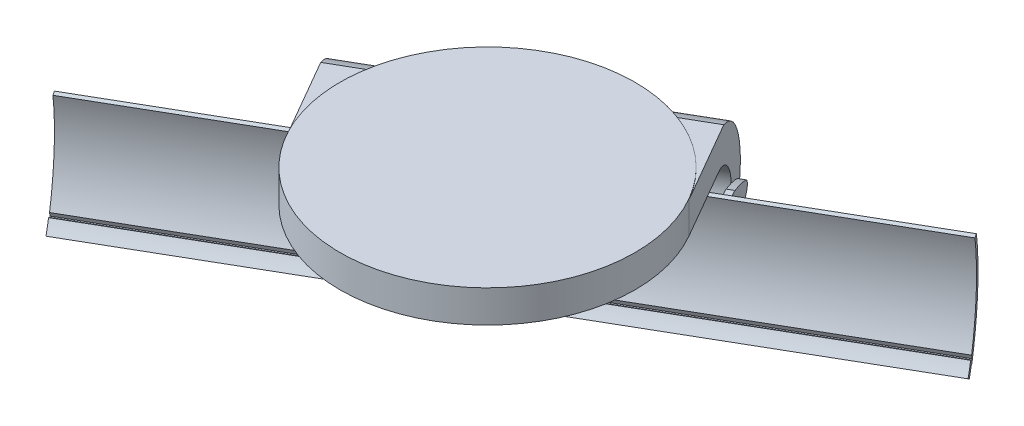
ISO-10303-21;
HEADER;
FILE_DESCRIPTION(('STEP AP214'),'2;1');
FILE_NAME('part.step','',(''),(''),'','','');
FILE_SCHEMA(('AUTOMOTIVE_DESIGN { 1 0 10303 214 1 1 1 1 }'));
ENDSEC;
DATA;
#1=APPLICATION_CONTEXT('core data for automotive mechanical design processes');
#2=APPLICATION_PROTOCOL_DEFINITION('international standard','automotive_design',2000,#1);
#3=PRODUCT_CONTEXT('',#1,'mechanical');
#4=PRODUCT('Part','Part','',(#3));
#5=PRODUCT_RELATED_PRODUCT_CATEGORY('part','',(#4));
#6=PRODUCT_DEFINITION_FORMATION('','',#4);
#7=PRODUCT_DEFINITION_CONTEXT('part definition',#1,'design');
#8=PRODUCT_DEFINITION('design','',#6,#7);
#9=PRODUCT_DEFINITION_SHAPE('','',#8);
#10=(LENGTH_UNIT() NAMED_UNIT(*) SI_UNIT(.MILLI.,.METRE.));
#11=(NAMED_UNIT(*) PLANE_ANGLE_UNIT() SI_UNIT($,.RADIAN.));
#12=(NAMED_UNIT(*) SI_UNIT($,.STERADIAN.) SOLID_ANGLE_UNIT());
#13=UNCERTAINTY_MEASURE_WITH_UNIT(LENGTH_MEASURE(1.E-05),#10,'distance_accuracy_value','');
#14=(GEOMETRIC_REPRESENTATION_CONTEXT(3) GLOBAL_UNCERTAINTY_ASSIGNED_CONTEXT((#13)) GLOBAL_UNIT_ASSIGNED_CONTEXT((#10,
#11,#12)) REPRESENTATION_CONTEXT('',''));
#15=CARTESIAN_POINT('',(0.,0.,0.));
#16=DIRECTION('',(0.,0.,1.));
#17=DIRECTION('',(1.,0.,0.));
#18=AXIS2_PLACEMENT_3D('',#15,#16,#17);
#19=CARTESIAN_POINT('',(-1779.51253650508,331.706184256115,3577.79387406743));
#20=DIRECTION('',(0.866025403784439,0.,-0.5));
#21=DIRECTION('',(-0.5,0.,-0.866025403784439));
#22=AXIS2_PLACEMENT_3D('',#19,#20,#21);
#23=PLANE('',#22);
#24=CARTESIAN_POINT('',(-1398.93758127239,457.007356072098,4236.9690326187));
#25=DIRECTION('',(0.866025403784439,0.,-0.5));
#26=DIRECTION('',(-0.5,0.,-0.866025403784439));
#27=AXIS2_PLACEMENT_3D('',#24,#25,#26);
#28=CIRCLE('',#27,808.176988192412);
#29=CARTESIAN_POINT('',(-1757.55185263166,84.538214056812,3615.83089430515));
#30=VERTEX_POINT('',#29);
#31=CARTESIAN_POINT('',(-1791.40667523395,649.418596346,3557.19262147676));
#32=VERTEX_POINT('',#31);
#33=EDGE_CURVE('E10',#30,#32,#28,.T.);
#34=ORIENTED_EDGE('',*,*,#33,.F.);
#35=DIRECTION('',(0.424770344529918,0.527523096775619,0.735723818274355));
#36=VECTOR('',#35,1.);
#37=CARTESIAN_POINT('',(-1757.55185263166,84.5382140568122,3615.83089430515));
#38=LINE('',#37,#36);
#39=CARTESIAN_POINT('',(-1754.35494024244,88.5084656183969,3621.36810899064));
#40=VERTEX_POINT('',#39);
#41=EDGE_CURVE('E1030',#30,#40,#38,.T.);
#42=ORIENTED_EDGE('',*,*,#41,.T.);
#43=CARTESIAN_POINT('',(-1522.33068088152,354.999999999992,4023.24591479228));
#44=DIRECTION('',(0.866025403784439,0.,-0.5));
#45=DIRECTION('',(-0.5,0.,-0.866025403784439));
#46=AXIS2_PLACEMENT_3D('',#43,#44,#45);
#47=CIRCLE('',#46,535.124999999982);
#48=CARTESIAN_POINT('',(-1738.41350255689,39.4185963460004,3648.9794890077));
#49=VERTEX_POINT('',#48);
#50=EDGE_CURVE('E1042',#49,#40,#47,.T.);
#51=ORIENTED_EDGE('',*,*,#50,.F.);
#52=DIRECTION('',(0.403798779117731,0.589733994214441,0.699400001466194));
#53=VECTOR('',#52,1.);
#54=CARTESIAN_POINT('',(-1738.41350255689,39.4185963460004,3648.9794890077));
#55=LINE('',#54,#53);
#56=CARTESIAN_POINT('',(-1729.52992941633,52.3927442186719,3664.3662890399));
#57=VERTEX_POINT('',#56);
#58=EDGE_CURVE('E776',#49,#57,#55,.T.);
#59=ORIENTED_EDGE('',*,*,#58,.T.);
#60=CARTESIAN_POINT('',(-1522.33068088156,354.999999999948,4023.24591479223));
#61=DIRECTION('',(0.866025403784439,0.,-0.5));
#62=DIRECTION('',(-0.5,0.,-0.866025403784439));
#63=AXIS2_PLACEMENT_3D('',#60,#61,#62);
#64=CIRCLE('',#63,513.124999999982);
#65=CARTESIAN_POINT('',(-1748.67634731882,113.405664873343,3631.20372044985));
#66=VERTEX_POINT('',#65);
#67=EDGE_CURVE('E1054',#57,#66,#64,.T.);
#68=ORIENTED_EDGE('',*,*,#67,.T.);
#69=DIRECTION('',(0.424770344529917,0.527523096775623,0.735723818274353));
#70=VECTOR('',#69,1.);
#71=CARTESIAN_POINT('',(-1757.89753691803,101.953852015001,3615.2321515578));
#72=LINE('',#71,#70);
#73=CARTESIAN_POINT('',(-1757.89753691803,101.953852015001,3615.2321515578));
#74=VERTEX_POINT('',#73);
#75=EDGE_CURVE('E1063',#74,#66,#72,.T.);
#76=ORIENTED_EDGE('',*,*,#75,.F.);
#77=DIRECTION('',(0.263761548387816,-0.849540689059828,0.456848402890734));
#78=VECTOR('',#77,1.);
#79=CARTESIAN_POINT('',(-1759.21233830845,106.188651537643,3612.95484874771));
#80=LINE('',#79,#78);
#81=CARTESIAN_POINT('',(-1759.21233830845,106.188651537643,3612.95484874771));
#82=VERTEX_POINT('',#81);
#83=EDGE_CURVE('E1071',#82,#74,#80,.T.);
#84=ORIENTED_EDGE('',*,*,#83,.F.);
#85=DIRECTION('',(0.150372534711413,0.9537045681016,0.260452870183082));
#86=VECTOR('',#85,1.);
#87=CARTESIAN_POINT('',(-1759.21233830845,106.188651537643,3612.95484874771));
#88=LINE('',#87,#86);
#89=CARTESIAN_POINT('',(-1755.84462407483,127.547634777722,3618.78790090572));
#90=VERTEX_POINT('',#89);
#91=EDGE_CURVE('E1079',#82,#90,#88,.T.);
#92=ORIENTED_EDGE('',*,*,#91,.T.);
#93=CARTESIAN_POINT('',(-1398.93758127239,457.007356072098,4236.9690326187));
#94=DIRECTION('',(0.866025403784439,0.,-0.5));
#95=DIRECTION('',(-0.5,0.,-0.866025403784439));
#96=AXIS2_PLACEMENT_3D('',#93,#94,#95);
#97=CIRCLE('',#96,786.176988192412);
#98=CARTESIAN_POINT('',(-1780.72297575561,644.180823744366,3575.69733178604));
#99=VERTEX_POINT('',#98);
#100=EDGE_CURVE('E1088',#90,#99,#97,.T.);
#101=ORIENTED_EDGE('',*,*,#100,.T.);
#102=DIRECTION('',(-0.485622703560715,0.238080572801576,-0.841123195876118));
#103=VECTOR('',#102,1.);
#104=CARTESIAN_POINT('',(-1780.72297575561,644.180823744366,3575.69733178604));
#105=LINE('',#104,#103);
#106=EDGE_CURVE('E1096',#99,#32,#105,.T.);
#107=ORIENTED_EDGE('',*,*,#106,.T.);
#108=EDGE_LOOP('',(#34,#42,#51,#59,#68,#76,#84,#92,#101,#107));
#109=FACE_BOUND('',#108,.T.);
#110=ADVANCED_FACE('F15',(#109),#23,.F.);
#111=CARTESIAN_POINT('',(1390.14044134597,331.706184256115,1747.79387406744));
#112=DIRECTION('',(0.866025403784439,0.,-0.5));
#113=DIRECTION('',(-0.5,0.,-0.866025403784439));
#114=AXIS2_PLACEMENT_3D('',#111,#112,#113);
#115=PLANE('',#114);
#116=DIRECTION('',(0.424770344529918,0.527523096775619,0.735723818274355));
#117=VECTOR('',#116,1.);
#118=CARTESIAN_POINT('',(1412.10112521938,84.5382140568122,1785.83089430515));
#119=LINE('',#118,#117);
#120=CARTESIAN_POINT('',(1412.10112521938,84.538214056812,1785.83089430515));
#121=VERTEX_POINT('',#120);
#122=CARTESIAN_POINT('',(1415.29803760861,88.5084656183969,1791.36810899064));
#123=VERTEX_POINT('',#122);
#124=EDGE_CURVE('E1024',#121,#123,#119,.T.);
#125=ORIENTED_EDGE('',*,*,#124,.F.);
#126=CARTESIAN_POINT('',(1770.71539657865,457.007356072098,2406.9690326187));
#127=DIRECTION('',(-0.866025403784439,0.,0.5));
#128=DIRECTION('',(-0.5,0.,-0.866025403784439));
#129=AXIS2_PLACEMENT_3D('',#126,#127,#128);
#130=CIRCLE('',#129,808.176988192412);
#131=CARTESIAN_POINT('',(1378.2463026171,649.418596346,1727.19262147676));
#132=VERTEX_POINT('',#131);
#133=EDGE_CURVE('E26',#132,#121,#130,.T.);
#134=ORIENTED_EDGE('',*,*,#133,.F.);
#135=DIRECTION('',(-0.485622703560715,0.238080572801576,-0.841123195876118));
#136=VECTOR('',#135,1.);
#137=CARTESIAN_POINT('',(1388.93000209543,644.180823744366,1745.69733178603));
#138=LINE('',#137,#136);
#139=CARTESIAN_POINT('',(1388.93000209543,644.180823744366,1745.69733178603));
#140=VERTEX_POINT('',#139);
#141=EDGE_CURVE('E1091',#140,#132,#138,.T.);
#142=ORIENTED_EDGE('',*,*,#141,.F.);
#143=CARTESIAN_POINT('',(1770.71539657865,457.007356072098,2406.9690326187));
#144=DIRECTION('',(0.866025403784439,0.,-0.5));
#145=DIRECTION('',(-0.5,0.,-0.866025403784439));
#146=AXIS2_PLACEMENT_3D('',#143,#144,#145);
#147=CIRCLE('',#146,786.176988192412);
#148=CARTESIAN_POINT('',(1413.80835377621,127.547634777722,1788.78790090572));
#149=VERTEX_POINT('',#148);
#150=EDGE_CURVE('E1082',#149,#140,#147,.T.);
#151=ORIENTED_EDGE('',*,*,#150,.F.);
#152=DIRECTION('',(0.150372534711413,0.9537045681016,0.260452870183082));
#153=VECTOR('',#152,1.);
#154=CARTESIAN_POINT('',(1410.44063954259,106.188651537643,1782.95484874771));
#155=LINE('',#154,#153);
#156=CARTESIAN_POINT('',(1410.44063954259,106.188651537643,1782.95484874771));
#157=VERTEX_POINT('',#156);
#158=EDGE_CURVE('E1073',#157,#149,#155,.T.);
#159=ORIENTED_EDGE('',*,*,#158,.F.);
#160=DIRECTION('',(-0.263761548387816,0.849540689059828,-0.456848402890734));
#161=VECTOR('',#160,1.);
#162=CARTESIAN_POINT('',(1410.44063954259,106.188651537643,1782.95484874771));
#163=LINE('',#162,#161);
#164=CARTESIAN_POINT('',(1411.75544093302,101.953852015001,1785.23215155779));
#165=VERTEX_POINT('',#164);
#166=EDGE_CURVE('E1065',#165,#157,#163,.T.);
#167=ORIENTED_EDGE('',*,*,#166,.F.);
#168=DIRECTION('',(-0.424770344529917,-0.527523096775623,-0.735723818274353));
#169=VECTOR('',#168,1.);
#170=CARTESIAN_POINT('',(1411.75544093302,101.953852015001,1785.23215155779));
#171=LINE('',#170,#169);
#172=CARTESIAN_POINT('',(1420.97663053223,113.405664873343,1801.20372044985));
#173=VERTEX_POINT('',#172);
#174=EDGE_CURVE('E1057',#173,#165,#171,.T.);
#175=ORIENTED_EDGE('',*,*,#174,.F.);
#176=CARTESIAN_POINT('',(1647.32229696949,354.999999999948,2193.24591479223));
#177=DIRECTION('',(0.866025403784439,0.,-0.5));
#178=DIRECTION('',(-0.5,0.,-0.866025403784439));
#179=AXIS2_PLACEMENT_3D('',#176,#177,#178);
#180=CIRCLE('',#179,513.124999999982);
#181=CARTESIAN_POINT('',(1440.12304843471,52.3927442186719,1834.3662890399));
#182=VERTEX_POINT('',#181);
#183=EDGE_CURVE('E1048',#182,#173,#180,.T.);
#184=ORIENTED_EDGE('',*,*,#183,.F.);
#185=DIRECTION('',(0.403798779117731,0.589733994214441,0.699400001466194));
#186=VECTOR('',#185,1.);
#187=CARTESIAN_POINT('',(1431.23947529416,39.4185963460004,1818.9794890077));
#188=LINE('',#187,#186);
#189=CARTESIAN_POINT('',(1431.23947529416,39.4185963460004,1818.9794890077));
#190=VERTEX_POINT('',#189);
#191=EDGE_CURVE('E777',#190,#182,#188,.T.);
#192=ORIENTED_EDGE('',*,*,#191,.F.);
#193=CARTESIAN_POINT('',(1647.32229696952,354.999999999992,2193.24591479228));
#194=DIRECTION('',(-0.866025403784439,0.,0.5));
#195=DIRECTION('',(-0.5,0.,-0.866025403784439));
#196=AXIS2_PLACEMENT_3D('',#193,#194,#195);
#197=CIRCLE('',#196,535.124999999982);
#198=EDGE_CURVE('E1036',#123,#190,#197,.T.);
#199=ORIENTED_EDGE('',*,*,#198,.F.);
#200=EDGE_LOOP('',(#125,#134,#142,#151,#159,#167,#175,#184,#192,#199));
#201=FACE_BOUND('',#200,.T.);
#202=ADVANCED_FACE('F17',(#201),#115,.T.);
#203=CARTESIAN_POINT('',(-1398.93758127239,457.007356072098,4236.9690326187));
#204=DIRECTION('',(-0.866025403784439,0.,0.5));
#205=DIRECTION('',(-0.5,0.,-0.866025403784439));
#206=AXIS2_PLACEMENT_3D('',#203,#204,#205);
#207=CYLINDRICAL_SURFACE('',#206,808.176988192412);
#208=ORIENTED_EDGE('',*,*,#133,.T.);
#209=DIRECTION('',(0.866025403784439,0.,-0.5));
#210=VECTOR('',#209,1.);
#211=CARTESIAN_POINT('',(-1757.55185263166,84.538214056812,3615.83089430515));
#212=LINE('',#211,#210);
#213=EDGE_CURVE('E1033',#30,#121,#212,.T.);
#214=ORIENTED_EDGE('',*,*,#213,.F.);
#215=ORIENTED_EDGE('',*,*,#33,.T.);
#216=DIRECTION('',(0.866025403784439,0.,-0.5));
#217=VECTOR('',#216,1.);
#218=CARTESIAN_POINT('',(-1791.40667523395,649.418596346,3557.19262147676));
#219=LINE('',#218,#217);
#220=EDGE_CURVE('E1094',#32,#132,#219,.T.);
#221=ORIENTED_EDGE('',*,*,#220,.T.);
#222=EDGE_LOOP('',(#208,#214,#215,#221));
#223=FACE_BOUND('',#222,.T.);
#224=DIRECTION('',(-0.866025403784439,0.,0.5));
#225=VECTOR('',#224,1.);
#226=CARTESIAN_POINT('',(-213.495969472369,579.958256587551,2630.21413366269));
#227=LINE('',#226,#225);
#228=CARTESIAN_POINT('',(1085.54213620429,579.958256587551,1880.21413366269));
#229=VERTEX_POINT('',#228);
#230=CARTESIAN_POINT('',(-1512.53407514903,579.958256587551,3380.21413366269));
#231=VERTEX_POINT('',#230);
#232=EDGE_CURVE('E975',#229,#231,#227,.T.);
#233=ORIENTED_EDGE('',*,*,#232,.T.);
#234=CARTESIAN_POINT('',(-1113.14919802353,457.007356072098,4071.9690326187));
#235=DIRECTION('',(-0.866025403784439,0.,0.5));
#236=DIRECTION('',(-0.5,0.,-0.866025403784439));
#237=AXIS2_PLACEMENT_3D('',#234,#235,#236);
#238=CIRCLE('',#237,808.176988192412);
#239=CARTESIAN_POINT('',(-1506.26580878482,269.958256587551,3391.07108948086));
#240=VERTEX_POINT('',#239);
#241=EDGE_CURVE('E877',#231,#240,#238,.T.);
#242=ORIENTED_EDGE('',*,*,#241,.T.);
#243=DIRECTION('',(0.866025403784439,0.,-0.5));
#244=VECTOR('',#243,1.);
#245=CARTESIAN_POINT('',(-207.227703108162,269.958256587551,2641.07108948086));
#246=LINE('',#245,#244);
#247=CARTESIAN_POINT('',(1091.8104025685,269.958256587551,1891.07108948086));
#248=VERTEX_POINT('',#247);
#249=EDGE_CURVE('E998',#240,#248,#246,.T.);
#250=ORIENTED_EDGE('',*,*,#249,.T.);
#251=CARTESIAN_POINT('',(1484.92701332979,457.007356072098,2571.9690326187));
#252=DIRECTION('',(0.866025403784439,0.,-0.5));
#253=DIRECTION('',(-0.5,0.,-0.866025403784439));
#254=AXIS2_PLACEMENT_3D('',#251,#252,#253);
#255=CIRCLE('',#254,808.176988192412);
#256=EDGE_CURVE('E1022',#248,#229,#255,.T.);
#257=ORIENTED_EDGE('',*,*,#256,.T.);
#258=EDGE_LOOP('',(#233,#242,#250,#257));
#259=FACE_BOUND('',#258,.T.);
#260=ADVANCED_FACE('F1278',(#223,#259),#207,.T.);
#261=CARTESIAN_POINT('',(-1786.06482549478,646.799710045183,3566.4449766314));
#262=DIRECTION('',(0.119040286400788,0.971245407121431,0.206183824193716));
#263=DIRECTION('',(0.485622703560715,-0.238080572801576,0.841123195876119));
#264=AXIS2_PLACEMENT_3D('',#261,#262,#263);
#265=PLANE('',#264);
#266=ORIENTED_EDGE('',*,*,#141,.T.);
#267=ORIENTED_EDGE('',*,*,#220,.F.);
#268=ORIENTED_EDGE('',*,*,#106,.F.);
#269=DIRECTION('',(0.866025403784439,0.,-0.5));
#270=VECTOR('',#269,1.);
#271=CARTESIAN_POINT('',(-1780.72297575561,644.180823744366,3575.69733178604));
#272=LINE('',#271,#270);
#273=EDGE_CURVE('E1085',#99,#140,#272,.T.);
#274=ORIENTED_EDGE('',*,*,#273,.T.);
#275=EDGE_LOOP('',(#266,#267,#268,#274));
#276=FACE_BOUND('',#275,.T.);
#277=ADVANCED_FACE('F1179',(#276),#265,.T.);
#278=CARTESIAN_POINT('',(-1398.93758127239,457.007356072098,4236.9690326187));
#279=DIRECTION('',(-0.866025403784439,0.,0.5));
#280=DIRECTION('',(-0.5,0.,-0.866025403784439));
#281=AXIS2_PLACEMENT_3D('',#278,#279,#280);
#282=CYLINDRICAL_SURFACE('',#281,786.176988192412);
#283=ORIENTED_EDGE('',*,*,#150,.T.);
#284=ORIENTED_EDGE('',*,*,#273,.F.);
#285=ORIENTED_EDGE('',*,*,#100,.F.);
#286=DIRECTION('',(0.866025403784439,0.,-0.5));
#287=VECTOR('',#286,1.);
#288=CARTESIAN_POINT('',(-1755.84462407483,127.547634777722,3618.78790090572));
#289=LINE('',#288,#287);
#290=EDGE_CURVE('E1076',#90,#149,#289,.T.);
#291=ORIENTED_EDGE('',*,*,#290,.T.);
#292=EDGE_LOOP('',(#283,#284,#285,#291));
#293=FACE_BOUND('',#292,.T.);
#294=ADVANCED_FACE('F1265',(#293),#282,.F.);
#295=CARTESIAN_POINT('',(-1757.52848119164,116.868143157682,3615.87137482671));
#296=DIRECTION('',(0.4768522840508,-0.300745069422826,0.825932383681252));
#297=DIRECTION('',(-0.150372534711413,-0.9537045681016,-0.260452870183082));
#298=AXIS2_PLACEMENT_3D('',#295,#296,#297);
#299=PLANE('',#298);
#300=ORIENTED_EDGE('',*,*,#158,.T.);
#301=ORIENTED_EDGE('',*,*,#290,.F.);
#302=ORIENTED_EDGE('',*,*,#91,.F.);
#303=DIRECTION('',(0.866025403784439,0.,-0.5));
#304=VECTOR('',#303,1.);
#305=CARTESIAN_POINT('',(-1759.21233830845,106.188651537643,3612.95484874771));
#306=LINE('',#305,#304);
#307=EDGE_CURVE('E1068',#82,#157,#306,.T.);
#308=ORIENTED_EDGE('',*,*,#307,.T.);
#309=EDGE_LOOP('',(#300,#301,#302,#308));
#310=FACE_BOUND('',#309,.T.);
#311=ADVANCED_FACE('F1262',(#310),#299,.T.);
#312=CARTESIAN_POINT('',(-1758.55493761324,104.071251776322,3614.09350015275));
#313=DIRECTION('',(0.424770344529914,0.527523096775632,0.735723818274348));
#314=DIRECTION('',(0.263761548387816,-0.849540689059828,0.456848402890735));
#315=AXIS2_PLACEMENT_3D('',#312,#313,#314);
#316=PLANE('',#315);
#317=ORIENTED_EDGE('',*,*,#166,.T.);
#318=ORIENTED_EDGE('',*,*,#307,.F.);
#319=ORIENTED_EDGE('',*,*,#83,.T.);
#320=DIRECTION('',(0.866025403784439,0.,-0.5));
#321=VECTOR('',#320,1.);
#322=CARTESIAN_POINT('',(-1757.89753691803,101.953852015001,3615.2321515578));
#323=LINE('',#322,#321);
#324=EDGE_CURVE('E1060',#74,#165,#323,.T.);
#325=ORIENTED_EDGE('',*,*,#324,.T.);
#326=EDGE_LOOP('',(#317,#318,#319,#325));
#327=FACE_BOUND('',#326,.T.);
#328=ADVANCED_FACE('F1259',(#327),#316,.T.);
#329=CARTESIAN_POINT('',(-1753.28694211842,107.679758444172,3623.21793600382));
#330=DIRECTION('',(-0.263761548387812,0.849540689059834,-0.456848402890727));
#331=DIRECTION('',(0.424770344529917,0.527523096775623,0.735723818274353));
#332=AXIS2_PLACEMENT_3D('',#329,#330,#331);
#333=PLANE('',#332);
#334=ORIENTED_EDGE('',*,*,#174,.T.);
#335=ORIENTED_EDGE('',*,*,#324,.F.);
#336=ORIENTED_EDGE('',*,*,#75,.T.);
#337=DIRECTION('',(0.866025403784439,0.,-0.5));
#338=VECTOR('',#337,1.);
#339=CARTESIAN_POINT('',(-1748.67634731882,113.405664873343,3631.20372044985));
#340=LINE('',#339,#338);
#341=EDGE_CURVE('E1051',#66,#173,#340,.T.);
#342=ORIENTED_EDGE('',*,*,#341,.T.);
#343=EDGE_LOOP('',(#334,#335,#336,#342));
#344=FACE_BOUND('',#343,.T.);
#345=ADVANCED_FACE('F1255',(#344),#333,.T.);
#346=CARTESIAN_POINT('',(-1522.33068088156,354.999999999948,4023.24591479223));
#347=DIRECTION('',(-0.866025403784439,0.,0.5));
#348=DIRECTION('',(-0.5,0.,-0.866025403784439));
#349=AXIS2_PLACEMENT_3D('',#346,#347,#348);
#350=CYLINDRICAL_SURFACE('',#349,513.124999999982);
#351=ORIENTED_EDGE('',*,*,#183,.T.);
#352=ORIENTED_EDGE('',*,*,#341,.F.);
#353=ORIENTED_EDGE('',*,*,#67,.F.);
#354=DIRECTION('',(0.866025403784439,0.,-0.5));
#355=VECTOR('',#354,1.);
#356=CARTESIAN_POINT('',(-1729.52992941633,52.3927442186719,3664.3662890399));
#357=LINE('',#356,#355);
#358=EDGE_CURVE('E773',#57,#182,#357,.T.);
#359=ORIENTED_EDGE('',*,*,#358,.T.);
#360=EDGE_LOOP('',(#351,#352,#353,#359));
#361=FACE_BOUND('',#360,.T.);
#362=ADVANCED_FACE('F1251',(#361),#350,.F.);
#363=CARTESIAN_POINT('',(-1733.97171598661,45.9056702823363,3656.6728890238));
#364=DIRECTION('',(0.294866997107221,-0.807597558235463,0.510724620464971));
#365=DIRECTION('',(-0.403798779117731,-0.589733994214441,-0.699400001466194));
#366=AXIS2_PLACEMENT_3D('',#363,#364,#365);
#367=PLANE('',#366);
#368=ORIENTED_EDGE('',*,*,#191,.T.);
#369=ORIENTED_EDGE('',*,*,#358,.F.);
#370=ORIENTED_EDGE('',*,*,#58,.F.);
#371=DIRECTION('',(0.866025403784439,0.,-0.5));
#372=VECTOR('',#371,1.);
#373=CARTESIAN_POINT('',(-1738.41350255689,39.4185963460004,3648.9794890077));
#374=LINE('',#373,#372);
#375=EDGE_CURVE('E1039',#49,#190,#374,.T.);
#376=ORIENTED_EDGE('',*,*,#375,.T.);
#377=EDGE_LOOP('',(#368,#369,#370,#376));
#378=FACE_BOUND('',#377,.T.);
#379=ADVANCED_FACE('F1247',(#378),#367,.T.);
#380=CARTESIAN_POINT('',(-1522.33068088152,354.999999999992,4023.24591479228));
#381=DIRECTION('',(-0.866025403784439,0.,0.5));
#382=DIRECTION('',(-0.5,0.,-0.866025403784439));
#383=AXIS2_PLACEMENT_3D('',#380,#381,#382);
#384=CYLINDRICAL_SURFACE('',#383,535.124999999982);
#385=ORIENTED_EDGE('',*,*,#198,.T.);
#386=ORIENTED_EDGE('',*,*,#375,.F.);
#387=ORIENTED_EDGE('',*,*,#50,.T.);
#388=DIRECTION('',(0.866025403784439,0.,-0.5));
#389=VECTOR('',#388,1.);
#390=CARTESIAN_POINT('',(-1754.35494024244,88.5084656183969,3621.36810899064));
#391=LINE('',#390,#389);
#392=EDGE_CURVE('E1027',#40,#123,#391,.T.);
#393=ORIENTED_EDGE('',*,*,#392,.T.);
#394=EDGE_LOOP('',(#385,#386,#387,#393));
#395=FACE_BOUND('',#394,.T.);
#396=ADVANCED_FACE('F1243',(#395),#384,.T.);
#397=CARTESIAN_POINT('',(-1755.95339643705,86.5233398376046,3618.5995016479));
#398=DIRECTION('',(0.26376154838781,-0.849540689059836,0.456848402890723));
#399=DIRECTION('',(-0.424770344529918,-0.527523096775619,-0.735723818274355));
#400=AXIS2_PLACEMENT_3D('',#397,#398,#399);
#401=PLANE('',#400);
#402=ORIENTED_EDGE('',*,*,#124,.T.);
#403=ORIENTED_EDGE('',*,*,#392,.F.);
#404=ORIENTED_EDGE('',*,*,#41,.F.);
#405=ORIENTED_EDGE('',*,*,#213,.T.);
#406=EDGE_LOOP('',(#402,#403,#404,#405));
#407=FACE_BOUND('',#406,.T.);
#408=ADVANCED_FACE('F1246',(#407),#401,.T.);
#409=CARTESIAN_POINT('',(1070.42009800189,422.26658549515,1854.02199518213));
#410=DIRECTION('',(0.866025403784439,0.,-0.5));
#411=DIRECTION('',(-0.5,0.,-0.866025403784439));
#412=AXIS2_PLACEMENT_3D('',#409,#410,#411);
#413=PLANE('',#412);
#414=ORIENTED_EDGE('',*,*,#256,.F.);
#415=DIRECTION('',(0.5,0.,0.866025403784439));
#416=VECTOR('',#415,1.);
#417=CARTESIAN_POINT('',(1092.83838474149,269.958256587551,1892.85160683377));
#418=LINE('',#417,#416);
#419=CARTESIAN_POINT('',(1090.11475280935,269.958256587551,1888.13413794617));
#420=VERTEX_POINT('',#419);
#421=EDGE_CURVE('E1001',#420,#248,#418,.T.);
#422=ORIENTED_EDGE('',*,*,#421,.F.);
#423=CARTESIAN_POINT('',(1016.53227073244,230.891267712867,1760.68554044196));
#424=DIRECTION('',(0.866025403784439,0.,-0.5));
#425=DIRECTION('',(-0.5,0.,-0.866025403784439));
#426=AXIS2_PLACEMENT_3D('',#423,#424,#425);
#427=CIRCLE('',#426,152.262130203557);
#428=CARTESIAN_POINT('',(1063.22096207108,351.159387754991,1841.55272597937));
#429=VERTEX_POINT('',#428);
#430=EDGE_CURVE('E992',#429,#420,#427,.T.);
#431=ORIENTED_EDGE('',*,*,#430,.F.);
#432=DIRECTION('',(0.5,0.,0.866025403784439));
#433=VECTOR('',#432,1.);
#434=CARTESIAN_POINT('',(1063.22096207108,351.159387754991,1841.55272597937));
#435=LINE('',#434,#433);
#436=CARTESIAN_POINT('',(1060.72096207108,351.159387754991,1837.22259896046));
#437=VERTEX_POINT('',#436);
#438=EDGE_CURVE('E983',#437,#429,#435,.T.);
#439=ORIENTED_EDGE('',*,*,#438,.F.);
#440=DIRECTION('',(0.,1.,0.));
#441=VECTOR('',#440,1.);
#442=CARTESIAN_POINT('',(1060.72096207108,351.159387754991,1837.22259896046));
#443=LINE('',#442,#441);
#444=CARTESIAN_POINT('',(1060.72096207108,292.958256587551,1837.22259896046));
#445=VERTEX_POINT('',#444);
#446=EDGE_CURVE('E1020',#445,#437,#443,.T.);
#447=ORIENTED_EDGE('',*,*,#446,.F.);
#448=DIRECTION('',(0.5,0.,0.866025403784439));
#449=VECTOR('',#448,1.);
#450=CARTESIAN_POINT('',(1060.72096207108,292.958256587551,1837.22259896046));
#451=LINE('',#450,#449);
#452=CARTESIAN_POINT('',(1052.61475280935,292.958256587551,1823.18223266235));
#453=VERTEX_POINT('',#452);
#454=EDGE_CURVE('E933',#453,#445,#451,.T.);
#455=ORIENTED_EDGE('',*,*,#454,.F.);
#456=DIRECTION('',(0.,-1.,0.));
#457=VECTOR('',#456,1.);
#458=CARTESIAN_POINT('',(1052.61475280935,292.958256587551,1823.18223266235));
#459=LINE('',#458,#457);
#460=CARTESIAN_POINT('',(1052.61475280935,551.958256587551,1823.18223266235));
#461=VERTEX_POINT('',#460);
#462=EDGE_CURVE('E1018',#461,#453,#459,.T.);
#463=ORIENTED_EDGE('',*,*,#462,.F.);
#464=DIRECTION('',(-0.5,0.,-0.866025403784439));
#465=VECTOR('',#464,1.);
#466=CARTESIAN_POINT('',(1057.61475280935,551.958256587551,1831.84248670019));
#467=LINE('',#466,#465);
#468=CARTESIAN_POINT('',(1057.61475280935,551.958256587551,1831.84248670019));
#469=VERTEX_POINT('',#468);
#470=EDGE_CURVE('E946',#469,#461,#467,.T.);
#471=ORIENTED_EDGE('',*,*,#470,.F.);
#472=DIRECTION('',(0.,1.,0.));
#473=VECTOR('',#472,1.);
#474=CARTESIAN_POINT('',(1057.61475280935,504.958256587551,1831.84248670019));
#475=LINE('',#474,#473);
#476=CARTESIAN_POINT('',(1057.61475280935,504.958256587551,1831.84248670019));
#477=VERTEX_POINT('',#476);
#478=EDGE_CURVE('E868',#477,#469,#475,.T.);
#479=ORIENTED_EDGE('',*,*,#478,.F.);
#480=DIRECTION('',(-0.5,0.,-0.866025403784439));
#481=VECTOR('',#480,1.);
#482=CARTESIAN_POINT('',(1073.92709609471,504.958256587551,1860.09629406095));
#483=LINE('',#482,#481);
#484=CARTESIAN_POINT('',(1073.92709609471,504.958256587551,1860.09629406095));
#485=VERTEX_POINT('',#484);
#486=EDGE_CURVE('E1016',#485,#477,#483,.T.);
#487=ORIENTED_EDGE('',*,*,#486,.F.);
#488=DIRECTION('',(-0.163764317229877,-0.944841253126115,-0.283648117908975));
#489=VECTOR('',#488,1.);
#490=CARTESIAN_POINT('',(1081.7267071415,549.958256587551,1873.60561667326));
#491=LINE('',#490,#489);
#492=CARTESIAN_POINT('',(1081.7267071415,549.958256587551,1873.60561667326));
#493=VERTEX_POINT('',#492);
#494=EDGE_CURVE('E1010',#493,#485,#491,.T.);
#495=ORIENTED_EDGE('',*,*,#494,.F.);
#496=DIRECTION('',(-0.0725696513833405,-0.989411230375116,-0.125694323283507));
#497=VECTOR('',#496,1.);
#498=CARTESIAN_POINT('',(1083.92709609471,579.958256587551,1877.41680213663));
#499=LINE('',#498,#497);
#500=CARTESIAN_POINT('',(1083.92709609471,579.958256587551,1877.41680213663));
#501=VERTEX_POINT('',#500);
#502=EDGE_CURVE('E1004',#501,#493,#499,.T.);
#503=ORIENTED_EDGE('',*,*,#502,.F.);
#504=DIRECTION('',(-0.5,0.,-0.866025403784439));
#505=VECTOR('',#504,1.);
#506=CARTESIAN_POINT('',(1083.92709609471,579.958256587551,1877.41680213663));
#507=LINE('',#506,#505);
#508=EDGE_CURVE('E977',#229,#501,#507,.T.);
#509=ORIENTED_EDGE('',*,*,#508,.F.);
#510=EDGE_LOOP('',(#414,#422,#431,#439,#447,#455,#463,#471,#479,#487,#495,#503,#509));
#511=FACE_BOUND('',#510,.T.);
#512=ADVANCED_FACE('F1369',(#511),#413,.T.);
#513=CARTESIAN_POINT('',(-1537.35524928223,322.058822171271,3337.22259896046));
#514=DIRECTION('',(0.5,0.,0.866025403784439));
#515=DIRECTION('',(0.,-1.,0.));
#516=AXIS2_PLACEMENT_3D('',#513,#514,#515);
#517=PLANE('',#516);
#518=DIRECTION('',(0.,-1.,0.));
#519=VECTOR('',#518,1.);
#520=CARTESIAN_POINT('',(-931.137466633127,376.312179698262,2987.22259896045));
#521=LINE('',#520,#519);
#522=CARTESIAN_POINT('',(-931.137466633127,294.958256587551,2987.22259896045));
#523=VERTEX_POINT('',#522);
#524=CARTESIAN_POINT('',(-931.137466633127,292.958256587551,2987.22259896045));
#525=VERTEX_POINT('',#524);
#526=EDGE_CURVE('E727',#523,#525,#521,.T.);
#527=ORIENTED_EDGE('',*,*,#526,.T.);
#528=DIRECTION('',(0.866025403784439,0.,-0.5));
#529=VECTOR('',#528,1.);
#530=CARTESIAN_POINT('',(-1537.35524928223,292.958256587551,3337.22259896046));
#531=LINE('',#530,#529);
#532=CARTESIAN_POINT('',(454.503179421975,292.958256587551,2187.22259896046));
#533=VERTEX_POINT('',#532);
#534=EDGE_CURVE('E569',#525,#533,#531,.T.);
#535=ORIENTED_EDGE('',*,*,#534,.T.);
#536=DIRECTION('',(0.,1.,0.));
#537=VECTOR('',#536,1.);
#538=CARTESIAN_POINT('',(454.503179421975,376.312179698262,2187.22259896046));
#539=LINE('',#538,#537);
#540=CARTESIAN_POINT('',(454.503179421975,294.958256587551,2187.22259896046));
#541=VERTEX_POINT('',#540);
#542=EDGE_CURVE('E637',#533,#541,#539,.T.);
#543=ORIENTED_EDGE('',*,*,#542,.T.);
#544=DIRECTION('',(0.866025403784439,0.,-0.5));
#545=VECTOR('',#544,1.);
#546=CARTESIAN_POINT('',(-541.426034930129,294.958256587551,2762.22259896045));
#547=LINE('',#546,#545);
#548=CARTESIAN_POINT('',(484.814068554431,294.958256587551,2169.72259896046));
#549=VERTEX_POINT('',#548);
#550=EDGE_CURVE('E616',#541,#549,#547,.T.);
#551=ORIENTED_EDGE('',*,*,#550,.T.);
#552=DIRECTION('',(0.,-1.,0.));
#553=VECTOR('',#552,1.);
#554=CARTESIAN_POINT('',(484.814068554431,376.312179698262,2169.72259896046));
#555=LINE('',#554,#553);
#556=CARTESIAN_POINT('',(484.814068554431,292.958256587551,2169.72259896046));
#557=VERTEX_POINT('',#556);
#558=EDGE_CURVE('E649',#549,#557,#555,.T.);
#559=ORIENTED_EDGE('',*,*,#558,.T.);
#560=DIRECTION('',(0.866025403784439,0.,-0.5));
#561=VECTOR('',#560,1.);
#562=CARTESIAN_POINT('',(-1537.35524928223,292.958256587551,3337.22259896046));
#563=LINE('',#562,#561);
#564=EDGE_CURVE('E936',#557,#445,#563,.T.);
#565=ORIENTED_EDGE('',*,*,#564,.T.);
#566=ORIENTED_EDGE('',*,*,#446,.T.);
#567=DIRECTION('',(0.866025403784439,0.,-0.5));
#568=VECTOR('',#567,1.);
#569=CARTESIAN_POINT('',(-1537.35524928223,351.159387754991,3337.22259896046));
#570=LINE('',#569,#568);
#571=CARTESIAN_POINT('',(-1537.35524928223,351.159387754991,3337.22259896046));
#572=VERTEX_POINT('',#571);
#573=EDGE_CURVE('E989',#572,#437,#570,.T.);
#574=ORIENTED_EDGE('',*,*,#573,.F.);
#575=DIRECTION('',(0.,-1.,0.));
#576=VECTOR('',#575,1.);
#577=CARTESIAN_POINT('',(-1537.35524928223,351.159387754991,3337.22259896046));
#578=LINE('',#577,#576);
#579=CARTESIAN_POINT('',(-1537.35524928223,292.958256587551,3337.22259896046));
#580=VERTEX_POINT('',#579);
#581=EDGE_CURVE('E964',#572,#580,#578,.T.);
#582=ORIENTED_EDGE('',*,*,#581,.T.);
#583=DIRECTION('',(0.866025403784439,0.,-0.5));
#584=VECTOR('',#583,1.);
#585=CARTESIAN_POINT('',(-1537.35524928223,292.958256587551,3337.22259896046));
#586=LINE('',#585,#584);
#587=CARTESIAN_POINT('',(-961.448355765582,292.958256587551,3004.72259896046));
#588=VERTEX_POINT('',#587);
#589=EDGE_CURVE('E561',#580,#588,#586,.T.);
#590=ORIENTED_EDGE('',*,*,#589,.T.);
#591=DIRECTION('',(0.,1.,0.));
#592=VECTOR('',#591,1.);
#593=CARTESIAN_POINT('',(-961.448355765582,376.312179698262,3004.72259896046));
#594=LINE('',#593,#592);
#595=CARTESIAN_POINT('',(-961.448355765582,294.958256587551,3004.72259896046));
#596=VERTEX_POINT('',#595);
#597=EDGE_CURVE('E598',#588,#596,#594,.T.);
#598=ORIENTED_EDGE('',*,*,#597,.T.);
#599=DIRECTION('',(0.866025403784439,0.,-0.5));
#600=VECTOR('',#599,1.);
#601=CARTESIAN_POINT('',(-1249.40180252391,294.958256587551,3170.97259896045));
#602=LINE('',#601,#600);
#603=EDGE_CURVE('E2004',#596,#523,#602,.T.);
#604=ORIENTED_EDGE('',*,*,#603,.T.);
#605=EDGE_LOOP('',(#527,#535,#543,#551,#559,#565,#566,#574,#582,#590,#598,#604));
#606=FACE_BOUND('',#605,.T.);
#607=ADVANCED_FACE('F1219',(#606),#517,.T.);
#608=CARTESIAN_POINT('',(-1545.46145854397,422.458256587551,3323.18223266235));
#609=DIRECTION('',(-0.5,0.,-0.866025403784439));
#610=DIRECTION('',(0.,1.,0.));
#611=AXIS2_PLACEMENT_3D('',#608,#609,#610);
#612=PLANE('',#611);
#613=DIRECTION('',(0.,1.,0.));
#614=VECTOR('',#613,1.);
#615=CARTESIAN_POINT('',(-939.243675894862,426.511896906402,2973.18223266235));
#616=LINE('',#615,#614);
#617=CARTESIAN_POINT('',(-939.243675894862,519.958256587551,2973.18223266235));
#618=VERTEX_POINT('',#617);
#619=CARTESIAN_POINT('',(-939.243675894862,551.958256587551,2973.18223266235));
#620=VERTEX_POINT('',#619);
#621=EDGE_CURVE('E638',#618,#620,#616,.T.);
#622=ORIENTED_EDGE('',*,*,#621,.T.);
#623=DIRECTION('',(0.866025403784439,0.,-0.5));
#624=VECTOR('',#623,1.);
#625=CARTESIAN_POINT('',(-1545.46145854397,551.958256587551,3323.18223266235));
#626=LINE('',#625,#624);
#627=CARTESIAN_POINT('',(446.39697016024,551.958256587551,2173.18223266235));
#628=VERTEX_POINT('',#627);
#629=EDGE_CURVE('E957',#620,#628,#626,.T.);
#630=ORIENTED_EDGE('',*,*,#629,.T.);
#631=DIRECTION('',(0.,-1.,0.));
#632=VECTOR('',#631,1.);
#633=CARTESIAN_POINT('',(446.39697016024,426.511896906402,2173.18223266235));
#634=LINE('',#633,#632);
#635=CARTESIAN_POINT('',(446.39697016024,519.958256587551,2173.18223266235));
#636=VERTEX_POINT('',#635);
#637=EDGE_CURVE('E533',#628,#636,#634,.T.);
#638=ORIENTED_EDGE('',*,*,#637,.T.);
#639=DIRECTION('',(0.866025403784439,0.,-0.5));
#640=VECTOR('',#639,1.);
#641=CARTESIAN_POINT('',(-549.532244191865,519.958256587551,2748.18223266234));
#642=LINE('',#641,#640);
#643=CARTESIAN_POINT('',(476.707859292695,519.958256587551,2155.68223266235));
#644=VERTEX_POINT('',#643);
#645=EDGE_CURVE('E539',#636,#644,#642,.T.);
#646=ORIENTED_EDGE('',*,*,#645,.T.);
#647=DIRECTION('',(0.,1.,0.));
#648=VECTOR('',#647,1.);
#649=CARTESIAN_POINT('',(476.707859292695,426.511896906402,2155.68223266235));
#650=LINE('',#649,#648);
#651=CARTESIAN_POINT('',(476.707859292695,551.958256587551,2155.68223266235));
#652=VERTEX_POINT('',#651);
#653=EDGE_CURVE('E523',#644,#652,#650,.T.);
#654=ORIENTED_EDGE('',*,*,#653,.T.);
#655=DIRECTION('',(0.866025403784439,0.,-0.5));
#656=VECTOR('',#655,1.);
#657=CARTESIAN_POINT('',(-1545.46145854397,551.958256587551,3323.18223266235));
#658=LINE('',#657,#656);
#659=EDGE_CURVE('E949',#652,#461,#658,.T.);
#660=ORIENTED_EDGE('',*,*,#659,.T.);
#661=ORIENTED_EDGE('',*,*,#462,.T.);
#662=DIRECTION('',(0.866025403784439,0.,-0.5));
#663=VECTOR('',#662,1.);
#664=CARTESIAN_POINT('',(-1545.46145854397,292.958256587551,3323.18223266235));
#665=LINE('',#664,#663);
#666=CARTESIAN_POINT('',(476.707859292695,292.958256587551,2155.68223266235));
#667=VERTEX_POINT('',#666);
#668=EDGE_CURVE('E930',#667,#453,#665,.T.);
#669=ORIENTED_EDGE('',*,*,#668,.F.);
#670=DIRECTION('',(0.,1.,0.));
#671=VECTOR('',#670,1.);
#672=CARTESIAN_POINT('',(476.707859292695,426.511896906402,2155.68223266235));
#673=LINE('',#672,#671);
#674=CARTESIAN_POINT('',(476.707859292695,324.958256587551,2155.68223266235));
#675=VERTEX_POINT('',#674);
#676=EDGE_CURVE('E675',#667,#675,#673,.T.);
#677=ORIENTED_EDGE('',*,*,#676,.T.);
#678=DIRECTION('',(-0.866025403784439,0.,0.5));
#679=VECTOR('',#678,1.);
#680=CARTESIAN_POINT('',(-549.532244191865,324.958256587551,2748.18223266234));
#681=LINE('',#680,#679);
#682=CARTESIAN_POINT('',(446.39697016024,324.958256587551,2173.18223266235));
#683=VERTEX_POINT('',#682);
#684=EDGE_CURVE('E707',#675,#683,#681,.T.);
#685=ORIENTED_EDGE('',*,*,#684,.T.);
#686=DIRECTION('',(0.,-1.,0.));
#687=VECTOR('',#686,1.);
#688=CARTESIAN_POINT('',(446.39697016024,426.511896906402,2173.18223266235));
#689=LINE('',#688,#687);
#690=CARTESIAN_POINT('',(446.39697016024,292.958256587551,2173.18223266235));
#691=VERTEX_POINT('',#690);
#692=EDGE_CURVE('E646',#683,#691,#689,.T.);
#693=ORIENTED_EDGE('',*,*,#692,.T.);
#694=DIRECTION('',(0.866025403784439,0.,-0.5));
#695=VECTOR('',#694,1.);
#696=CARTESIAN_POINT('',(-1545.46145854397,292.958256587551,3323.18223266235));
#697=LINE('',#696,#695);
#698=CARTESIAN_POINT('',(-939.243675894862,292.958256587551,2973.18223266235));
#699=VERTEX_POINT('',#698);
#700=EDGE_CURVE('E547',#699,#691,#697,.T.);
#701=ORIENTED_EDGE('',*,*,#700,.F.);
#702=DIRECTION('',(0.,1.,0.));
#703=VECTOR('',#702,1.);
#704=CARTESIAN_POINT('',(-939.243675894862,426.511896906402,2973.18223266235));
#705=LINE('',#704,#703);
#706=CARTESIAN_POINT('',(-939.243675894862,324.958256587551,2973.18223266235));
#707=VERTEX_POINT('',#706);
#708=EDGE_CURVE('E752',#699,#707,#705,.T.);
#709=ORIENTED_EDGE('',*,*,#708,.T.);
#710=DIRECTION('',(-0.866025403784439,0.,0.5));
#711=VECTOR('',#710,1.);
#712=CARTESIAN_POINT('',(-1257.50801178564,324.958256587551,3156.93223266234));
#713=LINE('',#712,#711);
#714=CARTESIAN_POINT('',(-969.554565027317,324.958256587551,2990.68223266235));
#715=VERTEX_POINT('',#714);
#716=EDGE_CURVE('E788',#707,#715,#713,.T.);
#717=ORIENTED_EDGE('',*,*,#716,.T.);
#718=DIRECTION('',(0.,-1.,0.));
#719=VECTOR('',#718,1.);
#720=CARTESIAN_POINT('',(-969.554565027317,426.511896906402,2990.68223266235));
#721=LINE('',#720,#719);
#722=CARTESIAN_POINT('',(-969.554565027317,292.958256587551,2990.68223266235));
#723=VERTEX_POINT('',#722);
#724=EDGE_CURVE('E606',#715,#723,#721,.T.);
#725=ORIENTED_EDGE('',*,*,#724,.T.);
#726=DIRECTION('',(0.866025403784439,0.,-0.5));
#727=VECTOR('',#726,1.);
#728=CARTESIAN_POINT('',(-1545.46145854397,292.958256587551,3323.18223266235));
#729=LINE('',#728,#727);
#730=CARTESIAN_POINT('',(-1545.46145854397,292.958256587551,3323.18223266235));
#731=VERTEX_POINT('',#730);
#732=EDGE_CURVE('E545',#731,#723,#729,.T.);
#733=ORIENTED_EDGE('',*,*,#732,.F.);
#734=DIRECTION('',(0.,1.,0.));
#735=VECTOR('',#734,1.);
#736=CARTESIAN_POINT('',(-1545.46145854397,292.958256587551,3323.18223266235));
#737=LINE('',#736,#735);
#738=CARTESIAN_POINT('',(-1545.46145854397,551.958256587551,3323.18223266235));
#739=VERTEX_POINT('',#738);
#740=EDGE_CURVE('E962',#731,#739,#737,.T.);
#741=ORIENTED_EDGE('',*,*,#740,.T.);
#742=DIRECTION('',(0.866025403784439,0.,-0.5));
#743=VECTOR('',#742,1.);
#744=CARTESIAN_POINT('',(-1545.46145854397,551.958256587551,3323.18223266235));
#745=LINE('',#744,#743);
#746=CARTESIAN_POINT('',(-969.554565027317,551.958256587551,2990.68223266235));
#747=VERTEX_POINT('',#746);
#748=EDGE_CURVE('E952',#739,#747,#745,.T.);
#749=ORIENTED_EDGE('',*,*,#748,.T.);
#750=DIRECTION('',(0.,-1.,0.));
#751=VECTOR('',#750,1.);
#752=CARTESIAN_POINT('',(-969.554565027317,426.511896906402,2990.68223266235));
#753=LINE('',#752,#751);
#754=CARTESIAN_POINT('',(-969.554565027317,519.958256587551,2990.68223266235));
#755=VERTEX_POINT('',#754);
#756=EDGE_CURVE('E1989',#747,#755,#753,.T.);
#757=ORIENTED_EDGE('',*,*,#756,.T.);
#758=DIRECTION('',(0.866025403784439,0.,-0.5));
#759=VECTOR('',#758,1.);
#760=CARTESIAN_POINT('',(-1257.50801178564,519.958256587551,3156.93223266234));
#761=LINE('',#760,#759);
#762=EDGE_CURVE('E1985',#755,#618,#761,.T.);
#763=ORIENTED_EDGE('',*,*,#762,.T.);
#764=EDGE_LOOP('',(#622,#630,#638,#646,#654,#660,#661,#669,#677,#685,#693,#701,#709,#717,#725,
#733,#741,#749,#757,#763));
#765=FACE_BOUND('',#764,.T.);
#766=ADVANCED_FACE('F1215',(#765),#612,.T.);
#767=CARTESIAN_POINT('',(-1532.30528690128,504.958256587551,3345.96939038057));
#768=DIRECTION('',(0.,1.,0.));
#769=DIRECTION('',(0.5,0.,0.866025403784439));
#770=AXIS2_PLACEMENT_3D('',#767,#768,#769);
#771=PLANE('',#770);
#772=ORIENTED_EDGE('',*,*,#486,.T.);
#773=DIRECTION('',(0.866025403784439,0.,-0.5));
#774=VECTOR('',#773,1.);
#775=CARTESIAN_POINT('',(-1540.46145854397,504.958256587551,3331.84248670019));
#776=LINE('',#775,#774);
#777=CARTESIAN_POINT('',(-1540.46145854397,504.958256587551,3331.84248670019));
#778=VERTEX_POINT('',#777);
#779=EDGE_CURVE('E865',#778,#477,#776,.T.);
#780=ORIENTED_EDGE('',*,*,#779,.F.);
#781=DIRECTION('',(-0.5,0.,-0.866025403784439));
#782=VECTOR('',#781,1.);
#783=CARTESIAN_POINT('',(-1524.1491152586,504.958256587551,3360.09629406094));
#784=LINE('',#783,#782);
#785=CARTESIAN_POINT('',(-1524.1491152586,504.958256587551,3360.09629406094));
#786=VERTEX_POINT('',#785);
#787=EDGE_CURVE('E891',#786,#778,#784,.T.);
#788=ORIENTED_EDGE('',*,*,#787,.F.);
#789=DIRECTION('',(0.866025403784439,0.,-0.5));
#790=VECTOR('',#789,1.);
#791=CARTESIAN_POINT('',(-1524.1491152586,504.958256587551,3360.09629406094));
#792=LINE('',#791,#790);
#793=EDGE_CURVE('E1013',#786,#485,#792,.T.);
#794=ORIENTED_EDGE('',*,*,#793,.T.);
#795=EDGE_LOOP('',(#772,#780,#788,#794));
#796=FACE_BOUND('',#795,.T.);
#797=ADVANCED_FACE('F1218',(#796),#771,.T.);
#798=CARTESIAN_POINT('',(-1520.24930973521,527.458256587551,3366.8509553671));
#799=DIRECTION('',(-0.472420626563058,0.327528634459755,-0.818256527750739));
#800=DIRECTION('',(0.163764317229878,0.944841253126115,0.283648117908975));
#801=AXIS2_PLACEMENT_3D('',#798,#799,#800);
#802=PLANE('',#801);
#803=ORIENTED_EDGE('',*,*,#494,.T.);
#804=ORIENTED_EDGE('',*,*,#793,.F.);
#805=DIRECTION('',(-0.163764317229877,-0.944841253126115,-0.283648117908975));
#806=VECTOR('',#805,1.);
#807=CARTESIAN_POINT('',(-1516.34950421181,549.958256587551,3373.60561667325));
#808=LINE('',#807,#806);
#809=CARTESIAN_POINT('',(-1516.34950421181,549.958256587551,3373.60561667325));
#810=VERTEX_POINT('',#809);
#811=EDGE_CURVE('E888',#810,#786,#808,.T.);
#812=ORIENTED_EDGE('',*,*,#811,.F.);
#813=DIRECTION('',(0.866025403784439,0.,-0.5));
#814=VECTOR('',#813,1.);
#815=CARTESIAN_POINT('',(-1516.34950421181,549.958256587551,3373.60561667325));
#816=LINE('',#815,#814);
#817=EDGE_CURVE('E1007',#810,#493,#816,.T.);
#818=ORIENTED_EDGE('',*,*,#817,.T.);
#819=EDGE_LOOP('',(#803,#804,#812,#818));
#820=FACE_BOUND('',#819,.T.);
#821=ADVANCED_FACE('F1236',(#820),#802,.T.);
#822=CARTESIAN_POINT('',(-1515.24930973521,564.958256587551,3375.51120940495));
#823=DIRECTION('',(-0.494705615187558,0.145139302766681,-0.856855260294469));
#824=DIRECTION('',(0.0725696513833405,0.989411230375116,0.125694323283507));
#825=AXIS2_PLACEMENT_3D('',#822,#823,#824);
#826=PLANE('',#825);
#827=ORIENTED_EDGE('',*,*,#502,.T.);
#828=ORIENTED_EDGE('',*,*,#817,.F.);
#829=DIRECTION('',(-0.0725696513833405,-0.989411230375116,-0.125694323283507));
#830=VECTOR('',#829,1.);
#831=CARTESIAN_POINT('',(-1514.1491152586,579.958256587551,3377.41680213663));
#832=LINE('',#831,#830);
#833=CARTESIAN_POINT('',(-1514.1491152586,579.958256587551,3377.41680213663));
#834=VERTEX_POINT('',#833);
#835=EDGE_CURVE('E876',#834,#810,#832,.T.);
#836=ORIENTED_EDGE('',*,*,#835,.F.);
#837=DIRECTION('',(0.866025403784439,0.,-0.5));
#838=VECTOR('',#837,1.);
#839=CARTESIAN_POINT('',(-1514.1491152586,579.958256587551,3377.41680213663));
#840=LINE('',#839,#838);
#841=EDGE_CURVE('E980',#834,#501,#840,.T.);
#842=ORIENTED_EDGE('',*,*,#841,.T.);
#843=EDGE_LOOP('',(#827,#828,#836,#842));
#844=FACE_BOUND('',#843,.T.);
#845=ADVANCED_FACE('F1234',(#844),#826,.T.);
#846=CARTESIAN_POINT('',(-1506.5996425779,269.958256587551,3390.49287238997));
#847=DIRECTION('',(0.,-1.,0.));
#848=DIRECTION('',(-0.5,0.,-0.866025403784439));
#849=AXIS2_PLACEMENT_3D('',#846,#847,#848);
#850=PLANE('',#849);
#851=ORIENTED_EDGE('',*,*,#249,.F.);
#852=DIRECTION('',(-0.5,0.,-0.866025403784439));
#853=VECTOR('',#852,1.);
#854=CARTESIAN_POINT('',(-1505.23782661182,269.958256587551,3392.85160683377));
#855=LINE('',#854,#853);
#856=CARTESIAN_POINT('',(-1507.96145854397,269.958256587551,3388.13413794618));
#857=VERTEX_POINT('',#856);
#858=EDGE_CURVE('E972',#240,#857,#855,.T.);
#859=ORIENTED_EDGE('',*,*,#858,.T.);
#860=DIRECTION('',(0.866025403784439,0.,-0.5));
#861=VECTOR('',#860,1.);
#862=CARTESIAN_POINT('',(-1507.96145854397,269.958256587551,3388.13413794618));
#863=LINE('',#862,#861);
#864=EDGE_CURVE('E995',#857,#420,#863,.T.);
#865=ORIENTED_EDGE('',*,*,#864,.T.);
#866=ORIENTED_EDGE('',*,*,#421,.T.);
#867=EDGE_LOOP('',(#851,#859,#865,#866));
#868=FACE_BOUND('',#867,.T.);
#869=ADVANCED_FACE('F1231',(#868),#850,.T.);
#870=CARTESIAN_POINT('',(-1581.54394062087,230.891267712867,3260.68554044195));
#871=DIRECTION('',(-0.866025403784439,0.,0.5));
#872=DIRECTION('',(-0.5,0.,-0.866025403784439));
#873=AXIS2_PLACEMENT_3D('',#870,#871,#872);
#874=CYLINDRICAL_SURFACE('',#873,152.262130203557);
#875=ORIENTED_EDGE('',*,*,#430,.T.);
#876=ORIENTED_EDGE('',*,*,#864,.F.);
#877=CARTESIAN_POINT('',(-1581.54394062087,230.891267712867,3260.68554044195));
#878=DIRECTION('',(0.866025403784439,0.,-0.5));
#879=DIRECTION('',(-0.5,0.,-0.866025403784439));
#880=AXIS2_PLACEMENT_3D('',#877,#878,#879);
#881=CIRCLE('',#880,152.262130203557);
#882=CARTESIAN_POINT('',(-1534.85524928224,351.159387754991,3341.55272597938));
#883=VERTEX_POINT('',#882);
#884=EDGE_CURVE('E969',#883,#857,#881,.T.);
#885=ORIENTED_EDGE('',*,*,#884,.F.);
#886=DIRECTION('',(0.866025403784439,0.,-0.5));
#887=VECTOR('',#886,1.);
#888=CARTESIAN_POINT('',(-1534.85524928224,351.159387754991,3341.55272597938));
#889=LINE('',#888,#887);
#890=EDGE_CURVE('E986',#883,#429,#889,.T.);
#891=ORIENTED_EDGE('',*,*,#890,.T.);
#892=EDGE_LOOP('',(#875,#876,#885,#891));
#893=FACE_BOUND('',#892,.T.);
#894=ADVANCED_FACE('F1229',(#893),#874,.F.);
#895=CARTESIAN_POINT('',(-1536.10524928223,351.159387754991,3339.38766246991));
#896=DIRECTION('',(0.,-1.,0.));
#897=DIRECTION('',(-0.5,0.,-0.866025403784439));
#898=AXIS2_PLACEMENT_3D('',#895,#896,#897);
#899=PLANE('',#898);
#900=ORIENTED_EDGE('',*,*,#438,.T.);
#901=ORIENTED_EDGE('',*,*,#890,.F.);
#902=DIRECTION('',(-0.5,0.,-0.866025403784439));
#903=VECTOR('',#902,1.);
#904=CARTESIAN_POINT('',(-1534.85524928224,351.159387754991,3341.55272597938));
#905=LINE('',#904,#903);
#906=EDGE_CURVE('E966',#883,#572,#905,.T.);
#907=ORIENTED_EDGE('',*,*,#906,.T.);
#908=ORIENTED_EDGE('',*,*,#573,.T.);
#909=EDGE_LOOP('',(#900,#901,#907,#908));
#910=FACE_BOUND('',#909,.T.);
#911=ADVANCED_FACE('F1225',(#910),#899,.T.);
#912=CARTESIAN_POINT('',(-1512.8356917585,579.958256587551,3379.69171837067));
#913=DIRECTION('',(0.,1.,0.));
#914=DIRECTION('',(0.5,0.,0.866025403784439));
#915=AXIS2_PLACEMENT_3D('',#912,#913,#914);
#916=PLANE('',#915);
#917=ORIENTED_EDGE('',*,*,#232,.F.);
#918=ORIENTED_EDGE('',*,*,#508,.T.);
#919=ORIENTED_EDGE('',*,*,#841,.F.);
#920=DIRECTION('',(0.5,0.,0.866025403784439));
#921=VECTOR('',#920,1.);
#922=CARTESIAN_POINT('',(-1514.1491152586,579.958256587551,3377.41680213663));
#923=LINE('',#922,#921);
#924=EDGE_CURVE('E873',#834,#231,#923,.T.);
#925=ORIENTED_EDGE('',*,*,#924,.T.);
#926=EDGE_LOOP('',(#917,#918,#919,#925));
#927=FACE_BOUND('',#926,.T.);
#928=ADVANCED_FACE('F1228',(#927),#916,.T.);
#929=CARTESIAN_POINT('',(-1527.65611335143,422.26658549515,3354.02199518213));
#930=DIRECTION('',(0.866025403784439,0.,-0.5));
#931=DIRECTION('',(-0.5,0.,-0.866025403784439));
#932=AXIS2_PLACEMENT_3D('',#929,#930,#931);
#933=PLANE('',#932);
#934=ORIENTED_EDGE('',*,*,#241,.F.);
#935=ORIENTED_EDGE('',*,*,#924,.F.);
#936=ORIENTED_EDGE('',*,*,#835,.T.);
#937=ORIENTED_EDGE('',*,*,#811,.T.);
#938=ORIENTED_EDGE('',*,*,#787,.T.);
#939=DIRECTION('',(0.,1.,0.));
#940=VECTOR('',#939,1.);
#941=CARTESIAN_POINT('',(-1540.46145854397,504.958256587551,3331.84248670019));
#942=LINE('',#941,#940);
#943=CARTESIAN_POINT('',(-1540.46145854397,551.958256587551,3331.84248670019));
#944=VERTEX_POINT('',#943);
#945=EDGE_CURVE('E869',#778,#944,#942,.T.);
#946=ORIENTED_EDGE('',*,*,#945,.T.);
#947=DIRECTION('',(-0.5,0.,-0.866025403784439));
#948=VECTOR('',#947,1.);
#949=CARTESIAN_POINT('',(-1540.46145854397,551.958256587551,3331.84248670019));
#950=LINE('',#949,#948);
#951=EDGE_CURVE('E954',#944,#739,#950,.T.);
#952=ORIENTED_EDGE('',*,*,#951,.T.);
#953=ORIENTED_EDGE('',*,*,#740,.F.);
#954=DIRECTION('',(-0.5,0.,-0.866025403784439));
#955=VECTOR('',#954,1.);
#956=CARTESIAN_POINT('',(-1537.35524928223,292.958256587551,3337.22259896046));
#957=LINE('',#956,#955);
#958=EDGE_CURVE('E548',#580,#731,#957,.T.);
#959=ORIENTED_EDGE('',*,*,#958,.F.);
#960=ORIENTED_EDGE('',*,*,#581,.F.);
#961=ORIENTED_EDGE('',*,*,#906,.F.);
#962=ORIENTED_EDGE('',*,*,#884,.T.);
#963=ORIENTED_EDGE('',*,*,#858,.F.);
#964=EDGE_LOOP('',(#934,#935,#936,#937,#938,#946,#952,#953,#959,#960,#961,#962,#963));
#965=FACE_BOUND('',#964,.T.);
#966=ADVANCED_FACE('F1410',(#965),#933,.F.);
#967=CARTESIAN_POINT('',(-1542.96145854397,551.958256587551,3327.51235968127));
#968=DIRECTION('',(0.,1.,0.));
#969=DIRECTION('',(0.5,0.,0.866025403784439));
#970=AXIS2_PLACEMENT_3D('',#967,#968,#969);
#971=PLANE('',#970);
#972=DIRECTION('',(0.5,0.,0.866025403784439));
#973=VECTOR('',#972,1.);
#974=CARTESIAN_POINT('',(-958.917239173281,551.958256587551,2939.1066214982));
#975=LINE('',#974,#973);
#976=CARTESIAN_POINT('',(-934.243675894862,551.958256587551,2981.84248670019));
#977=VERTEX_POINT('',#976);
#978=EDGE_CURVE('E667',#620,#977,#975,.T.);
#979=ORIENTED_EDGE('',*,*,#978,.T.);
#980=DIRECTION('',(0.866025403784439,0.,-0.5));
#981=VECTOR('',#980,1.);
#982=CARTESIAN_POINT('',(-1540.46145854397,551.958256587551,3331.84248670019));
#983=LINE('',#982,#981);
#984=CARTESIAN_POINT('',(451.39697016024,551.958256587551,2181.84248670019));
#985=VERTEX_POINT('',#984);
#986=EDGE_CURVE('E884',#977,#985,#983,.T.);
#987=ORIENTED_EDGE('',*,*,#986,.T.);
#988=DIRECTION('',(-0.5,0.,-0.866025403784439));
#989=VECTOR('',#988,1.);
#990=CARTESIAN_POINT('',(426.723406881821,551.958256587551,2139.1066214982));
#991=LINE('',#990,#989);
#992=EDGE_CURVE('E688',#985,#628,#991,.T.);
#993=ORIENTED_EDGE('',*,*,#992,.T.);
#994=ORIENTED_EDGE('',*,*,#629,.F.);
#995=EDGE_LOOP('',(#979,#987,#993,#994));
#996=FACE_BOUND('',#995,.T.);
#997=ADVANCED_FACE('F1223',(#996),#971,.T.);
#998=CARTESIAN_POINT('',(-1542.96145854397,551.958256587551,3327.51235968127));
#999=DIRECTION('',(0.,1.,0.));
#1000=DIRECTION('',(0.5,0.,0.866025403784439));
#1001=AXIS2_PLACEMENT_3D('',#998,#999,#1000);
#1002=PLANE('',#1001);
#1003=DIRECTION('',(-0.5,0.,-0.866025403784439));
#1004=VECTOR('',#1003,1.);
#1005=CARTESIAN_POINT('',(-989.228128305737,551.958256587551,2956.6066214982));
#1006=LINE('',#1005,#1004);
#1007=CARTESIAN_POINT('',(-964.554565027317,551.958256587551,2999.34248670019));
#1008=VERTEX_POINT('',#1007);
#1009=EDGE_CURVE('E558',#1008,#747,#1006,.T.);
#1010=ORIENTED_EDGE('',*,*,#1009,.T.);
#1011=ORIENTED_EDGE('',*,*,#748,.F.);
#1012=ORIENTED_EDGE('',*,*,#951,.F.);
#1013=DIRECTION('',(0.866025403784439,0.,-0.5));
#1014=VECTOR('',#1013,1.);
#1015=CARTESIAN_POINT('',(-1540.46145854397,551.958256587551,3331.84248670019));
#1016=LINE('',#1015,#1014);
#1017=EDGE_CURVE('E571',#944,#1008,#1016,.T.);
#1018=ORIENTED_EDGE('',*,*,#1017,.T.);
#1019=EDGE_LOOP('',(#1010,#1011,#1012,#1018));
#1020=FACE_BOUND('',#1019,.T.);
#1021=ADVANCED_FACE('F1213',(#1020),#1002,.T.);
#1022=CARTESIAN_POINT('',(-1542.96145854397,551.958256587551,3327.51235968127));
#1023=DIRECTION('',(0.,1.,0.));
#1024=DIRECTION('',(0.5,0.,0.866025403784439));
#1025=AXIS2_PLACEMENT_3D('',#1022,#1023,#1024);
#1026=PLANE('',#1025);
#1027=DIRECTION('',(0.5,0.,0.866025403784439));
#1028=VECTOR('',#1027,1.);
#1029=CARTESIAN_POINT('',(457.034296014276,551.958256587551,2121.6066214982));
#1030=LINE('',#1029,#1028);
#1031=CARTESIAN_POINT('',(481.707859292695,551.958256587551,2164.34248670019));
#1032=VERTEX_POINT('',#1031);
#1033=EDGE_CURVE('E685',#652,#1032,#1030,.T.);
#1034=ORIENTED_EDGE('',*,*,#1033,.T.);
#1035=DIRECTION('',(0.866025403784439,0.,-0.5));
#1036=VECTOR('',#1035,1.);
#1037=CARTESIAN_POINT('',(-1540.46145854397,551.958256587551,3331.84248670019));
#1038=LINE('',#1037,#1036);
#1039=EDGE_CURVE('E881',#1032,#469,#1038,.T.);
#1040=ORIENTED_EDGE('',*,*,#1039,.T.);
#1041=ORIENTED_EDGE('',*,*,#470,.T.);
#1042=ORIENTED_EDGE('',*,*,#659,.F.);
#1043=EDGE_LOOP('',(#1034,#1040,#1041,#1042));
#1044=FACE_BOUND('',#1043,.T.);
#1045=ADVANCED_FACE('F1210',(#1044),#1026,.T.);
#1046=CARTESIAN_POINT('',(-1540.46145854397,528.458256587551,3331.84248670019));
#1047=DIRECTION('',(0.5,0.,0.866025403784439));
#1048=DIRECTION('',(0.,-1.,0.));
#1049=AXIS2_PLACEMENT_3D('',#1046,#1047,#1048);
#1050=PLANE('',#1049);
#1051=DIRECTION('',(0.,-1.,0.));
#1052=VECTOR('',#1051,1.);
#1053=CARTESIAN_POINT('',(-934.243675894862,479.511896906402,2981.84248670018));
#1054=LINE('',#1053,#1052);
#1055=CARTESIAN_POINT('',(-934.243675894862,549.958256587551,2981.84248670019));
#1056=VERTEX_POINT('',#1055);
#1057=EDGE_CURVE('E749',#977,#1056,#1054,.T.);
#1058=ORIENTED_EDGE('',*,*,#1057,.T.);
#1059=DIRECTION('',(-0.866025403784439,0.,0.5));
#1060=VECTOR('',#1059,1.);
#1061=CARTESIAN_POINT('',(-1252.50801178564,549.958256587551,3165.59248670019));
#1062=LINE('',#1061,#1060);
#1063=CARTESIAN_POINT('',(-964.554565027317,549.958256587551,2999.34248670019));
#1064=VERTEX_POINT('',#1063);
#1065=EDGE_CURVE('E804',#1056,#1064,#1062,.T.);
#1066=ORIENTED_EDGE('',*,*,#1065,.T.);
#1067=DIRECTION('',(0.,1.,0.));
#1068=VECTOR('',#1067,1.);
#1069=CARTESIAN_POINT('',(-964.554565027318,479.511896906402,2999.34248670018));
#1070=LINE('',#1069,#1068);
#1071=EDGE_CURVE('E554',#1064,#1008,#1070,.T.);
#1072=ORIENTED_EDGE('',*,*,#1071,.T.);
#1073=ORIENTED_EDGE('',*,*,#1017,.F.);
#1074=ORIENTED_EDGE('',*,*,#945,.F.);
#1075=ORIENTED_EDGE('',*,*,#779,.T.);
#1076=ORIENTED_EDGE('',*,*,#478,.T.);
#1077=ORIENTED_EDGE('',*,*,#1039,.F.);
#1078=DIRECTION('',(0.,-1.,0.));
#1079=VECTOR('',#1078,1.);
#1080=CARTESIAN_POINT('',(481.707859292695,479.511896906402,2164.34248670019));
#1081=LINE('',#1080,#1079);
#1082=CARTESIAN_POINT('',(481.707859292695,549.958256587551,2164.34248670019));
#1083=VERTEX_POINT('',#1082);
#1084=EDGE_CURVE('E682',#1032,#1083,#1081,.T.);
#1085=ORIENTED_EDGE('',*,*,#1084,.T.);
#1086=DIRECTION('',(-0.866025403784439,0.,0.5));
#1087=VECTOR('',#1086,1.);
#1088=CARTESIAN_POINT('',(-544.532244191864,549.958256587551,2756.84248670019));
#1089=LINE('',#1088,#1087);
#1090=CARTESIAN_POINT('',(451.39697016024,549.958256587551,2181.84248670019));
#1091=VERTEX_POINT('',#1090);
#1092=EDGE_CURVE('E851',#1083,#1091,#1089,.T.);
#1093=ORIENTED_EDGE('',*,*,#1092,.T.);
#1094=DIRECTION('',(0.,1.,0.));
#1095=VECTOR('',#1094,1.);
#1096=CARTESIAN_POINT('',(451.39697016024,479.511896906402,2181.84248670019));
#1097=LINE('',#1096,#1095);
#1098=EDGE_CURVE('E693',#1091,#985,#1097,.T.);
#1099=ORIENTED_EDGE('',*,*,#1098,.T.);
#1100=ORIENTED_EDGE('',*,*,#986,.F.);
#1101=EDGE_LOOP('',(#1058,#1066,#1072,#1073,#1074,#1075,#1076,#1077,#1085,#1093,#1099,#1100));
#1102=FACE_BOUND('',#1101,.T.);
#1103=ADVANCED_FACE('F1208',(#1102),#1050,.T.);
#1104=CARTESIAN_POINT('',(-1541.4083539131,292.958256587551,3330.2024158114));
#1105=DIRECTION('',(0.,-1.,0.));
#1106=DIRECTION('',(-0.5,0.,-0.866025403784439));
#1107=AXIS2_PLACEMENT_3D('',#1104,#1105,#1106);
#1108=PLANE('',#1107);
#1109=DIRECTION('',(-0.5,0.,-0.866025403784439));
#1110=VECTOR('',#1109,1.);
#1111=CARTESIAN_POINT('',(-958.140686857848,292.958256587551,2940.45164956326));
#1112=LINE('',#1111,#1110);
#1113=EDGE_CURVE('E595',#525,#699,#1112,.T.);
#1114=ORIENTED_EDGE('',*,*,#1113,.T.);
#1115=ORIENTED_EDGE('',*,*,#700,.T.);
#1116=DIRECTION('',(0.5,0.,0.866025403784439));
#1117=VECTOR('',#1116,1.);
#1118=CARTESIAN_POINT('',(427.499959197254,292.958256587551,2140.45164956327));
#1119=LINE('',#1118,#1117);
#1120=EDGE_CURVE('E643',#691,#533,#1119,.T.);
#1121=ORIENTED_EDGE('',*,*,#1120,.T.);
#1122=ORIENTED_EDGE('',*,*,#534,.F.);
#1123=EDGE_LOOP('',(#1114,#1115,#1121,#1122));
#1124=FACE_BOUND('',#1123,.T.);
#1125=ADVANCED_FACE('F1204',(#1124),#1108,.T.);
#1126=CARTESIAN_POINT('',(-1541.4083539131,292.958256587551,3330.2024158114));
#1127=DIRECTION('',(0.,-1.,0.));
#1128=DIRECTION('',(-0.5,0.,-0.866025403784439));
#1129=AXIS2_PLACEMENT_3D('',#1126,#1127,#1128);
#1130=PLANE('',#1129);
#1131=DIRECTION('',(0.5,0.,0.866025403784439));
#1132=VECTOR('',#1131,1.);
#1133=CARTESIAN_POINT('',(-988.451575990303,292.958256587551,2957.95164956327));
#1134=LINE('',#1133,#1132);
#1135=EDGE_CURVE('E600',#723,#588,#1134,.T.);
#1136=ORIENTED_EDGE('',*,*,#1135,.T.);
#1137=ORIENTED_EDGE('',*,*,#589,.F.);
#1138=ORIENTED_EDGE('',*,*,#958,.T.);
#1139=ORIENTED_EDGE('',*,*,#732,.T.);
#1140=EDGE_LOOP('',(#1136,#1137,#1138,#1139));
#1141=FACE_BOUND('',#1140,.T.);
#1142=ADVANCED_FACE('F1200',(#1141),#1130,.T.);
#1143=CARTESIAN_POINT('',(-1541.4083539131,292.958256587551,3330.2024158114));
#1144=DIRECTION('',(0.,-1.,0.));
#1145=DIRECTION('',(-0.5,0.,-0.866025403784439));
#1146=AXIS2_PLACEMENT_3D('',#1143,#1144,#1145);
#1147=PLANE('',#1146);
#1148=DIRECTION('',(-0.5,0.,-0.866025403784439));
#1149=VECTOR('',#1148,1.);
#1150=CARTESIAN_POINT('',(457.81084832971,292.958256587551,2122.95164956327));
#1151=LINE('',#1150,#1149);
#1152=EDGE_CURVE('E730',#557,#667,#1151,.T.);
#1153=ORIENTED_EDGE('',*,*,#1152,.T.);
#1154=ORIENTED_EDGE('',*,*,#668,.T.);
#1155=ORIENTED_EDGE('',*,*,#454,.T.);
#1156=ORIENTED_EDGE('',*,*,#564,.F.);
#1157=EDGE_LOOP('',(#1153,#1154,#1155,#1156));
#1158=FACE_BOUND('',#1157,.T.);
#1159=ADVANCED_FACE('F1196',(#1158),#1147,.T.);
#1160=CARTESIAN_POINT('',(0.,908.,3000.));
#1161=DIRECTION('',(0.,1.,0.));
#1162=DIRECTION('',(0.866025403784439,0.,-0.5));
#1163=AXIS2_PLACEMENT_3D('',#1160,#1161,#1162);
#1164=PLANE('',#1163);
#1165=CARTESIAN_POINT('',(0.,908.,3000.));
#1166=DIRECTION('',(0.,1.,0.));
#1167=DIRECTION('',(0.866025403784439,0.,-0.5));
#1168=AXIS2_PLACEMENT_3D('',#1165,#1166,#1167);
#1169=CIRCLE('',#1168,800.);
#1170=CARTESIAN_POINT('',(692.820323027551,908.,2600.));
#1171=VERTEX_POINT('',#1170);
#1172=EDGE_CURVE('E928',#1171,#1171,#1169,.T.);
#1173=ORIENTED_EDGE('',*,*,#1172,.T.);
#1174=EDGE_LOOP('',(#1173));
#1175=FACE_BOUND('',#1174,.T.);
#1176=ADVANCED_FACE('F1133',(#1175),#1164,.T.);
#1177=CARTESIAN_POINT('',(0.,820.5,3000.));
#1178=DIRECTION('',(0.,-1.,0.));
#1179=DIRECTION('',(0.866025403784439,0.,-0.5));
#1180=AXIS2_PLACEMENT_3D('',#1177,#1178,#1179);
#1181=CYLINDRICAL_SURFACE('',#1180,800.);
#1182=ORIENTED_EDGE('',*,*,#1172,.F.);
#1183=EDGE_LOOP('',(#1182));
#1184=FACE_BOUND('',#1183,.T.);
#1185=CARTESIAN_POINT('',(272.670964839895,902.999991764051,2247.90256952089));
#1186=CARTESIAN_POINT('',(269.064489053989,902.084527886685,2246.59504192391));
#1187=CARTESIAN_POINT('',(265.456516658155,901.133985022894,2245.31634019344));
#1188=CARTESIAN_POINT('',(258.205516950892,899.155736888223,2242.80467134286));
#1189=CARTESIAN_POINT('',(254.562476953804,898.127393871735,2241.57224289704));
#1190=CARTESIAN_POINT('',(247.241856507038,895.993559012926,2239.15411082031));
#1191=CARTESIAN_POINT('',(243.564279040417,894.887423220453,2237.96896699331));
#1192=CARTESIAN_POINT('',(236.175092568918,892.598004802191,2235.64637089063));
#1193=CARTESIAN_POINT('',(232.463502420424,891.414073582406,2234.50949826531));
#1194=CARTESIAN_POINT('',(225.120157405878,889.006233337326,2232.31823463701));
#1195=CARTESIAN_POINT('',(221.488330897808,887.783647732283,2231.26262797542));
#1196=CARTESIAN_POINT('',(214.19806998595,885.267174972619,2229.19933704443));
#1197=CARTESIAN_POINT('',(210.539677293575,883.972762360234,2228.1921465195));
#1198=CARTESIAN_POINT('',(203.196874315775,881.312639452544,2226.22638782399));
#1199=CARTESIAN_POINT('',(199.512519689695,879.94640032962,2225.26832778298));
#1200=CARTESIAN_POINT('',(192.118393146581,877.142626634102,2223.40152383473));
#1201=CARTESIAN_POINT('',(188.408691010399,875.704560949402,2222.49330154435));
#1202=CARTESIAN_POINT('',(181.087756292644,872.805941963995,2220.75611346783));
#1203=CARTESIAN_POINT('',(177.476305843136,871.346766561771,2219.92576483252));
#1204=CARTESIAN_POINT('',(170.237557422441,868.364153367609,2218.31398788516));
#1205=CARTESIAN_POINT('',(166.610330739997,866.840330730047,2217.53295175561));
#1206=CARTESIAN_POINT('',(159.3406819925,863.7284295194,2216.02013307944));
#1207=CARTESIAN_POINT('',(155.698342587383,862.139962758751,2215.28875217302));
#1208=CARTESIAN_POINT('',(148.399125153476,858.898769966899,2213.8755686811));
#1209=CARTESIAN_POINT('',(144.742341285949,857.245653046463,2213.19417652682));
#1210=CARTESIAN_POINT('',(137.541842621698,853.933578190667,2211.90403298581));
#1211=CARTESIAN_POINT('',(133.997756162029,852.276000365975,2211.29381056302));
#1212=CARTESIAN_POINT('',(126.90687087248,848.905070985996,2210.12176791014));
#1213=CARTESIAN_POINT('',(123.360140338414,847.191490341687,2209.56019347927));
#1214=CARTESIAN_POINT('',(116.264639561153,843.708558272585,2208.4853301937));
#1215=CARTESIAN_POINT('',(112.715945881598,841.938973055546,2207.97229371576));
#1216=CARTESIAN_POINT('',(105.617183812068,838.344029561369,2206.99438019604));
#1217=CARTESIAN_POINT('',(102.067200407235,836.518433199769,2206.52976164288));
#1218=CARTESIAN_POINT('',(95.0884389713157,832.875154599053,2205.66368064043));
#1219=CARTESIAN_POINT('',(91.65914842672,831.058797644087,2205.26077025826));
#1220=CARTESIAN_POINT('',(84.8135737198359,827.380528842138,2204.50107828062));
#1221=CARTESIAN_POINT('',(81.3973151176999,825.518555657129,2204.1443633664));
#1222=CARTESIAN_POINT('',(74.5784437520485,821.74905673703,2203.47642216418));
#1223=CARTESIAN_POINT('',(71.1758611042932,819.841463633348,2203.16526869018));
#1224=CARTESIAN_POINT('',(64.3849610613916,815.980724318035,2202.58780453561));
#1225=CARTESIAN_POINT('',(60.9966786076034,814.027504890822,2202.32157250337));
#1226=CARTESIAN_POINT('',(54.3218468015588,810.126328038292,2201.83957465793));
#1227=CARTESIAN_POINT('',(51.0347977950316,808.179355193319,2201.62275707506));
#1228=CARTESIAN_POINT('',(44.4920461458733,804.251460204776,2201.23146930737));
#1229=CARTESIAN_POINT('',(41.236278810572,802.270658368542,2201.05687318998));
#1230=CARTESIAN_POINT('',(34.7566475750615,798.275106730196,2200.74880970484));
#1231=CARTESIAN_POINT('',(31.5327187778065,796.260471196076,2200.61522527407));
#1232=CARTESIAN_POINT('',(25.1172938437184,792.197252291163,2200.38797168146));
#1233=CARTESIAN_POINT('',(21.9257330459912,790.148777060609,2200.29419415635));
#1234=CARTESIAN_POINT('',(15.4551075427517,785.939592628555,2200.14252628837));
#1235=CARTESIAN_POINT('',(12.1769274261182,783.777473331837,2200.08601853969));
#1236=CARTESIAN_POINT('',(5.67846474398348,779.430212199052,2200.01361398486));
#1237=CARTESIAN_POINT('',(2.4579267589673,777.245458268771,2199.99735270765));
#1238=CARTESIAN_POINT('',(-3.92475888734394,772.852921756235,2200.0033194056));
#1239=CARTESIAN_POINT('',(-7.08717119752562,770.645523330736,2200.02520233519));
#1240=CARTESIAN_POINT('',(-13.3531601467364,766.207701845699,2200.10536748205));
#1241=CARTESIAN_POINT('',(-16.4570099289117,763.977658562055,2200.16332400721));
#1242=CARTESIAN_POINT('',(-22.7809452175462,759.366645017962,2200.3178718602));
#1243=CARTESIAN_POINT('',(-25.9994547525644,756.983569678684,2200.41618485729));
#1244=CARTESIAN_POINT('',(-32.3436249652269,752.209622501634,2200.64789146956));
#1245=CARTESIAN_POINT('',(-35.4699324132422,749.819579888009,2200.78065685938));
#1246=CARTESIAN_POINT('',(-41.6293834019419,745.031686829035,2201.07801696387));
#1247=CARTESIAN_POINT('',(-44.6632052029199,742.634673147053,2201.24202679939));
#1248=CARTESIAN_POINT('',(-50.6373809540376,737.832817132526,2201.59868225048));
#1249=CARTESIAN_POINT('',(-53.5784451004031,735.428817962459,2201.79078704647));
#1250=CARTESIAN_POINT('',(-56.4979020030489,733.00001607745,2201.99750184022));
#1251=B_SPLINE_CURVE_WITH_KNOTS('',3,(#1185,#1186,#1187,#1188,#1189,#1190,#1191,#1192,#1193,
#1194,#1195,#1196,#1197,#1198,#1199,#1200,#1201,#1202,#1203,#1204,#1205,#1206,#1207,#1208,#1209,
#1210,#1211,#1212,#1213,#1214,#1215,#1216,#1217,#1218,#1219,#1220,#1221,#1222,#1223,#1224,#1225,
#1226,#1227,#1228,#1229,#1230,#1231,#1232,#1233,#1234,#1235,#1236,#1237,#1238,#1239,#1240,#1241,
#1242,#1243,#1244,#1245,#1246,#1247,#1248,#1249,#1250),.UNSPECIFIED.,.F.,.F.,(4,2,2,2,2,2,2,2,2,
2,2,2,2,2,2,2,2,2,2,2,2,2,2,2,2,2,2,2,2,2,2,2,4),(0.,11.8313817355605,23.773262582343,
35.8293891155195,48.0034024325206,59.9269789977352,71.9537364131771,84.0867380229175,
96.3289674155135,108.276065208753,120.308575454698,132.429015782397,144.639849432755,
156.518778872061,168.454597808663,180.449411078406,192.505292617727,204.209166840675,
215.92975115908,227.668866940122,239.428326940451,250.907451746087,262.35190374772,
273.763378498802,285.143586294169,296.925226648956,308.599775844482,320.169266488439,
331.635787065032,343.652953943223,355.46475259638,367.073992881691,378.483634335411),.UNSPECIFIED.);
#1252=CARTESIAN_POINT('',(272.670962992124,903.,2247.90256885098));
#1253=VERTEX_POINT('',#1252);
#1254=CARTESIAN_POINT('',(-56.4978886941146,733.,2201.99750089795));
#1255=VERTEX_POINT('',#1254);
#1256=EDGE_CURVE('E911',#1253,#1255,#1251,.T.);
#1257=ORIENTED_EDGE('',*,*,#1256,.T.);
#1258=CARTESIAN_POINT('',(0.,733.,3000.));
#1259=DIRECTION('',(0.,-1.,0.));
#1260=DIRECTION('',(0.866025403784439,0.,-0.5));
#1261=AXIS2_PLACEMENT_3D('',#1258,#1259,#1260);
#1262=CIRCLE('',#1261,800.);
#1263=CARTESIAN_POINT('',(-662.841492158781,733.,2552.07014357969));
#1264=VERTEX_POINT('',#1263);
#1265=EDGE_CURVE('E927',#1264,#1255,#1262,.T.);
#1266=ORIENTED_EDGE('',*,*,#1265,.F.);
#1267=CARTESIAN_POINT('',(-662.84148468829,733.00001607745,2552.07013252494));
#1268=CARTESIAN_POINT('',(-664.480211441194,735.42878520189,2554.49506646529));
#1269=CARTESIAN_POINT('',(-666.117089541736,737.832751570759,2556.94601759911));
#1270=CARTESIAN_POINT('',(-669.413021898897,742.634564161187,2561.94143350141));
#1271=CARTESIAN_POINT('',(-671.071962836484,745.031566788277,2564.48678417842));
#1272=CARTESIAN_POINT('',(-674.409210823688,749.819459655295,2569.67234460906));
#1273=CARTESIAN_POINT('',(-676.087350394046,752.209512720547,2572.31343462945));
#1274=CARTESIAN_POINT('',(-679.460127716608,756.983504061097,2577.69183741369));
#1275=CARTESIAN_POINT('',(-681.154544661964,759.36661274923,2580.43002481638));
#1276=CARTESIAN_POINT('',(-684.450328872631,763.977596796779,2585.82939723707));
#1277=CARTESIAN_POINT('',(-686.052399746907,766.20757909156,2588.48835464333));
#1278=CARTESIAN_POINT('',(-689.254759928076,770.645319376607,2593.87467375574));
#1279=CARTESIAN_POINT('',(-690.854903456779,772.852696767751,2596.60243570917));
#1280=CARTESIAN_POINT('',(-694.05141618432,777.245232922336,2602.127019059));
#1281=CARTESIAN_POINT('',(-695.647618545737,779.430006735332,2604.92424300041));
#1282=CARTESIAN_POINT('',(-698.834205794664,783.777350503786,2610.58838140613));
#1283=CARTESIAN_POINT('',(-700.424402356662,785.939531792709,2613.45570011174));
#1284=CARTESIAN_POINT('',(-703.528366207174,790.148720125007,2619.13525887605));
#1285=CARTESIAN_POINT('',(-705.042889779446,792.197139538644,2621.94603920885));
#1286=CARTESIAN_POINT('',(-708.053739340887,796.260284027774,2627.61547773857));
#1287=CARTESIAN_POINT('',(-709.550003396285,798.274900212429,2630.47424687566));
#1288=CARTESIAN_POINT('',(-712.523030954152,802.270451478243,2636.23980271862));
#1289=CARTESIAN_POINT('',(-713.999725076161,804.251271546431,2639.1467049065));
#1290=CARTESIAN_POINT('',(-716.93229217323,808.179242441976,2645.00864566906));
#1291=CARTESIAN_POINT('',(-718.388087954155,810.126272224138,2647.96380397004));
#1292=CARTESIAN_POINT('',(-721.30807996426,814.027451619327,2653.98537368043));
#1293=CARTESIAN_POINT('',(-722.771616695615,815.980618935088,2657.05274146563));
#1294=CARTESIAN_POINT('',(-725.666915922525,819.841288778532,2663.2224485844));
#1295=CARTESIAN_POINT('',(-727.09872851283,821.748863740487,2666.32471907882));
#1296=CARTESIAN_POINT('',(-729.92971322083,825.518362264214,2672.56400435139));
#1297=CARTESIAN_POINT('',(-731.328932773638,827.380352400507,2675.70095737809));
#1298=CARTESIAN_POINT('',(-734.093860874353,831.05869225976,2682.00936040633));
#1299=CARTESIAN_POINT('',(-735.45961380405,832.875102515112,2685.18075565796));
#1300=CARTESIAN_POINT('',(-738.198944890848,836.518383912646,2691.65757734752));
#1301=CARTESIAN_POINT('',(-739.571527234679,838.343932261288,2694.96416940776));
#1302=CARTESIAN_POINT('',(-742.273962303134,841.93881174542,2701.60070941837));
#1303=CARTESIAN_POINT('',(-743.603995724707,843.70838011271,2704.93045525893));
#1304=CARTESIAN_POINT('',(-746.220890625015,847.191311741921,2711.61276971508));
#1305=CARTESIAN_POINT('',(-747.507931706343,848.904907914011,2714.9651465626));
#1306=CARTESIAN_POINT('',(-750.038405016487,852.275903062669,2721.6921782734));
#1307=CARTESIAN_POINT('',(-751.282015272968,853.933530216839,2725.06665180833));
#1308=CARTESIAN_POINT('',(-753.764966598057,857.245608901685,2731.94753577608));
#1309=CARTESIAN_POINT('',(-755.003221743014,858.898683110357,2735.45500146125));
#1310=CARTESIAN_POINT('',(-757.428935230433,862.139818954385,2742.48276918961));
#1311=CARTESIAN_POINT('',(-758.616701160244,863.728270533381,2746.00278517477));
#1312=CARTESIAN_POINT('',(-760.941389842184,866.840171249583,2753.05489399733));
#1313=CARTESIAN_POINT('',(-762.07861831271,868.364007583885,2756.58671512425));
#1314=CARTESIAN_POINT('',(-764.302196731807,871.346679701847,2763.66167397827));
#1315=CARTESIAN_POINT('',(-765.388849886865,872.805899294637,2767.20455456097));
#1316=CARTESIAN_POINT('',(-767.544867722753,875.704523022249,2774.41326231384));
#1317=CARTESIAN_POINT('',(-768.613146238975,877.142552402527,2778.07996758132));
#1318=CARTESIAN_POINT('',(-770.693474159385,879.946277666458,2785.41673396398));
#1319=CARTESIAN_POINT('',(-771.705939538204,881.312503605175,2789.08647448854));
#1320=CARTESIAN_POINT('',(-773.674947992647,883.972626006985,2796.42840687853));
#1321=CARTESIAN_POINT('',(-774.631902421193,885.267050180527,2800.10029711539));
#1322=CARTESIAN_POINT('',(-776.490207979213,887.783573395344,2807.44562953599));
#1323=CARTESIAN_POINT('',(-777.391964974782,889.006196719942,2811.1187893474));
#1324=CARTESIAN_POINT('',(-779.165959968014,891.414060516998,2818.57399682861));
#1325=CARTESIAN_POINT('',(-780.037183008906,892.597980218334,2822.35671303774));
#1326=CARTESIAN_POINT('',(-781.720335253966,894.887382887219,2829.91716547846));
#1327=CARTESIAN_POINT('',(-782.532756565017,895.993513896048,2833.69459582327));
#1328=CARTESIAN_POINT('',(-784.098904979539,898.12734849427,2841.2435048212));
#1329=CARTESIAN_POINT('',(-784.853114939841,899.155695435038,2845.01470125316));
#1330=CARTESIAN_POINT('',(-786.303460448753,901.133960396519,2852.55015394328));
#1331=CARTESIAN_POINT('',(-787.000068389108,902.084515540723,2856.31415210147));
#1332=CARTESIAN_POINT('',(-787.670963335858,902.999991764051,2860.09126718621));
#1333=B_SPLINE_CURVE_WITH_KNOTS('',3,(#1267,#1268,#1269,#1270,#1271,#1272,#1273,#1274,#1275,
#1276,#1277,#1278,#1279,#1280,#1281,#1282,#1283,#1284,#1285,#1286,#1287,#1288,#1289,#1290,#1291,
#1292,#1293,#1294,#1295,#1296,#1297,#1298,#1299,#1300,#1301,#1302,#1303,#1304,#1305,#1306,#1307,
#1308,#1309,#1310,#1311,#1312,#1313,#1314,#1315,#1316,#1317,#1318,#1319,#1320,#1321,#1322,#1323,
#1324,#1325,#1326,#1327,#1328,#1329,#1330,#1331,#1332),.UNSPECIFIED.,.F.,.F.,(4,2,2,2,2,2,2,2,2,
2,2,2,2,2,2,2,2,2,2,2,2,2,2,2,2,2,2,2,2,2,2,2,4),(0.,11.4094881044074,23.0186772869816,
34.8305270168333,46.8478470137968,58.314042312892,69.8834245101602,81.5580821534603,
93.3400477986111,104.719933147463,116.131300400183,127.57585990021,139.055307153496,
150.81443955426,162.553446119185,174.274139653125,185.97834146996,198.033889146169,
210.028591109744,221.964521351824,233.843784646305,246.054281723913,258.17460983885,
270.207232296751,282.15466665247,294.396559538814,306.529448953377,318.556318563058,
330.480231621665,342.654083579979,354.710156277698,366.65209099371,378.483634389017),.UNSPECIFIED.);
#1334=CARTESIAN_POINT('',(-787.670962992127,903.,2860.09126525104));
#1335=VERTEX_POINT('',#1334);
#1336=EDGE_CURVE('E913',#1264,#1335,#1333,.T.);
#1337=ORIENTED_EDGE('',*,*,#1336,.T.);
#1338=CARTESIAN_POINT('',(0.,903.,3000.));
#1339=DIRECTION('',(0.,1.,0.));
#1340=DIRECTION('',(0.866025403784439,0.,-0.5));
#1341=AXIS2_PLACEMENT_3D('',#1338,#1339,#1340);
#1342=CIRCLE('',#1341,800.);
#1343=CARTESIAN_POINT('',(-692.820323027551,903.,3400.));
#1344=VERTEX_POINT('',#1343);
#1345=EDGE_CURVE('E901',#1335,#1344,#1342,.T.);
#1346=ORIENTED_EDGE('',*,*,#1345,.T.);
#1347=DIRECTION('',(0.,-1.,0.));
#1348=VECTOR('',#1347,1.);
#1349=CARTESIAN_POINT('',(-692.820323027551,820.5,3400.));
#1350=LINE('',#1349,#1348);
#1351=CARTESIAN_POINT('',(-692.820323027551,733.,3400.));
#1352=VERTEX_POINT('',#1351);
#1353=EDGE_CURVE('E794',#1344,#1352,#1350,.T.);
#1354=ORIENTED_EDGE('',*,*,#1353,.T.);
#1355=CARTESIAN_POINT('',(0.,733.,3000.));
#1356=DIRECTION('',(0.,-1.,0.));
#1357=DIRECTION('',(0.866025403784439,0.,-0.5));
#1358=AXIS2_PLACEMENT_3D('',#1355,#1356,#1357);
#1359=CIRCLE('',#1358,800.);
#1360=CARTESIAN_POINT('',(692.820323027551,733.,2600.));
#1361=VERTEX_POINT('',#1360);
#1362=EDGE_CURVE('E797',#1361,#1352,#1359,.T.);
#1363=ORIENTED_EDGE('',*,*,#1362,.F.);
#1364=DIRECTION('',(0.,1.,0.));
#1365=VECTOR('',#1364,1.);
#1366=CARTESIAN_POINT('',(692.820323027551,820.5,2600.));
#1367=LINE('',#1366,#1365);
#1368=CARTESIAN_POINT('',(692.820323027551,903.,2600.));
#1369=VERTEX_POINT('',#1368);
#1370=EDGE_CURVE('E880',#1361,#1369,#1367,.T.);
#1371=ORIENTED_EDGE('',*,*,#1370,.T.);
#1372=CARTESIAN_POINT('',(0.,903.,3000.));
#1373=DIRECTION('',(0.,1.,0.));
#1374=DIRECTION('',(0.866025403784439,0.,-0.5));
#1375=AXIS2_PLACEMENT_3D('',#1372,#1373,#1374);
#1376=CIRCLE('',#1375,800.);
#1377=EDGE_CURVE('E906',#1369,#1253,#1376,.T.);
#1378=ORIENTED_EDGE('',*,*,#1377,.T.);
#1379=EDGE_LOOP('',(#1257,#1266,#1337,#1346,#1354,#1363,#1371,#1378));
#1380=FACE_BOUND('',#1379,.T.);
#1381=ADVANCED_FACE('F1122',(#1184,#1380),#1181,.T.);
#1382=CARTESIAN_POINT('',(0.,733.,3000.));
#1383=DIRECTION('',(0.,-1.,0.));
#1384=DIRECTION('',(-0.866025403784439,0.,0.5));
#1385=AXIS2_PLACEMENT_3D('',#1382,#1383,#1384);
#1386=PLANE('',#1385);
#1387=DIRECTION('',(-0.866025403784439,0.,0.5));
#1388=VECTOR('',#1387,1.);
#1389=CARTESIAN_POINT('',(-359.669690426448,733.,2377.03382223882));
#1390=LINE('',#1389,#1388);
#1391=EDGE_CURVE('E917',#1255,#1264,#1390,.T.);
#1392=ORIENTED_EDGE('',*,*,#1391,.T.);
#1393=ORIENTED_EDGE('',*,*,#1265,.T.);
#1394=EDGE_LOOP('',(#1392,#1393));
#1395=FACE_BOUND('',#1394,.T.);
#1396=ADVANCED_FACE('F1132',(#1395),#1386,.T.);
#1397=CARTESIAN_POINT('',(0.,733.,3000.));
#1398=DIRECTION('',(0.,-1.,0.));
#1399=DIRECTION('',(-0.866025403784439,0.,0.5));
#1400=AXIS2_PLACEMENT_3D('',#1397,#1398,#1399);
#1401=PLANE('',#1400);
#1402=ORIENTED_EDGE('',*,*,#1362,.T.);
#1403=DIRECTION('',(0.5,0.,0.866025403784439));
#1404=VECTOR('',#1403,1.);
#1405=CARTESIAN_POINT('',(-919.4404700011,733.,3007.48239142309));
#1406=LINE('',#1405,#1404);
#1407=CARTESIAN_POINT('',(-919.4404700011,733.,3007.48239142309));
#1408=VERTEX_POINT('',#1407);
#1409=EDGE_CURVE('E798',#1408,#1352,#1406,.T.);
#1410=ORIENTED_EDGE('',*,*,#1409,.F.);
#1411=DIRECTION('',(0.866025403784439,0.,-0.5));
#1412=VECTOR('',#1411,1.);
#1413=CARTESIAN_POINT('',(-226.620146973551,733.,2607.48239142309));
#1414=LINE('',#1413,#1412);
#1415=CARTESIAN_POINT('',(466.200176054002,733.,2207.48239142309));
#1416=VERTEX_POINT('',#1415);
#1417=EDGE_CURVE('E919',#1408,#1416,#1414,.T.);
#1418=ORIENTED_EDGE('',*,*,#1417,.T.);
#1419=DIRECTION('',(0.5,0.,0.866025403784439));
#1420=VECTOR('',#1419,1.);
#1421=CARTESIAN_POINT('',(466.200176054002,733.,2207.48239142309));
#1422=LINE('',#1421,#1420);
#1423=EDGE_CURVE('E887',#1416,#1361,#1422,.T.);
#1424=ORIENTED_EDGE('',*,*,#1423,.T.);
#1425=EDGE_LOOP('',(#1402,#1410,#1418,#1424));
#1426=FACE_BOUND('',#1425,.T.);
#1427=ADVANCED_FACE('F1186',(#1426),#1401,.T.);
#1428=CARTESIAN_POINT('',(-912.385683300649,682.869078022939,3019.70164042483));
#1429=DIRECTION('',(0.866025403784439,0.,-0.5));
#1430=DIRECTION('',(-0.5,0.,-0.866025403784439));
#1431=AXIS2_PLACEMENT_3D('',#1428,#1429,#1430);
#1432=PLANE('',#1431);
#1433=CARTESIAN_POINT('',(-878.540627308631,-151.809883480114,3078.32299698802));
#1434=DIRECTION('',(0.866025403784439,0.,-0.5));
#1435=DIRECTION('',(-0.5,0.,-0.866025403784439));
#1436=AXIS2_PLACEMENT_3D('',#1433,#1434,#1435);
#1437=CIRCLE('',#1436,749.346707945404);
#1438=CARTESIAN_POINT('',(-1050.16603049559,514.297744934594,2781.05907879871));
#1439=VERTEX_POINT('',#1438);
#1440=CARTESIAN_POINT('',(-1005.53753211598,553.177799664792,2858.3579054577));
#1441=VERTEX_POINT('',#1440);
#1442=EDGE_CURVE('E761',#1439,#1441,#1437,.T.);
#1443=ORIENTED_EDGE('',*,*,#1442,.T.);
#1444=CARTESIAN_POINT('',(-902.529335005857,528.256558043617,3036.7733364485));
#1445=DIRECTION('',(0.866025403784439,0.,-0.5));
#1446=DIRECTION('',(-0.5,0.,-0.866025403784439));
#1447=AXIS2_PLACEMENT_3D('',#1444,#1445,#1446);
#1448=CIRCLE('',#1447,207.518247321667);
#1449=EDGE_CURVE('E921',#1441,#1408,#1448,.T.);
#1450=ORIENTED_EDGE('',*,*,#1449,.T.);
#1451=ORIENTED_EDGE('',*,*,#1409,.T.);
#1452=ORIENTED_EDGE('',*,*,#1353,.F.);
#1453=DIRECTION('',(-0.5,0.,-0.866025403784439));
#1454=VECTOR('',#1453,1.);
#1455=CARTESIAN_POINT('',(-692.820323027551,903.,3400.));
#1456=LINE('',#1455,#1454);
#1457=CARTESIAN_POINT('',(-950.320323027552,903.,2953.99691705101));
#1458=VERTEX_POINT('',#1457);
#1459=EDGE_CURVE('E903',#1344,#1458,#1456,.T.);
#1460=ORIENTED_EDGE('',*,*,#1459,.T.);
#1461=CARTESIAN_POINT('',(-898.489854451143,570.592335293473,3043.76992200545));
#1462=DIRECTION('',(0.866025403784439,0.,-0.5));
#1463=DIRECTION('',(-0.5,0.,-0.866025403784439));
#1464=AXIS2_PLACEMENT_3D('',#1461,#1462,#1463);
#1465=CIRCLE('',#1464,348.195987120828);
#1466=CARTESIAN_POINT('',(-1007.04221261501,298.368185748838,2855.75172238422));
#1467=VERTEX_POINT('',#1466);
#1468=EDGE_CURVE('E910',#1467,#1458,#1465,.T.);
#1469=ORIENTED_EDGE('',*,*,#1468,.F.);
#1470=CARTESIAN_POINT('',(-988.820323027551,335.,2887.31296095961));
#1471=DIRECTION('',(0.866025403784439,0.,-0.5));
#1472=DIRECTION('',(-0.5,0.,-0.866025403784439));
#1473=AXIS2_PLACEMENT_3D('',#1470,#1471,#1472);
#1474=CIRCLE('',#1473,51.6724187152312);
#1475=CARTESIAN_POINT('',(-981.516998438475,285.435046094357,2899.96269021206));
#1476=VERTEX_POINT('',#1475);
#1477=EDGE_CURVE('E916',#1476,#1467,#1474,.T.);
#1478=ORIENTED_EDGE('',*,*,#1477,.F.);
#1479=CARTESIAN_POINT('',(-925.61167894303,473.451406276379,2996.79354399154));
#1480=DIRECTION('',(0.866025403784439,0.,-0.5));
#1481=DIRECTION('',(-0.5,0.,-0.866025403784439));
#1482=AXIS2_PLACEMENT_3D('',#1479,#1480,#1481);
#1483=CIRCLE('',#1482,218.750475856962);
#1484=CARTESIAN_POINT('',(-1027.2093182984,392.436287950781,2820.82127069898));
#1485=VERTEX_POINT('',#1484);
#1486=EDGE_CURVE('E785',#1476,#1485,#1483,.T.);
#1487=ORIENTED_EDGE('',*,*,#1486,.T.);
#1488=CARTESIAN_POINT('',(-1085.07204933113,345.249476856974,2720.6000806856));
#1489=DIRECTION('',(-0.866025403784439,0.,0.5));
#1490=DIRECTION('',(-0.5,0.,-0.866025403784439));
#1491=AXIS2_PLACEMENT_3D('',#1488,#1489,#1490);
#1492=CIRCLE('',#1491,124.975908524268);
#1493=CARTESIAN_POINT('',(-1050.33988582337,449.142137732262,2780.75795253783));
#1494=VERTEX_POINT('',#1493);
#1495=EDGE_CURVE('E780',#1485,#1494,#1492,.T.);
#1496=ORIENTED_EDGE('',*,*,#1495,.T.);
#1497=CARTESIAN_POINT('',(-1040.16516303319,481.612271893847,2798.38108936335));
#1498=DIRECTION('',(0.866025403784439,0.,-0.5));
#1499=DIRECTION('',(-0.5,0.,-0.866025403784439));
#1500=AXIS2_PLACEMENT_3D('',#1497,#1498,#1499);
#1501=CIRCLE('',#1500,38.3198323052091);
#1502=EDGE_CURVE('E767',#1494,#1439,#1501,.T.);
#1503=ORIENTED_EDGE('',*,*,#1502,.T.);
#1504=EDGE_LOOP('',(#1443,#1450,#1451,#1452,#1460,#1469,#1478,#1487,#1496,#1503));
#1505=FACE_BOUND('',#1504,.T.);
#1506=ADVANCED_FACE('F1181',(#1505),#1432,.F.);
#1507=CARTESIAN_POINT('',(-902.529335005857,528.256558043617,3036.7733364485));
#1508=DIRECTION('',(-0.866025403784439,0.,0.5));
#1509=DIRECTION('',(-0.5,0.,-0.866025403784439));
#1510=AXIS2_PLACEMENT_3D('',#1507,#1508,#1509);
#1511=CYLINDRICAL_SURFACE('',#1510,207.518247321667);
#1512=CARTESIAN_POINT('',(483.111311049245,528.256558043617,2236.7733364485));
#1513=DIRECTION('',(0.866025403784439,0.,-0.5));
#1514=DIRECTION('',(-0.5,0.,-0.866025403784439));
#1515=AXIS2_PLACEMENT_3D('',#1512,#1513,#1514);
#1516=CIRCLE('',#1515,207.518247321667);
#1517=CARTESIAN_POINT('',(412.982061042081,375.31416318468,2115.3059123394));
#1518=VERTEX_POINT('',#1517);
#1519=CARTESIAN_POINT('',(403.654697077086,394.800913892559,2099.15044405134));
#1520=VERTEX_POINT('',#1519);
#1521=EDGE_CURVE('E857',#1518,#1520,#1516,.T.);
#1522=ORIENTED_EDGE('',*,*,#1521,.T.);
#1523=CARTESIAN_POINT('',(483.111311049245,528.256558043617,2236.7733364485));
#1524=DIRECTION('',(0.866025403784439,0.,-0.5));
#1525=DIRECTION('',(-0.5,0.,-0.866025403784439));
#1526=AXIS2_PLACEMENT_3D('',#1523,#1524,#1525);
#1527=CIRCLE('',#1526,207.518247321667);
#1528=CARTESIAN_POINT('',(380.103113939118,553.177799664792,2058.35790545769));
#1529=VERTEX_POINT('',#1528);
#1530=EDGE_CURVE('E723',#1520,#1529,#1527,.T.);
#1531=ORIENTED_EDGE('',*,*,#1530,.T.);
#1532=CARTESIAN_POINT('',(483.111311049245,528.256558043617,2236.7733364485));
#1533=DIRECTION('',(0.866025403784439,0.,-0.5));
#1534=DIRECTION('',(-0.5,0.,-0.866025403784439));
#1535=AXIS2_PLACEMENT_3D('',#1532,#1533,#1534);
#1536=CIRCLE('',#1535,207.518247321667);
#1537=EDGE_CURVE('E894',#1529,#1416,#1536,.T.);
#1538=ORIENTED_EDGE('',*,*,#1537,.T.);
#1539=ORIENTED_EDGE('',*,*,#1417,.F.);
#1540=ORIENTED_EDGE('',*,*,#1449,.F.);
#1541=CARTESIAN_POINT('',(-902.529335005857,528.256558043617,3036.7733364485));
#1542=DIRECTION('',(0.866025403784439,0.,-0.5));
#1543=DIRECTION('',(-0.5,0.,-0.866025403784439));
#1544=AXIS2_PLACEMENT_3D('',#1541,#1542,#1543);
#1545=CIRCLE('',#1544,207.518247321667);
#1546=CARTESIAN_POINT('',(-981.985948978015,394.800913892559,2899.15044405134));
#1547=VERTEX_POINT('',#1546);
#1548=EDGE_CURVE('E641',#1547,#1441,#1545,.T.);
#1549=ORIENTED_EDGE('',*,*,#1548,.F.);
#1550=CARTESIAN_POINT('',(-902.529335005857,528.256558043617,3036.7733364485));
#1551=DIRECTION('',(0.866025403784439,0.,-0.5));
#1552=DIRECTION('',(-0.5,0.,-0.866025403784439));
#1553=AXIS2_PLACEMENT_3D('',#1550,#1551,#1552);
#1554=CIRCLE('',#1553,207.518247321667);
#1555=CARTESIAN_POINT('',(-972.658585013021,375.31416318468,2915.30591233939));
#1556=VERTEX_POINT('',#1555);
#1557=EDGE_CURVE('E647',#1556,#1547,#1554,.T.);
#1558=ORIENTED_EDGE('',*,*,#1557,.F.);
#1559=DIRECTION('',(0.866025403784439,0.,-0.5));
#1560=VECTOR('',#1559,1.);
#1561=CARTESIAN_POINT('',(-972.658585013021,375.31416318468,2915.30591233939));
#1562=LINE('',#1561,#1560);
#1563=EDGE_CURVE('E914',#1556,#1518,#1562,.T.);
#1564=ORIENTED_EDGE('',*,*,#1563,.T.);
#1565=EDGE_LOOP('',(#1522,#1531,#1538,#1539,#1540,#1549,#1558,#1564));
#1566=FACE_BOUND('',#1565,.T.);
#1567=ADVANCED_FACE('F1185',(#1566),#1511,.F.);
#1568=CARTESIAN_POINT('',(-988.820323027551,335.,2887.31296095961));
#1569=DIRECTION('',(-0.866025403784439,0.,0.5));
#1570=DIRECTION('',(-0.5,0.,-0.866025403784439));
#1571=AXIS2_PLACEMENT_3D('',#1568,#1569,#1570);
#1572=CYLINDRICAL_SURFACE('',#1571,51.6724187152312);
#1573=CARTESIAN_POINT('',(396.820323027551,335.,2087.31296095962));
#1574=DIRECTION('',(-0.866025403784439,0.,0.5));
#1575=DIRECTION('',(-0.5,0.,-0.866025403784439));
#1576=AXIS2_PLACEMENT_3D('',#1573,#1574,#1575);
#1577=CIRCLE('',#1576,51.6724187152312);
#1578=CARTESIAN_POINT('',(378.59843344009,298.368185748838,2055.75172238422));
#1579=VERTEX_POINT('',#1578);
#1580=CARTESIAN_POINT('',(404.123647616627,285.435046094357,2099.96269021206));
#1581=VERTEX_POINT('',#1580);
#1582=EDGE_CURVE('E862',#1579,#1581,#1577,.T.);
#1583=ORIENTED_EDGE('',*,*,#1582,.T.);
#1584=CARTESIAN_POINT('',(396.820323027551,335.,2087.31296095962));
#1585=DIRECTION('',(-0.866025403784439,0.,0.5));
#1586=DIRECTION('',(-0.5,0.,-0.866025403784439));
#1587=AXIS2_PLACEMENT_3D('',#1584,#1585,#1586);
#1588=CIRCLE('',#1587,51.6724187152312);
#1589=CARTESIAN_POINT('',(422.163972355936,324.958256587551,2131.20944924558));
#1590=VERTEX_POINT('',#1589);
#1591=EDGE_CURVE('E659',#1581,#1590,#1588,.T.);
#1592=ORIENTED_EDGE('',*,*,#1591,.T.);
#1593=CARTESIAN_POINT('',(396.820323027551,335.,2087.31296095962));
#1594=DIRECTION('',(-0.866025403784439,0.,0.5));
#1595=DIRECTION('',(-0.5,0.,-0.866025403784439));
#1596=AXIS2_PLACEMENT_3D('',#1593,#1594,#1595);
#1597=CIRCLE('',#1596,51.6724187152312);
#1598=EDGE_CURVE('E859',#1590,#1518,#1597,.T.);
#1599=ORIENTED_EDGE('',*,*,#1598,.T.);
#1600=ORIENTED_EDGE('',*,*,#1563,.F.);
#1601=CARTESIAN_POINT('',(-988.820323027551,335.,2887.31296095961));
#1602=DIRECTION('',(0.866025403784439,0.,-0.5));
#1603=DIRECTION('',(-0.5,0.,-0.866025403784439));
#1604=AXIS2_PLACEMENT_3D('',#1601,#1602,#1603);
#1605=CIRCLE('',#1604,51.6724187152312);
#1606=CARTESIAN_POINT('',(-963.476673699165,324.958256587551,2931.20944924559));
#1607=VERTEX_POINT('',#1606);
#1608=EDGE_CURVE('E650',#1556,#1607,#1605,.T.);
#1609=ORIENTED_EDGE('',*,*,#1608,.T.);
#1610=CARTESIAN_POINT('',(-988.820323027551,335.,2887.31296095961));
#1611=DIRECTION('',(0.866025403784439,0.,-0.5));
#1612=DIRECTION('',(-0.5,0.,-0.866025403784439));
#1613=AXIS2_PLACEMENT_3D('',#1610,#1611,#1612);
#1614=CIRCLE('',#1613,51.6724187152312);
#1615=EDGE_CURVE('E742',#1607,#1476,#1614,.T.);
#1616=ORIENTED_EDGE('',*,*,#1615,.T.);
#1617=ORIENTED_EDGE('',*,*,#1477,.T.);
#1618=DIRECTION('',(0.866025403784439,0.,-0.5));
#1619=VECTOR('',#1618,1.);
#1620=CARTESIAN_POINT('',(-1007.04221261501,298.368185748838,2855.75172238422));
#1621=LINE('',#1620,#1619);
#1622=EDGE_CURVE('E908',#1467,#1579,#1621,.T.);
#1623=ORIENTED_EDGE('',*,*,#1622,.T.);
#1624=EDGE_LOOP('',(#1583,#1592,#1599,#1600,#1609,#1616,#1617,#1623));
#1625=FACE_BOUND('',#1624,.T.);
#1626=ADVANCED_FACE('F1178',(#1625),#1572,.T.);
#1627=CARTESIAN_POINT('',(-898.489854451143,570.592335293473,3043.76992200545));
#1628=DIRECTION('',(-0.866025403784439,0.,0.5));
#1629=DIRECTION('',(-0.5,0.,-0.866025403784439));
#1630=AXIS2_PLACEMENT_3D('',#1627,#1628,#1629);
#1631=CYLINDRICAL_SURFACE('',#1630,348.195987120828);
#1632=ORIENTED_EDGE('',*,*,#1256,.F.);
#1633=DIRECTION('',(0.866025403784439,0.,-0.5));
#1634=VECTOR('',#1633,1.);
#1635=CARTESIAN_POINT('',(-950.320323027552,903.,2953.99691705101));
#1636=LINE('',#1635,#1634);
#1637=CARTESIAN_POINT('',(435.32032302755,903.,2153.99691705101));
#1638=VERTEX_POINT('',#1637);
#1639=EDGE_CURVE('E1155',#1253,#1638,#1636,.T.);
#1640=ORIENTED_EDGE('',*,*,#1639,.T.);
#1641=CARTESIAN_POINT('',(487.150791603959,570.592335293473,2243.76992200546));
#1642=DIRECTION('',(-0.866025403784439,0.,0.5));
#1643=DIRECTION('',(-0.5,0.,-0.866025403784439));
#1644=AXIS2_PLACEMENT_3D('',#1641,#1642,#1643);
#1645=CIRCLE('',#1644,348.195987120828);
#1646=EDGE_CURVE('E864',#1638,#1579,#1645,.T.);
#1647=ORIENTED_EDGE('',*,*,#1646,.T.);
#1648=ORIENTED_EDGE('',*,*,#1622,.F.);
#1649=ORIENTED_EDGE('',*,*,#1468,.T.);
#1650=DIRECTION('',(0.866025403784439,0.,-0.5));
#1651=VECTOR('',#1650,1.);
#1652=CARTESIAN_POINT('',(-950.320323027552,903.,2953.99691705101));
#1653=LINE('',#1652,#1651);
#1654=EDGE_CURVE('E907',#1458,#1335,#1653,.T.);
#1655=ORIENTED_EDGE('',*,*,#1654,.T.);
#1656=ORIENTED_EDGE('',*,*,#1336,.F.);
#1657=ORIENTED_EDGE('',*,*,#1391,.F.);
#1658=EDGE_LOOP('',(#1632,#1640,#1647,#1648,#1649,#1655,#1656,#1657));
#1659=FACE_BOUND('',#1658,.T.);
#1660=ADVANCED_FACE('F1154',(#1659),#1631,.T.);
#1661=CARTESIAN_POINT('',(-821.570323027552,903.,3176.99845852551));
#1662=DIRECTION('',(0.,1.,0.));
#1663=DIRECTION('',(0.5,0.,0.866025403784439));
#1664=AXIS2_PLACEMENT_3D('',#1661,#1662,#1663);
#1665=PLANE('',#1664);
#1666=ORIENTED_EDGE('',*,*,#1377,.F.);
#1667=DIRECTION('',(-0.5,0.,-0.866025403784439));
#1668=VECTOR('',#1667,1.);
#1669=CARTESIAN_POINT('',(692.820323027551,903.,2600.));
#1670=LINE('',#1669,#1668);
#1671=EDGE_CURVE('E872',#1369,#1638,#1670,.T.);
#1672=ORIENTED_EDGE('',*,*,#1671,.T.);
#1673=ORIENTED_EDGE('',*,*,#1639,.F.);
#1674=EDGE_LOOP('',(#1666,#1672,#1673));
#1675=FACE_BOUND('',#1674,.T.);
#1676=ADVANCED_FACE('F1158',(#1675),#1665,.T.);
#1677=CARTESIAN_POINT('',(-821.570323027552,903.,3176.99845852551));
#1678=DIRECTION('',(0.,1.,0.));
#1679=DIRECTION('',(0.5,0.,0.866025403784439));
#1680=AXIS2_PLACEMENT_3D('',#1677,#1678,#1679);
#1681=PLANE('',#1680);
#1682=ORIENTED_EDGE('',*,*,#1345,.F.);
#1683=ORIENTED_EDGE('',*,*,#1654,.F.);
#1684=ORIENTED_EDGE('',*,*,#1459,.F.);
#1685=EDGE_LOOP('',(#1682,#1683,#1684));
#1686=FACE_BOUND('',#1685,.T.);
#1687=ADVANCED_FACE('F1456',(#1686),#1681,.T.);
#1688=CARTESIAN_POINT('',(431.461339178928,335.,2067.31296095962));
#1689=DIRECTION('',(0.866025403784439,0.,-0.5));
#1690=DIRECTION('',(-0.5,0.,-0.866025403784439));
#1691=AXIS2_PLACEMENT_3D('',#1688,#1689,#1690);
#1692=PLANE('',#1691);
#1693=CARTESIAN_POINT('',(431.461339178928,335.,2067.31296095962));
#1694=DIRECTION('',(0.866025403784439,0.,-0.5));
#1695=DIRECTION('',(-0.5,0.,-0.866025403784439));
#1696=AXIS2_PLACEMENT_3D('',#1693,#1694,#1695);
#1697=CIRCLE('',#1696,20.);
#1698=CARTESIAN_POINT('',(421.461339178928,335.,2049.99245288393));
#1699=VERTEX_POINT('',#1698);
#1700=EDGE_CURVE('E897',#1699,#1699,#1697,.T.);
#1701=ORIENTED_EDGE('',*,*,#1700,.T.);
#1702=EDGE_LOOP('',(#1701));
#1703=FACE_BOUND('',#1702,.T.);
#1704=ADVANCED_FACE('F1449',(#1703),#1692,.T.);
#1705=CARTESIAN_POINT('',(-1023.46133917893,335.,2907.31296095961));
#1706=DIRECTION('',(-0.866025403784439,0.,0.5));
#1707=DIRECTION('',(0.5,0.,0.866025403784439));
#1708=AXIS2_PLACEMENT_3D('',#1705,#1706,#1707);
#1709=PLANE('',#1708);
#1710=CARTESIAN_POINT('',(-1023.46133917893,335.,2907.31296095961));
#1711=DIRECTION('',(-0.866025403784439,0.,0.5));
#1712=DIRECTION('',(-0.5,0.,-0.866025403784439));
#1713=AXIS2_PLACEMENT_3D('',#1710,#1711,#1712);
#1714=CIRCLE('',#1713,20.);
#1715=CARTESIAN_POINT('',(-1033.46133917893,335.,2889.99245288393));
#1716=VERTEX_POINT('',#1715);
#1717=EDGE_CURVE('E899',#1716,#1716,#1714,.T.);
#1718=ORIENTED_EDGE('',*,*,#1717,.T.);
#1719=EDGE_LOOP('',(#1718));
#1720=FACE_BOUND('',#1719,.T.);
#1721=ADVANCED_FACE('F1386',(#1720),#1709,.T.);
#1722=CARTESIAN_POINT('',(-296.,335.,2487.31296095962));
#1723=DIRECTION('',(-0.866025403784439,0.,0.5));
#1724=DIRECTION('',(-0.5,0.,-0.866025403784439));
#1725=AXIS2_PLACEMENT_3D('',#1722,#1723,#1724);
#1726=CYLINDRICAL_SURFACE('',#1725,20.);
#1727=ORIENTED_EDGE('',*,*,#1717,.F.);
#1728=EDGE_LOOP('',(#1727));
#1729=FACE_BOUND('',#1728,.T.);
#1730=CARTESIAN_POINT('',(-1019.13121216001,335.,2904.81296095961));
#1731=DIRECTION('',(-0.866025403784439,0.,0.5));
#1732=DIRECTION('',(-0.5,0.,-0.866025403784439));
#1733=AXIS2_PLACEMENT_3D('',#1730,#1731,#1732);
#1734=CIRCLE('',#1733,20.);
#1735=CARTESIAN_POINT('',(-1009.13121216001,335.,2922.1334690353));
#1736=VERTEX_POINT('',#1735);
#1737=EDGE_CURVE('E543',#1736,#1736,#1734,.T.);
#1738=ORIENTED_EDGE('',*,*,#1737,.T.);
#1739=EDGE_LOOP('',(#1738));
#1740=FACE_BOUND('',#1739,.T.);
#1741=ADVANCED_FACE('F1355',(#1729,#1740),#1726,.T.);
#1742=CARTESIAN_POINT('',(-296.,335.,2487.31296095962));
#1743=DIRECTION('',(-0.866025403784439,0.,0.5));
#1744=DIRECTION('',(-0.5,0.,-0.866025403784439));
#1745=AXIS2_PLACEMENT_3D('',#1742,#1743,#1744);
#1746=CYLINDRICAL_SURFACE('',#1745,20.);
#1747=ORIENTED_EDGE('',*,*,#1700,.F.);
#1748=EDGE_LOOP('',(#1747));
#1749=FACE_BOUND('',#1748,.T.);
#1750=CARTESIAN_POINT('',(427.131212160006,335.,2069.81296095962));
#1751=DIRECTION('',(0.866025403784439,0.,-0.5));
#1752=DIRECTION('',(-0.5,0.,-0.866025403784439));
#1753=AXIS2_PLACEMENT_3D('',#1750,#1751,#1752);
#1754=CIRCLE('',#1753,20.);
#1755=CARTESIAN_POINT('',(437.131212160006,335.,2087.1334690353));
#1756=VERTEX_POINT('',#1755);
#1757=EDGE_CURVE('E733',#1756,#1756,#1754,.T.);
#1758=ORIENTED_EDGE('',*,*,#1757,.T.);
#1759=EDGE_LOOP('',(#1758));
#1760=FACE_BOUND('',#1759,.T.);
#1761=ADVANCED_FACE('F1351',(#1749,#1760),#1746,.T.);
#1762=CARTESIAN_POINT('',(473.254962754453,682.869078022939,2219.70164042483));
#1763=DIRECTION('',(0.866025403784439,0.,-0.5));
#1764=DIRECTION('',(-0.5,0.,-0.866025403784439));
#1765=AXIS2_PLACEMENT_3D('',#1762,#1763,#1764);
#1766=PLANE('',#1765);
#1767=CARTESIAN_POINT('',(507.100018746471,-151.809883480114,2278.32299698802));
#1768=DIRECTION('',(-0.866025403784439,0.,0.5));
#1769=DIRECTION('',(-0.5,0.,-0.866025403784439));
#1770=AXIS2_PLACEMENT_3D('',#1767,#1768,#1769);
#1771=CIRCLE('',#1770,749.346707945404);
#1772=CARTESIAN_POINT('',(335.47461555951,514.297744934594,1981.05907879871));
#1773=VERTEX_POINT('',#1772);
#1774=EDGE_CURVE('E568',#1529,#1773,#1771,.T.);
#1775=ORIENTED_EDGE('',*,*,#1774,.T.);
#1776=CARTESIAN_POINT('',(345.47548302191,481.612271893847,1998.38108936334));
#1777=DIRECTION('',(-0.866025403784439,0.,0.5));
#1778=DIRECTION('',(-0.5,0.,-0.866025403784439));
#1779=AXIS2_PLACEMENT_3D('',#1776,#1777,#1778);
#1780=CIRCLE('',#1779,38.3198323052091);
#1781=CARTESIAN_POINT('',(335.300760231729,449.142137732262,1980.75795253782));
#1782=VERTEX_POINT('',#1781);
#1783=EDGE_CURVE('E567',#1773,#1782,#1780,.T.);
#1784=ORIENTED_EDGE('',*,*,#1783,.T.);
#1785=CARTESIAN_POINT('',(300.568596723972,345.249476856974,1920.6000806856));
#1786=DIRECTION('',(0.866025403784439,0.,-0.5));
#1787=DIRECTION('',(-0.5,0.,-0.866025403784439));
#1788=AXIS2_PLACEMENT_3D('',#1785,#1786,#1787);
#1789=CIRCLE('',#1788,124.975908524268);
#1790=CARTESIAN_POINT('',(358.431327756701,392.436287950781,2020.82127069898));
#1791=VERTEX_POINT('',#1790);
#1792=EDGE_CURVE('E634',#1782,#1791,#1789,.T.);
#1793=ORIENTED_EDGE('',*,*,#1792,.T.);
#1794=CARTESIAN_POINT('',(460.028967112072,473.451406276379,2196.79354399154));
#1795=DIRECTION('',(-0.866025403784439,0.,0.5));
#1796=DIRECTION('',(-0.5,0.,-0.866025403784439));
#1797=AXIS2_PLACEMENT_3D('',#1794,#1795,#1796);
#1798=CIRCLE('',#1797,218.750475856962);
#1799=EDGE_CURVE('E633',#1791,#1581,#1798,.T.);
#1800=ORIENTED_EDGE('',*,*,#1799,.T.);
#1801=ORIENTED_EDGE('',*,*,#1582,.F.);
#1802=ORIENTED_EDGE('',*,*,#1646,.F.);
#1803=ORIENTED_EDGE('',*,*,#1671,.F.);
#1804=ORIENTED_EDGE('',*,*,#1370,.F.);
#1805=ORIENTED_EDGE('',*,*,#1423,.F.);
#1806=ORIENTED_EDGE('',*,*,#1537,.F.);
#1807=EDGE_LOOP('',(#1775,#1784,#1793,#1800,#1801,#1802,#1803,#1804,#1805,#1806));
#1808=FACE_BOUND('',#1807,.T.);
#1809=ADVANCED_FACE('F1354',(#1808),#1766,.T.);
#1810=CARTESIAN_POINT('',(473.254962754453,682.869078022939,2219.70164042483));
#1811=DIRECTION('',(0.866025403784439,0.,-0.5));
#1812=DIRECTION('',(-0.5,0.,-0.866025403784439));
#1813=AXIS2_PLACEMENT_3D('',#1810,#1811,#1812);
#1814=PLANE('',#1813);
#1815=CARTESIAN_POINT('',(479.048755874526,422.458256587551,2229.73678447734));
#1816=DIRECTION('',(0.866025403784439,0.,-0.5));
#1817=DIRECTION('',(-0.5,0.,-0.866025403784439));
#1818=AXIS2_PLACEMENT_3D('',#1815,#1816,#1817);
#1819=CIRCLE('',#1818,153.303571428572);
#1820=CARTESIAN_POINT('',(419.89697016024,324.958256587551,2127.28288626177));
#1821=VERTEX_POINT('',#1820);
#1822=EDGE_CURVE('E848',#1821,#1520,#1819,.T.);
#1823=ORIENTED_EDGE('',*,*,#1822,.T.);
#1824=ORIENTED_EDGE('',*,*,#1521,.F.);
#1825=ORIENTED_EDGE('',*,*,#1598,.F.);
#1826=DIRECTION('',(-0.5,0.,-0.866025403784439));
#1827=VECTOR('',#1826,1.);
#1828=CARTESIAN_POINT('',(453.450966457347,324.958256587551,2185.40011264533));
#1829=LINE('',#1828,#1827);
#1830=EDGE_CURVE('E845',#1590,#1821,#1829,.T.);
#1831=ORIENTED_EDGE('',*,*,#1830,.T.);
#1832=EDGE_LOOP('',(#1823,#1824,#1825,#1831));
#1833=FACE_BOUND('',#1832,.T.);
#1834=ADVANCED_FACE('F1363',(#1833),#1814,.T.);
#1835=CARTESIAN_POINT('',(439.89697016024,579.958256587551,2161.92390241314));
#1836=DIRECTION('',(0.,1.,0.));
#1837=DIRECTION('',(0.5,0.,0.866025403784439));
#1838=AXIS2_PLACEMENT_3D('',#1835,#1836,#1837);
#1839=PLANE('',#1838);
#1840=DIRECTION('',(-0.5,0.,-0.866025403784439));
#1841=VECTOR('',#1840,1.);
#1842=CARTESIAN_POINT('',(490.207859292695,579.958256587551,2179.06491856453));
#1843=LINE('',#1842,#1841);
#1844=CARTESIAN_POINT('',(490.207859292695,579.958256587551,2179.06491856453));
#1845=VERTEX_POINT('',#1844);
#1846=CARTESIAN_POINT('',(450.207859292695,579.958256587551,2109.78288626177));
#1847=VERTEX_POINT('',#1846);
#1848=EDGE_CURVE('E829',#1845,#1847,#1843,.T.);
#1849=ORIENTED_EDGE('',*,*,#1848,.T.);
#1850=DIRECTION('',(0.866025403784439,0.,-0.5));
#1851=VECTOR('',#1850,1.);
#1852=CARTESIAN_POINT('',(419.89697016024,579.958256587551,2127.28288626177));
#1853=LINE('',#1852,#1851);
#1854=CARTESIAN_POINT('',(419.89697016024,579.958256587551,2127.28288626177));
#1855=VERTEX_POINT('',#1854);
#1856=EDGE_CURVE('E603',#1855,#1847,#1853,.T.);
#1857=ORIENTED_EDGE('',*,*,#1856,.F.);
#1858=DIRECTION('',(-0.5,0.,-0.866025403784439));
#1859=VECTOR('',#1858,1.);
#1860=CARTESIAN_POINT('',(459.89697016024,579.958256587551,2196.56491856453));
#1861=LINE('',#1860,#1859);
#1862=CARTESIAN_POINT('',(459.89697016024,579.958256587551,2196.56491856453));
#1863=VERTEX_POINT('',#1862);
#1864=EDGE_CURVE('E703',#1863,#1855,#1861,.T.);
#1865=ORIENTED_EDGE('',*,*,#1864,.F.);
#1866=DIRECTION('',(0.866025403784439,0.,-0.5));
#1867=VECTOR('',#1866,1.);
#1868=CARTESIAN_POINT('',(459.89697016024,579.958256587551,2196.56491856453));
#1869=LINE('',#1868,#1867);
#1870=EDGE_CURVE('E855',#1863,#1845,#1869,.T.);
#1871=ORIENTED_EDGE('',*,*,#1870,.T.);
#1872=EDGE_LOOP('',(#1849,#1857,#1865,#1871));
#1873=FACE_BOUND('',#1872,.T.);
#1874=ADVANCED_FACE('F1439',(#1873),#1839,.T.);
#1875=CARTESIAN_POINT('',(459.89697016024,564.958256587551,2196.56491856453));
#1876=DIRECTION('',(0.5,0.,0.866025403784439));
#1877=DIRECTION('',(0.,-1.,0.));
#1878=AXIS2_PLACEMENT_3D('',#1875,#1876,#1877);
#1879=PLANE('',#1878);
#1880=DIRECTION('',(0.,1.,0.));
#1881=VECTOR('',#1880,1.);
#1882=CARTESIAN_POINT('',(490.207859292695,579.958256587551,2179.06491856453));
#1883=LINE('',#1882,#1881);
#1884=CARTESIAN_POINT('',(490.207859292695,549.958256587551,2179.06491856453));
#1885=VERTEX_POINT('',#1884);
#1886=EDGE_CURVE('E832',#1885,#1845,#1883,.T.);
#1887=ORIENTED_EDGE('',*,*,#1886,.T.);
#1888=ORIENTED_EDGE('',*,*,#1870,.F.);
#1889=DIRECTION('',(0.,-1.,0.));
#1890=VECTOR('',#1889,1.);
#1891=CARTESIAN_POINT('',(459.89697016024,579.958256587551,2196.56491856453));
#1892=LINE('',#1891,#1890);
#1893=CARTESIAN_POINT('',(459.89697016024,549.958256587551,2196.56491856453));
#1894=VERTEX_POINT('',#1893);
#1895=EDGE_CURVE('E700',#1863,#1894,#1892,.T.);
#1896=ORIENTED_EDGE('',*,*,#1895,.T.);
#1897=DIRECTION('',(0.866025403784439,0.,-0.5));
#1898=VECTOR('',#1897,1.);
#1899=CARTESIAN_POINT('',(459.89697016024,549.958256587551,2196.56491856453));
#1900=LINE('',#1899,#1898);
#1901=EDGE_CURVE('E853',#1894,#1885,#1900,.T.);
#1902=ORIENTED_EDGE('',*,*,#1901,.T.);
#1903=EDGE_LOOP('',(#1887,#1888,#1896,#1902));
#1904=FACE_BOUND('',#1903,.T.);
#1905=ADVANCED_FACE('F1432',(#1904),#1879,.T.);
#1906=CARTESIAN_POINT('',(453.64697016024,549.958256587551,2185.73960101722));
#1907=DIRECTION('',(0.,-1.,0.));
#1908=DIRECTION('',(-0.5,0.,-0.866025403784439));
#1909=AXIS2_PLACEMENT_3D('',#1906,#1907,#1908);
#1910=PLANE('',#1909);
#1911=ORIENTED_EDGE('',*,*,#1092,.F.);
#1912=DIRECTION('',(0.5,0.,0.866025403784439));
#1913=VECTOR('',#1912,1.);
#1914=CARTESIAN_POINT('',(490.207859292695,549.958256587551,2179.06491856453));
#1915=LINE('',#1914,#1913);
#1916=EDGE_CURVE('E686',#1083,#1885,#1915,.T.);
#1917=ORIENTED_EDGE('',*,*,#1916,.T.);
#1918=ORIENTED_EDGE('',*,*,#1901,.F.);
#1919=DIRECTION('',(-0.5,0.,-0.866025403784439));
#1920=VECTOR('',#1919,1.);
#1921=CARTESIAN_POINT('',(459.89697016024,549.958256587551,2196.56491856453));
#1922=LINE('',#1921,#1920);
#1923=EDGE_CURVE('E697',#1894,#1091,#1922,.T.);
#1924=ORIENTED_EDGE('',*,*,#1923,.T.);
#1925=EDGE_LOOP('',(#1911,#1917,#1918,#1924));
#1926=FACE_BOUND('',#1925,.T.);
#1927=ADVANCED_FACE('F1429',(#1926),#1910,.T.);
#1928=CARTESIAN_POINT('',(479.048755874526,422.458256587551,2229.73678447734));
#1929=DIRECTION('',(-0.866025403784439,0.,0.5));
#1930=DIRECTION('',(-0.5,0.,-0.866025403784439));
#1931=AXIS2_PLACEMENT_3D('',#1928,#1929,#1930);
#1932=CYLINDRICAL_SURFACE('',#1931,153.303571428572);
#1933=CARTESIAN_POINT('',(509.359645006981,422.458256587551,2212.23678447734));
#1934=DIRECTION('',(0.866025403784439,0.,-0.5));
#1935=DIRECTION('',(-0.5,0.,-0.866025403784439));
#1936=AXIS2_PLACEMENT_3D('',#1933,#1934,#1935);
#1937=CIRCLE('',#1936,153.303571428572);
#1938=CARTESIAN_POINT('',(450.207859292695,324.958256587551,2109.78288626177));
#1939=VERTEX_POINT('',#1938);
#1940=CARTESIAN_POINT('',(450.207859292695,519.958256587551,2109.78288626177));
#1941=VERTEX_POINT('',#1940);
#1942=EDGE_CURVE('E510',#1939,#1941,#1937,.T.);
#1943=ORIENTED_EDGE('',*,*,#1942,.T.);
#1944=DIRECTION('',(0.866025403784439,0.,-0.5));
#1945=VECTOR('',#1944,1.);
#1946=CARTESIAN_POINT('',(419.89697016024,519.958256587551,2127.28288626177));
#1947=LINE('',#1946,#1945);
#1948=CARTESIAN_POINT('',(419.89697016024,519.958256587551,2127.28288626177));
#1949=VERTEX_POINT('',#1948);
#1950=EDGE_CURVE('E515',#1949,#1941,#1947,.T.);
#1951=ORIENTED_EDGE('',*,*,#1950,.F.);
#1952=CARTESIAN_POINT('',(479.048755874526,422.458256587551,2229.73678447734));
#1953=DIRECTION('',(0.866025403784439,0.,-0.5));
#1954=DIRECTION('',(-0.5,0.,-0.866025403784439));
#1955=AXIS2_PLACEMENT_3D('',#1952,#1953,#1954);
#1956=CIRCLE('',#1955,153.303571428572);
#1957=EDGE_CURVE('E726',#1520,#1949,#1956,.T.);
#1958=ORIENTED_EDGE('',*,*,#1957,.F.);
#1959=ORIENTED_EDGE('',*,*,#1822,.F.);
#1960=DIRECTION('',(0.866025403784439,0.,-0.5));
#1961=VECTOR('',#1960,1.);
#1962=CARTESIAN_POINT('',(419.89697016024,324.958256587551,2127.28288626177));
#1963=LINE('',#1962,#1961);
#1964=EDGE_CURVE('E518',#1821,#1939,#1963,.T.);
#1965=ORIENTED_EDGE('',*,*,#1964,.T.);
#1966=EDGE_LOOP('',(#1943,#1951,#1958,#1959,#1965));
#1967=FACE_BOUND('',#1966,.T.);
#1968=ADVANCED_FACE('F512',(#1967),#1932,.F.);
#1969=CARTESIAN_POINT('',(433.64697016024,324.958256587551,2151.09858486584));
#1970=DIRECTION('',(0.,1.,0.));
#1971=DIRECTION('',(0.5,0.,0.866025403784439));
#1972=AXIS2_PLACEMENT_3D('',#1969,#1970,#1971);
#1973=PLANE('',#1972);
#1974=ORIENTED_EDGE('',*,*,#684,.F.);
#1975=DIRECTION('',(-0.5,0.,-0.866025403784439));
#1976=VECTOR('',#1975,1.);
#1977=CARTESIAN_POINT('',(477.707859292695,324.958256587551,2157.41428346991));
#1978=LINE('',#1977,#1976);
#1979=EDGE_CURVE('E522',#675,#1939,#1978,.T.);
#1980=ORIENTED_EDGE('',*,*,#1979,.T.);
#1981=ORIENTED_EDGE('',*,*,#1964,.F.);
#1982=ORIENTED_EDGE('',*,*,#1830,.F.);
#1983=DIRECTION('',(-0.5,0.,-0.866025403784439));
#1984=VECTOR('',#1983,1.);
#1985=CARTESIAN_POINT('',(447.39697016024,324.958256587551,2174.91428346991));
#1986=LINE('',#1985,#1984);
#1987=EDGE_CURVE('E653',#683,#1590,#1986,.T.);
#1988=ORIENTED_EDGE('',*,*,#1987,.F.);
#1989=EDGE_LOOP('',(#1974,#1980,#1981,#1982,#1988));
#1990=FACE_BOUND('',#1989,.T.);
#1991=ADVANCED_FACE('F1422',(#1990),#1973,.T.);
#1992=CARTESIAN_POINT('',(459.89697016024,279.958256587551,2196.56491856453));
#1993=DIRECTION('',(0.5,0.,0.866025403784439));
#1994=DIRECTION('',(0.,-1.,0.));
#1995=AXIS2_PLACEMENT_3D('',#1992,#1993,#1994);
#1996=PLANE('',#1995);
#1997=DIRECTION('',(0.,1.,0.));
#1998=VECTOR('',#1997,1.);
#1999=CARTESIAN_POINT('',(490.207859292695,294.958256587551,2179.06491856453));
#2000=LINE('',#1999,#1998);
#2001=CARTESIAN_POINT('',(490.207859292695,264.958256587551,2179.06491856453));
#2002=VERTEX_POINT('',#2001);
#2003=CARTESIAN_POINT('',(490.207859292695,294.958256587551,2179.06491856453));
#2004=VERTEX_POINT('',#2003);
#2005=EDGE_CURVE('E714',#2002,#2004,#2000,.T.);
#2006=ORIENTED_EDGE('',*,*,#2005,.T.);
#2007=DIRECTION('',(0.866025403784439,0.,-0.5));
#2008=VECTOR('',#2007,1.);
#2009=CARTESIAN_POINT('',(459.89697016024,294.958256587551,2196.56491856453));
#2010=LINE('',#2009,#2008);
#2011=CARTESIAN_POINT('',(459.89697016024,294.958256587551,2196.56491856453));
#2012=VERTEX_POINT('',#2011);
#2013=EDGE_CURVE('E627',#2012,#2004,#2010,.T.);
#2014=ORIENTED_EDGE('',*,*,#2013,.F.);
#2015=DIRECTION('',(0.,-1.,0.));
#2016=VECTOR('',#2015,1.);
#2017=CARTESIAN_POINT('',(459.89697016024,294.958256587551,2196.56491856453));
#2018=LINE('',#2017,#2016);
#2019=CARTESIAN_POINT('',(459.89697016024,264.958256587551,2196.56491856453));
#2020=VERTEX_POINT('',#2019);
#2021=EDGE_CURVE('E678',#2012,#2020,#2018,.T.);
#2022=ORIENTED_EDGE('',*,*,#2021,.T.);
#2023=DIRECTION('',(0.866025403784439,0.,-0.5));
#2024=VECTOR('',#2023,1.);
#2025=CARTESIAN_POINT('',(459.89697016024,264.958256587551,2196.56491856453));
#2026=LINE('',#2025,#2024);
#2027=EDGE_CURVE('E709',#2020,#2002,#2026,.T.);
#2028=ORIENTED_EDGE('',*,*,#2027,.T.);
#2029=EDGE_LOOP('',(#2006,#2014,#2022,#2028));
#2030=FACE_BOUND('',#2029,.T.);
#2031=ADVANCED_FACE('F1295',(#2030),#1996,.T.);
#2032=CARTESIAN_POINT('',(439.89697016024,264.958256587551,2161.92390241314));
#2033=DIRECTION('',(0.,-1.,0.));
#2034=DIRECTION('',(-0.5,0.,-0.866025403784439));
#2035=AXIS2_PLACEMENT_3D('',#2032,#2033,#2034);
#2036=PLANE('',#2035);
#2037=DIRECTION('',(0.5,0.,0.866025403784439));
#2038=VECTOR('',#2037,1.);
#2039=CARTESIAN_POINT('',(490.207859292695,264.958256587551,2179.06491856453));
#2040=LINE('',#2039,#2038);
#2041=CARTESIAN_POINT('',(450.207859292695,264.958256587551,2109.78288626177));
#2042=VERTEX_POINT('',#2041);
#2043=EDGE_CURVE('E710',#2042,#2002,#2040,.T.);
#2044=ORIENTED_EDGE('',*,*,#2043,.T.);
#2045=ORIENTED_EDGE('',*,*,#2027,.F.);
#2046=DIRECTION('',(-0.5,0.,-0.866025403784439));
#2047=VECTOR('',#2046,1.);
#2048=CARTESIAN_POINT('',(459.89697016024,264.958256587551,2196.56491856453));
#2049=LINE('',#2048,#2047);
#2050=CARTESIAN_POINT('',(419.89697016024,264.958256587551,2127.28288626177));
#2051=VERTEX_POINT('',#2050);
#2052=EDGE_CURVE('E673',#2020,#2051,#2049,.T.);
#2053=ORIENTED_EDGE('',*,*,#2052,.T.);
#2054=DIRECTION('',(0.866025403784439,0.,-0.5));
#2055=VECTOR('',#2054,1.);
#2056=CARTESIAN_POINT('',(419.89697016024,264.958256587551,2127.28288626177));
#2057=LINE('',#2056,#2055);
#2058=EDGE_CURVE('E665',#2051,#2042,#2057,.T.);
#2059=ORIENTED_EDGE('',*,*,#2058,.T.);
#2060=EDGE_LOOP('',(#2044,#2045,#2053,#2059));
#2061=FACE_BOUND('',#2060,.T.);
#2062=ADVANCED_FACE('F1291',(#2061),#2036,.T.);
#2063=CARTESIAN_POINT('',(419.89697016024,267.458256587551,2127.28288626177));
#2064=DIRECTION('',(-0.5,0.,-0.866025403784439));
#2065=DIRECTION('',(0.,1.,0.));
#2066=AXIS2_PLACEMENT_3D('',#2063,#2064,#2065);
#2067=PLANE('',#2066);
#2068=DIRECTION('',(0.,-1.,0.));
#2069=VECTOR('',#2068,1.);
#2070=CARTESIAN_POINT('',(450.207859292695,264.958256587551,2109.78288626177));
#2071=LINE('',#2070,#2069);
#2072=CARTESIAN_POINT('',(450.207859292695,269.958256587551,2109.78288626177));
#2073=VERTEX_POINT('',#2072);
#2074=EDGE_CURVE('E713',#2073,#2042,#2071,.T.);
#2075=ORIENTED_EDGE('',*,*,#2074,.T.);
#2076=ORIENTED_EDGE('',*,*,#2058,.F.);
#2077=DIRECTION('',(0.,1.,0.));
#2078=VECTOR('',#2077,1.);
#2079=CARTESIAN_POINT('',(419.89697016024,264.958256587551,2127.28288626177));
#2080=LINE('',#2079,#2078);
#2081=CARTESIAN_POINT('',(419.89697016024,269.958256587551,2127.28288626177));
#2082=VERTEX_POINT('',#2081);
#2083=EDGE_CURVE('E670',#2051,#2082,#2080,.T.);
#2084=ORIENTED_EDGE('',*,*,#2083,.T.);
#2085=DIRECTION('',(0.866025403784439,0.,-0.5));
#2086=VECTOR('',#2085,1.);
#2087=CARTESIAN_POINT('',(419.89697016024,269.958256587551,2127.28288626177));
#2088=LINE('',#2087,#2086);
#2089=EDGE_CURVE('E631',#2082,#2073,#2088,.T.);
#2090=ORIENTED_EDGE('',*,*,#2089,.T.);
#2091=EDGE_LOOP('',(#2075,#2076,#2084,#2090));
#2092=FACE_BOUND('',#2091,.T.);
#2093=ADVANCED_FACE('F1294',(#2092),#2067,.T.);
#2094=CARTESIAN_POINT('',(460.028967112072,473.451406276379,2196.79354399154));
#2095=DIRECTION('',(-0.866025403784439,0.,0.5));
#2096=DIRECTION('',(-0.5,0.,-0.866025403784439));
#2097=AXIS2_PLACEMENT_3D('',#2094,#2095,#2096);
#2098=CYLINDRICAL_SURFACE('',#2097,218.750475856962);
#2099=CARTESIAN_POINT('',(490.339856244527,473.451406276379,2179.29354399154));
#2100=DIRECTION('',(-0.866025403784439,0.,0.5));
#2101=DIRECTION('',(-0.5,0.,-0.866025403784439));
#2102=AXIS2_PLACEMENT_3D('',#2099,#2100,#2101);
#2103=CIRCLE('',#2102,218.750475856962);
#2104=CARTESIAN_POINT('',(388.742216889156,392.436287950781,2003.32127069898));
#2105=VERTEX_POINT('',#2104);
#2106=EDGE_CURVE('E720',#2105,#2073,#2103,.T.);
#2107=ORIENTED_EDGE('',*,*,#2106,.T.);
#2108=ORIENTED_EDGE('',*,*,#2089,.F.);
#2109=CARTESIAN_POINT('',(460.028967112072,473.451406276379,2196.79354399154));
#2110=DIRECTION('',(0.866025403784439,0.,-0.5));
#2111=DIRECTION('',(-0.5,0.,-0.866025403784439));
#2112=AXIS2_PLACEMENT_3D('',#2109,#2110,#2111);
#2113=CIRCLE('',#2112,218.750475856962);
#2114=EDGE_CURVE('E662',#2082,#1581,#2113,.T.);
#2115=ORIENTED_EDGE('',*,*,#2114,.T.);
#2116=ORIENTED_EDGE('',*,*,#1799,.F.);
#2117=DIRECTION('',(0.866025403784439,0.,-0.5));
#2118=VECTOR('',#2117,1.);
#2119=CARTESIAN_POINT('',(358.431327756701,392.436287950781,2020.82127069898));
#2120=LINE('',#2119,#2118);
#2121=EDGE_CURVE('E656',#1791,#2105,#2120,.T.);
#2122=ORIENTED_EDGE('',*,*,#2121,.T.);
#2123=EDGE_LOOP('',(#2107,#2108,#2115,#2116,#2122));
#2124=FACE_BOUND('',#2123,.T.);
#2125=ADVANCED_FACE('F1408',(#2124),#2098,.T.);
#2126=CARTESIAN_POINT('',(300.568596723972,345.249476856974,1920.6000806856));
#2127=DIRECTION('',(-0.866025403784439,0.,0.5));
#2128=DIRECTION('',(-0.5,0.,-0.866025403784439));
#2129=AXIS2_PLACEMENT_3D('',#2126,#2127,#2128);
#2130=CYLINDRICAL_SURFACE('',#2129,124.975908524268);
#2131=CARTESIAN_POINT('',(330.879485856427,345.249476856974,1903.1000806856));
#2132=DIRECTION('',(0.866025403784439,0.,-0.5));
#2133=DIRECTION('',(-0.5,0.,-0.866025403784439));
#2134=AXIS2_PLACEMENT_3D('',#2131,#2132,#2133);
#2135=CIRCLE('',#2134,124.975908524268);
#2136=CARTESIAN_POINT('',(365.611649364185,449.142137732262,1963.25795253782));
#2137=VERTEX_POINT('',#2136);
#2138=EDGE_CURVE('E772',#2137,#2105,#2135,.T.);
#2139=ORIENTED_EDGE('',*,*,#2138,.T.);
#2140=ORIENTED_EDGE('',*,*,#2121,.F.);
#2141=ORIENTED_EDGE('',*,*,#1792,.F.);
#2142=DIRECTION('',(0.866025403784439,0.,-0.5));
#2143=VECTOR('',#2142,1.);
#2144=CARTESIAN_POINT('',(335.300760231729,449.142137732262,1980.75795253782));
#2145=LINE('',#2144,#2143);
#2146=EDGE_CURVE('E565',#1782,#2137,#2145,.T.);
#2147=ORIENTED_EDGE('',*,*,#2146,.T.);
#2148=EDGE_LOOP('',(#2139,#2140,#2141,#2147));
#2149=FACE_BOUND('',#2148,.T.);
#2150=ADVANCED_FACE('F1401',(#2149),#2130,.F.);
#2151=CARTESIAN_POINT('',(345.47548302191,481.612271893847,1998.38108936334));
#2152=DIRECTION('',(-0.866025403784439,0.,0.5));
#2153=DIRECTION('',(-0.5,0.,-0.866025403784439));
#2154=AXIS2_PLACEMENT_3D('',#2151,#2152,#2153);
#2155=CYLINDRICAL_SURFACE('',#2154,38.3198323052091);
#2156=CARTESIAN_POINT('',(375.786372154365,481.612271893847,1980.88108936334));
#2157=DIRECTION('',(-0.866025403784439,0.,0.5));
#2158=DIRECTION('',(-0.5,0.,-0.866025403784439));
#2159=AXIS2_PLACEMENT_3D('',#2156,#2157,#2158);
#2160=CIRCLE('',#2159,38.3198323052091);
#2161=CARTESIAN_POINT('',(365.785504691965,514.297744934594,1963.55907879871));
#2162=VERTEX_POINT('',#2161);
#2163=EDGE_CURVE('E768',#2162,#2137,#2160,.T.);
#2164=ORIENTED_EDGE('',*,*,#2163,.T.);
#2165=ORIENTED_EDGE('',*,*,#2146,.F.);
#2166=ORIENTED_EDGE('',*,*,#1783,.F.);
#2167=DIRECTION('',(0.866025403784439,0.,-0.5));
#2168=VECTOR('',#2167,1.);
#2169=CARTESIAN_POINT('',(335.47461555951,514.297744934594,1981.05907879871));
#2170=LINE('',#2169,#2168);
#2171=EDGE_CURVE('E601',#1773,#2162,#2170,.T.);
#2172=ORIENTED_EDGE('',*,*,#2171,.T.);
#2173=EDGE_LOOP('',(#2164,#2165,#2166,#2172));
#2174=FACE_BOUND('',#2173,.T.);
#2175=ADVANCED_FACE('F1394',(#2174),#2155,.T.);
#2176=CARTESIAN_POINT('',(507.100018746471,-151.809883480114,2278.32299698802));
#2177=DIRECTION('',(-0.866025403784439,0.,0.5));
#2178=DIRECTION('',(-0.5,0.,-0.866025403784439));
#2179=AXIS2_PLACEMENT_3D('',#2176,#2177,#2178);
#2180=CYLINDRICAL_SURFACE('',#2179,749.346707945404);
#2181=CARTESIAN_POINT('',(537.410907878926,-151.809883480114,2260.82299698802));
#2182=DIRECTION('',(-0.866025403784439,0.,0.5));
#2183=DIRECTION('',(-0.5,0.,-0.866025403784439));
#2184=AXIS2_PLACEMENT_3D('',#2181,#2182,#2183);
#2185=CIRCLE('',#2184,749.346707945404);
#2186=CARTESIAN_POINT('',(450.207859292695,576.958256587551,2109.78288626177));
#2187=VERTEX_POINT('',#2186);
#2188=EDGE_CURVE('E771',#2187,#2162,#2185,.T.);
#2189=ORIENTED_EDGE('',*,*,#2188,.T.);
#2190=ORIENTED_EDGE('',*,*,#2171,.F.);
#2191=ORIENTED_EDGE('',*,*,#1774,.F.);
#2192=CARTESIAN_POINT('',(507.100018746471,-151.809883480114,2278.32299698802));
#2193=DIRECTION('',(0.866025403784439,0.,-0.5));
#2194=DIRECTION('',(-0.5,0.,-0.866025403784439));
#2195=AXIS2_PLACEMENT_3D('',#2192,#2193,#2194);
#2196=CIRCLE('',#2195,749.346707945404);
#2197=CARTESIAN_POINT('',(419.89697016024,576.958256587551,2127.28288626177));
#2198=VERTEX_POINT('',#2197);
#2199=EDGE_CURVE('E717',#1529,#2198,#2196,.T.);
#2200=ORIENTED_EDGE('',*,*,#2199,.T.);
#2201=DIRECTION('',(0.866025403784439,0.,-0.5));
#2202=VECTOR('',#2201,1.);
#2203=CARTESIAN_POINT('',(419.89697016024,576.958256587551,2127.28288626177));
#2204=LINE('',#2203,#2202);
#2205=EDGE_CURVE('E840',#2198,#2187,#2204,.T.);
#2206=ORIENTED_EDGE('',*,*,#2205,.T.);
#2207=EDGE_LOOP('',(#2189,#2190,#2191,#2200,#2206));
#2208=FACE_BOUND('',#2207,.T.);
#2209=ADVANCED_FACE('F1390',(#2208),#2180,.T.);
#2210=CARTESIAN_POINT('',(419.89697016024,578.458256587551,2127.28288626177));
#2211=DIRECTION('',(-0.5,0.,-0.866025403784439));
#2212=DIRECTION('',(0.,1.,0.));
#2213=AXIS2_PLACEMENT_3D('',#2210,#2211,#2212);
#2214=PLANE('',#2213);
#2215=DIRECTION('',(0.,-1.,0.));
#2216=VECTOR('',#2215,1.);
#2217=CARTESIAN_POINT('',(450.207859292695,579.958256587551,2109.78288626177));
#2218=LINE('',#2217,#2216);
#2219=EDGE_CURVE('E826',#1847,#2187,#2218,.T.);
#2220=ORIENTED_EDGE('',*,*,#2219,.T.);
#2221=ORIENTED_EDGE('',*,*,#2205,.F.);
#2222=DIRECTION('',(0.,-1.,0.));
#2223=VECTOR('',#2222,1.);
#2224=CARTESIAN_POINT('',(419.89697016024,579.958256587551,2127.28288626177));
#2225=LINE('',#2224,#2223);
#2226=EDGE_CURVE('E706',#1855,#2198,#2225,.T.);
#2227=ORIENTED_EDGE('',*,*,#2226,.F.);
#2228=ORIENTED_EDGE('',*,*,#1856,.T.);
#2229=EDGE_LOOP('',(#2220,#2221,#2227,#2228));
#2230=FACE_BOUND('',#2229,.T.);
#2231=ADVANCED_FACE('F1382',(#2230),#2214,.T.);
#2232=CARTESIAN_POINT('',(434.860732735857,430.565537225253,2083.20088331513));
#2233=DIRECTION('',(0.866025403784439,0.,-0.5));
#2234=DIRECTION('',(-0.5,0.,-0.866025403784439));
#2235=AXIS2_PLACEMENT_3D('',#2232,#2233,#2234);
#2236=PLANE('',#2235);
#2237=ORIENTED_EDGE('',*,*,#1757,.F.);
#2238=EDGE_LOOP('',(#2237));
#2239=FACE_BOUND('',#2238,.T.);
#2240=ORIENTED_EDGE('',*,*,#558,.F.);
#2241=DIRECTION('',(-0.5,0.,-0.866025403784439));
#2242=VECTOR('',#2241,1.);
#2243=CARTESIAN_POINT('',(490.207859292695,294.958256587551,2179.06491856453));
#2244=LINE('',#2243,#2242);
#2245=EDGE_CURVE('E630',#2004,#549,#2244,.T.);
#2246=ORIENTED_EDGE('',*,*,#2245,.F.);
#2247=ORIENTED_EDGE('',*,*,#2005,.F.);
#2248=ORIENTED_EDGE('',*,*,#2043,.F.);
#2249=ORIENTED_EDGE('',*,*,#2074,.F.);
#2250=ORIENTED_EDGE('',*,*,#2106,.F.);
#2251=ORIENTED_EDGE('',*,*,#2138,.F.);
#2252=ORIENTED_EDGE('',*,*,#2163,.F.);
#2253=ORIENTED_EDGE('',*,*,#2188,.F.);
#2254=ORIENTED_EDGE('',*,*,#2219,.F.);
#2255=ORIENTED_EDGE('',*,*,#1848,.F.);
#2256=ORIENTED_EDGE('',*,*,#1886,.F.);
#2257=ORIENTED_EDGE('',*,*,#1916,.F.);
#2258=ORIENTED_EDGE('',*,*,#1084,.F.);
#2259=ORIENTED_EDGE('',*,*,#1033,.F.);
#2260=ORIENTED_EDGE('',*,*,#653,.F.);
#2261=DIRECTION('',(0.5,0.,0.866025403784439));
#2262=VECTOR('',#2261,1.);
#2263=CARTESIAN_POINT('',(477.707859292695,519.958256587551,2157.41428346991));
#2264=LINE('',#2263,#2262);
#2265=EDGE_CURVE('E526',#1941,#644,#2264,.T.);
#2266=ORIENTED_EDGE('',*,*,#2265,.F.);
#2267=ORIENTED_EDGE('',*,*,#1942,.F.);
#2268=ORIENTED_EDGE('',*,*,#1979,.F.);
#2269=ORIENTED_EDGE('',*,*,#676,.F.);
#2270=ORIENTED_EDGE('',*,*,#1152,.F.);
#2271=EDGE_LOOP('',(#2240,#2246,#2247,#2248,#2249,#2250,#2251,#2252,#2253,#2254,#2255,#2256,
#2257,#2258,#2259,#2260,#2266,#2267,#2268,#2269,#2270));
#2272=FACE_BOUND('',#2271,.T.);
#2273=ADVANCED_FACE('F527',(#2239,#2272),#2236,.T.);
#2274=CARTESIAN_POINT('',(-912.385683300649,682.869078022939,3019.70164042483));
#2275=DIRECTION('',(0.866025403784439,0.,-0.5));
#2276=DIRECTION('',(-0.5,0.,-0.866025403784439));
#2277=AXIS2_PLACEMENT_3D('',#2274,#2275,#2276);
#2278=PLANE('',#2277);
#2279=CARTESIAN_POINT('',(-906.591890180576,422.458256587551,3029.73678447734));
#2280=DIRECTION('',(-0.866025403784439,0.,0.5));
#2281=DIRECTION('',(-0.5,0.,-0.866025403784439));
#2282=AXIS2_PLACEMENT_3D('',#2279,#2280,#2281);
#2283=CIRCLE('',#2282,153.303571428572);
#2284=CARTESIAN_POINT('',(-965.743675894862,324.958256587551,2927.28288626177));
#2285=VERTEX_POINT('',#2284);
#2286=EDGE_CURVE('E801',#1547,#2285,#2283,.T.);
#2287=ORIENTED_EDGE('',*,*,#2286,.T.);
#2288=DIRECTION('',(0.5,0.,0.866025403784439));
#2289=VECTOR('',#2288,1.);
#2290=CARTESIAN_POINT('',(-932.189679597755,324.958256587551,2985.40011264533));
#2291=LINE('',#2290,#2289);
#2292=EDGE_CURVE('E789',#2285,#1607,#2291,.T.);
#2293=ORIENTED_EDGE('',*,*,#2292,.T.);
#2294=ORIENTED_EDGE('',*,*,#1608,.F.);
#2295=ORIENTED_EDGE('',*,*,#1557,.T.);
#2296=EDGE_LOOP('',(#2287,#2293,#2294,#2295));
#2297=FACE_BOUND('',#2296,.T.);
#2298=ADVANCED_FACE('F1375',(#2297),#2278,.F.);
#2299=CARTESIAN_POINT('',(-981.090802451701,430.565537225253,2900.70088331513));
#2300=DIRECTION('',(0.866025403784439,0.,-0.5));
#2301=DIRECTION('',(-0.5,0.,-0.866025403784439));
#2302=AXIS2_PLACEMENT_3D('',#2299,#2300,#2301);
#2303=PLANE('',#2302);
#2304=ORIENTED_EDGE('',*,*,#621,.F.);
#2305=DIRECTION('',(0.5,0.,0.866025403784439));
#2306=VECTOR('',#2305,1.);
#2307=CARTESIAN_POINT('',(-938.243675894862,519.958256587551,2974.91428346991));
#2308=LINE('',#2307,#2306);
#2309=CARTESIAN_POINT('',(-965.743675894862,519.958256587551,2927.28288626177));
#2310=VERTEX_POINT('',#2309);
#2311=EDGE_CURVE('E1995',#2310,#618,#2308,.T.);
#2312=ORIENTED_EDGE('',*,*,#2311,.F.);
#2313=CARTESIAN_POINT('',(-906.591890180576,422.458256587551,3029.73678447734));
#2314=DIRECTION('',(0.866025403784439,0.,-0.5));
#2315=DIRECTION('',(-0.5,0.,-0.866025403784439));
#2316=AXIS2_PLACEMENT_3D('',#2313,#2314,#2315);
#2317=CIRCLE('',#2316,153.303571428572);
#2318=EDGE_CURVE('E802',#1547,#2310,#2317,.T.);
#2319=ORIENTED_EDGE('',*,*,#2318,.F.);
#2320=ORIENTED_EDGE('',*,*,#1548,.T.);
#2321=CARTESIAN_POINT('',(-878.540627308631,-151.809883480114,3078.32299698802));
#2322=DIRECTION('',(-0.866025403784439,0.,0.5));
#2323=DIRECTION('',(-0.5,0.,-0.866025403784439));
#2324=AXIS2_PLACEMENT_3D('',#2321,#2322,#2323);
#2325=CIRCLE('',#2324,749.346707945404);
#2326=CARTESIAN_POINT('',(-965.743675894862,576.958256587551,2927.28288626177));
#2327=VERTEX_POINT('',#2326);
#2328=EDGE_CURVE('E758',#2327,#1441,#2325,.T.);
#2329=ORIENTED_EDGE('',*,*,#2328,.F.);
#2330=DIRECTION('',(0.,-1.,0.));
#2331=VECTOR('',#2330,1.);
#2332=CARTESIAN_POINT('',(-965.743675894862,579.958256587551,2927.28288626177));
#2333=LINE('',#2332,#2331);
#2334=CARTESIAN_POINT('',(-965.743675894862,579.958256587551,2927.28288626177));
#2335=VERTEX_POINT('',#2334);
#2336=EDGE_CURVE('E591',#2335,#2327,#2333,.T.);
#2337=ORIENTED_EDGE('',*,*,#2336,.F.);
#2338=DIRECTION('',(-0.5,0.,-0.866025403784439));
#2339=VECTOR('',#2338,1.);
#2340=CARTESIAN_POINT('',(-925.743675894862,579.958256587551,2996.56491856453));
#2341=LINE('',#2340,#2339);
#2342=CARTESIAN_POINT('',(-925.743675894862,579.958256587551,2996.56491856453));
#2343=VERTEX_POINT('',#2342);
#2344=EDGE_CURVE('E642',#2343,#2335,#2341,.T.);
#2345=ORIENTED_EDGE('',*,*,#2344,.F.);
#2346=DIRECTION('',(0.,1.,0.));
#2347=VECTOR('',#2346,1.);
#2348=CARTESIAN_POINT('',(-925.743675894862,579.958256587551,2996.56491856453));
#2349=LINE('',#2348,#2347);
#2350=CARTESIAN_POINT('',(-925.743675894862,549.958256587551,2996.56491856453));
#2351=VERTEX_POINT('',#2350);
#2352=EDGE_CURVE('E812',#2351,#2343,#2349,.T.);
#2353=ORIENTED_EDGE('',*,*,#2352,.F.);
#2354=DIRECTION('',(0.5,0.,0.866025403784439));
#2355=VECTOR('',#2354,1.);
#2356=CARTESIAN_POINT('',(-925.743675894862,549.958256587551,2996.56491856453));
#2357=LINE('',#2356,#2355);
#2358=EDGE_CURVE('E806',#1056,#2351,#2357,.T.);
#2359=ORIENTED_EDGE('',*,*,#2358,.F.);
#2360=ORIENTED_EDGE('',*,*,#1057,.F.);
#2361=ORIENTED_EDGE('',*,*,#978,.F.);
#2362=EDGE_LOOP('',(#2304,#2312,#2319,#2320,#2329,#2337,#2345,#2353,#2359,#2360,#2361));
#2363=FACE_BOUND('',#2362,.T.);
#2364=ADVANCED_FACE('F1367',(#2363),#2303,.T.);
#2365=CARTESIAN_POINT('',(-976.054565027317,579.958256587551,2979.42390241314));
#2366=DIRECTION('',(0.,1.,0.));
#2367=DIRECTION('',(0.5,0.,0.866025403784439));
#2368=AXIS2_PLACEMENT_3D('',#2365,#2366,#2367);
#2369=PLANE('',#2368);
#2370=ORIENTED_EDGE('',*,*,#2344,.T.);
#2371=DIRECTION('',(0.866025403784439,0.,-0.5));
#2372=VECTOR('',#2371,1.);
#2373=CARTESIAN_POINT('',(-996.054565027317,579.958256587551,2944.78288626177));
#2374=LINE('',#2373,#2372);
#2375=CARTESIAN_POINT('',(-996.054565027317,579.958256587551,2944.78288626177));
#2376=VERTEX_POINT('',#2375);
#2377=EDGE_CURVE('E755',#2376,#2335,#2374,.T.);
#2378=ORIENTED_EDGE('',*,*,#2377,.F.);
#2379=DIRECTION('',(-0.5,0.,-0.866025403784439));
#2380=VECTOR('',#2379,1.);
#2381=CARTESIAN_POINT('',(-956.054565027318,579.958256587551,3014.06491856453));
#2382=LINE('',#2381,#2380);
#2383=CARTESIAN_POINT('',(-956.054565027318,579.958256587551,3014.06491856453));
#2384=VERTEX_POINT('',#2383);
#2385=EDGE_CURVE('E553',#2384,#2376,#2382,.T.);
#2386=ORIENTED_EDGE('',*,*,#2385,.F.);
#2387=DIRECTION('',(0.866025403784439,0.,-0.5));
#2388=VECTOR('',#2387,1.);
#2389=CARTESIAN_POINT('',(-956.054565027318,579.958256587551,3014.06491856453));
#2390=LINE('',#2389,#2388);
#2391=EDGE_CURVE('E739',#2384,#2343,#2390,.T.);
#2392=ORIENTED_EDGE('',*,*,#2391,.T.);
#2393=EDGE_LOOP('',(#2370,#2378,#2386,#2392));
#2394=FACE_BOUND('',#2393,.T.);
#2395=ADVANCED_FACE('F1359',(#2394),#2369,.T.);
#2396=CARTESIAN_POINT('',(-956.054565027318,564.958256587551,3014.06491856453));
#2397=DIRECTION('',(0.5,0.,0.866025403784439));
#2398=DIRECTION('',(0.,-1.,0.));
#2399=AXIS2_PLACEMENT_3D('',#2396,#2397,#2398);
#2400=PLANE('',#2399);
#2401=ORIENTED_EDGE('',*,*,#2352,.T.);
#2402=ORIENTED_EDGE('',*,*,#2391,.F.);
#2403=DIRECTION('',(0.,-1.,0.));
#2404=VECTOR('',#2403,1.);
#2405=CARTESIAN_POINT('',(-956.054565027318,579.958256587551,3014.06491856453));
#2406=LINE('',#2405,#2404);
#2407=CARTESIAN_POINT('',(-956.054565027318,549.958256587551,3014.06491856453));
#2408=VERTEX_POINT('',#2407);
#2409=EDGE_CURVE('E1986',#2384,#2408,#2406,.T.);
#2410=ORIENTED_EDGE('',*,*,#2409,.T.);
#2411=DIRECTION('',(0.866025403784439,0.,-0.5));
#2412=VECTOR('',#2411,1.);
#2413=CARTESIAN_POINT('',(-956.054565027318,549.958256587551,3014.06491856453));
#2414=LINE('',#2413,#2412);
#2415=EDGE_CURVE('E809',#2408,#2351,#2414,.T.);
#2416=ORIENTED_EDGE('',*,*,#2415,.T.);
#2417=EDGE_LOOP('',(#2401,#2402,#2410,#2416));
#2418=FACE_BOUND('',#2417,.T.);
#2419=ADVANCED_FACE('F1349',(#2418),#2400,.T.);
#2420=CARTESIAN_POINT('',(-962.304565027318,549.958256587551,3003.23960101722));
#2421=DIRECTION('',(0.,-1.,0.));
#2422=DIRECTION('',(-0.5,0.,-0.866025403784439));
#2423=AXIS2_PLACEMENT_3D('',#2420,#2421,#2422);
#2424=PLANE('',#2423);
#2425=ORIENTED_EDGE('',*,*,#1065,.F.);
#2426=ORIENTED_EDGE('',*,*,#2358,.T.);
#2427=ORIENTED_EDGE('',*,*,#2415,.F.);
#2428=DIRECTION('',(-0.5,0.,-0.866025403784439));
#2429=VECTOR('',#2428,1.);
#2430=CARTESIAN_POINT('',(-956.054565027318,549.958256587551,3014.06491856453));
#2431=LINE('',#2430,#2429);
#2432=EDGE_CURVE('E557',#2408,#1064,#2431,.T.);
#2433=ORIENTED_EDGE('',*,*,#2432,.T.);
#2434=EDGE_LOOP('',(#2425,#2426,#2427,#2433));
#2435=FACE_BOUND('',#2434,.T.);
#2436=ADVANCED_FACE('F1345',(#2435),#2424,.T.);
#2437=CARTESIAN_POINT('',(-936.902779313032,422.458256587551,3047.23678447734));
#2438=DIRECTION('',(-0.866025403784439,0.,0.5));
#2439=DIRECTION('',(-0.5,0.,-0.866025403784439));
#2440=AXIS2_PLACEMENT_3D('',#2437,#2438,#2439);
#2441=CYLINDRICAL_SURFACE('',#2440,153.303571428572);
#2442=ORIENTED_EDGE('',*,*,#2286,.F.);
#2443=ORIENTED_EDGE('',*,*,#2318,.T.);
#2444=DIRECTION('',(0.866025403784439,0.,-0.5));
#2445=VECTOR('',#2444,1.);
#2446=CARTESIAN_POINT('',(-996.054565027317,519.958256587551,2944.78288626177));
#2447=LINE('',#2446,#2445);
#2448=CARTESIAN_POINT('',(-996.054565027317,519.958256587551,2944.78288626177));
#2449=VERTEX_POINT('',#2448);
#2450=EDGE_CURVE('E1984',#2449,#2310,#2447,.T.);
#2451=ORIENTED_EDGE('',*,*,#2450,.F.);
#2452=CARTESIAN_POINT('',(-936.902779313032,422.458256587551,3047.23678447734));
#2453=DIRECTION('',(0.866025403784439,0.,-0.5));
#2454=DIRECTION('',(-0.5,0.,-0.866025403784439));
#2455=AXIS2_PLACEMENT_3D('',#2452,#2453,#2454);
#2456=CIRCLE('',#2455,153.303571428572);
#2457=CARTESIAN_POINT('',(-996.054565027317,324.958256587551,2944.78288626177));
#2458=VERTEX_POINT('',#2457);
#2459=EDGE_CURVE('E614',#2458,#2449,#2456,.T.);
#2460=ORIENTED_EDGE('',*,*,#2459,.F.);
#2461=DIRECTION('',(0.866025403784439,0.,-0.5));
#2462=VECTOR('',#2461,1.);
#2463=CARTESIAN_POINT('',(-996.054565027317,324.958256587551,2944.78288626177));
#2464=LINE('',#2463,#2462);
#2465=EDGE_CURVE('E793',#2458,#2285,#2464,.T.);
#2466=ORIENTED_EDGE('',*,*,#2465,.T.);
#2467=EDGE_LOOP('',(#2442,#2443,#2451,#2460,#2466));
#2468=FACE_BOUND('',#2467,.T.);
#2469=ADVANCED_FACE('F1341',(#2468),#2441,.F.);
#2470=CARTESIAN_POINT('',(-982.304565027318,324.958256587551,2968.59858486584));
#2471=DIRECTION('',(0.,1.,0.));
#2472=DIRECTION('',(0.5,0.,0.866025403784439));
#2473=AXIS2_PLACEMENT_3D('',#2470,#2471,#2472);
#2474=PLANE('',#2473);
#2475=ORIENTED_EDGE('',*,*,#716,.F.);
#2476=DIRECTION('',(-0.5,0.,-0.866025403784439));
#2477=VECTOR('',#2476,1.);
#2478=CARTESIAN_POINT('',(-938.243675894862,324.958256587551,2974.91428346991));
#2479=LINE('',#2478,#2477);
#2480=EDGE_CURVE('E745',#707,#1607,#2479,.T.);
#2481=ORIENTED_EDGE('',*,*,#2480,.T.);
#2482=ORIENTED_EDGE('',*,*,#2292,.F.);
#2483=ORIENTED_EDGE('',*,*,#2465,.F.);
#2484=DIRECTION('',(-0.5,0.,-0.866025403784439));
#2485=VECTOR('',#2484,1.);
#2486=CARTESIAN_POINT('',(-968.554565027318,324.958256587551,2992.41428346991));
#2487=LINE('',#2486,#2485);
#2488=EDGE_CURVE('E611',#715,#2458,#2487,.T.);
#2489=ORIENTED_EDGE('',*,*,#2488,.F.);
#2490=EDGE_LOOP('',(#2475,#2481,#2482,#2483,#2489));
#2491=FACE_BOUND('',#2490,.T.);
#2492=ADVANCED_FACE('F1338',(#2491),#2474,.T.);
#2493=CARTESIAN_POINT('',(-956.054565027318,279.958256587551,3014.06491856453));
#2494=DIRECTION('',(0.5,0.,0.866025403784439));
#2495=DIRECTION('',(0.,-1.,0.));
#2496=AXIS2_PLACEMENT_3D('',#2493,#2494,#2495);
#2497=PLANE('',#2496);
#2498=DIRECTION('',(0.,1.,0.));
#2499=VECTOR('',#2498,1.);
#2500=CARTESIAN_POINT('',(-925.743675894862,294.958256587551,2996.56491856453));
#2501=LINE('',#2500,#2499);
#2502=CARTESIAN_POINT('',(-925.743675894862,264.958256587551,2996.56491856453));
#2503=VERTEX_POINT('',#2502);
#2504=CARTESIAN_POINT('',(-925.743675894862,294.958256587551,2996.56491856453));
#2505=VERTEX_POINT('',#2504);
#2506=EDGE_CURVE('E624',#2503,#2505,#2501,.T.);
#2507=ORIENTED_EDGE('',*,*,#2506,.T.);
#2508=DIRECTION('',(0.866025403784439,0.,-0.5));
#2509=VECTOR('',#2508,1.);
#2510=CARTESIAN_POINT('',(-956.054565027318,294.958256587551,3014.06491856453));
#2511=LINE('',#2510,#2509);
#2512=CARTESIAN_POINT('',(-956.054565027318,294.958256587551,3014.06491856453));
#2513=VERTEX_POINT('',#2512);
#2514=EDGE_CURVE('E2015',#2513,#2505,#2511,.T.);
#2515=ORIENTED_EDGE('',*,*,#2514,.F.);
#2516=DIRECTION('',(0.,-1.,0.));
#2517=VECTOR('',#2516,1.);
#2518=CARTESIAN_POINT('',(-956.054565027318,294.958256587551,3014.06491856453));
#2519=LINE('',#2518,#2517);
#2520=CARTESIAN_POINT('',(-956.054565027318,264.958256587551,3014.06491856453));
#2521=VERTEX_POINT('',#2520);
#2522=EDGE_CURVE('E590',#2513,#2521,#2519,.T.);
#2523=ORIENTED_EDGE('',*,*,#2522,.T.);
#2524=DIRECTION('',(0.866025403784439,0.,-0.5));
#2525=VECTOR('',#2524,1.);
#2526=CARTESIAN_POINT('',(-956.054565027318,264.958256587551,3014.06491856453));
#2527=LINE('',#2526,#2525);
#2528=EDGE_CURVE('E580',#2521,#2503,#2527,.T.);
#2529=ORIENTED_EDGE('',*,*,#2528,.T.);
#2530=EDGE_LOOP('',(#2507,#2515,#2523,#2529));
#2531=FACE_BOUND('',#2530,.T.);
#2532=ADVANCED_FACE('F1137',(#2531),#2497,.T.);
#2533=CARTESIAN_POINT('',(-976.054565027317,264.958256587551,2979.42390241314));
#2534=DIRECTION('',(0.,-1.,0.));
#2535=DIRECTION('',(-0.5,0.,-0.866025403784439));
#2536=AXIS2_PLACEMENT_3D('',#2533,#2534,#2535);
#2537=PLANE('',#2536);
#2538=DIRECTION('',(0.5,0.,0.866025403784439));
#2539=VECTOR('',#2538,1.);
#2540=CARTESIAN_POINT('',(-925.743675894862,264.958256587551,2996.56491856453));
#2541=LINE('',#2540,#2539);
#2542=CARTESIAN_POINT('',(-965.743675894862,264.958256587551,2927.28288626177));
#2543=VERTEX_POINT('',#2542);
#2544=EDGE_CURVE('E620',#2543,#2503,#2541,.T.);
#2545=ORIENTED_EDGE('',*,*,#2544,.T.);
#2546=ORIENTED_EDGE('',*,*,#2528,.F.);
#2547=DIRECTION('',(-0.5,0.,-0.866025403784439));
#2548=VECTOR('',#2547,1.);
#2549=CARTESIAN_POINT('',(-956.054565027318,264.958256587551,3014.06491856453));
#2550=LINE('',#2549,#2548);
#2551=CARTESIAN_POINT('',(-996.054565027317,264.958256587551,2944.78288626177));
#2552=VERTEX_POINT('',#2551);
#2553=EDGE_CURVE('E587',#2521,#2552,#2550,.T.);
#2554=ORIENTED_EDGE('',*,*,#2553,.T.);
#2555=DIRECTION('',(0.866025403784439,0.,-0.5));
#2556=VECTOR('',#2555,1.);
#2557=CARTESIAN_POINT('',(-996.054565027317,264.958256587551,2944.78288626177));
#2558=LINE('',#2557,#2556);
#2559=EDGE_CURVE('E578',#2552,#2543,#2558,.T.);
#2560=ORIENTED_EDGE('',*,*,#2559,.T.);
#2561=EDGE_LOOP('',(#2545,#2546,#2554,#2560));
#2562=FACE_BOUND('',#2561,.T.);
#2563=ADVANCED_FACE('F1330',(#2562),#2537,.T.);
#2564=CARTESIAN_POINT('',(-996.054565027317,267.458256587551,2944.78288626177));
#2565=DIRECTION('',(-0.5,0.,-0.866025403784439));
#2566=DIRECTION('',(0.,1.,0.));
#2567=AXIS2_PLACEMENT_3D('',#2564,#2565,#2566);
#2568=PLANE('',#2567);
#2569=DIRECTION('',(0.,-1.,0.));
#2570=VECTOR('',#2569,1.);
#2571=CARTESIAN_POINT('',(-965.743675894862,264.958256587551,2927.28288626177));
#2572=LINE('',#2571,#2570);
#2573=CARTESIAN_POINT('',(-965.743675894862,269.958256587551,2927.28288626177));
#2574=VERTEX_POINT('',#2573);
#2575=EDGE_CURVE('E623',#2574,#2543,#2572,.T.);
#2576=ORIENTED_EDGE('',*,*,#2575,.T.);
#2577=ORIENTED_EDGE('',*,*,#2559,.F.);
#2578=DIRECTION('',(0.,1.,0.));
#2579=VECTOR('',#2578,1.);
#2580=CARTESIAN_POINT('',(-996.054565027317,264.958256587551,2944.78288626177));
#2581=LINE('',#2580,#2579);
#2582=CARTESIAN_POINT('',(-996.054565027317,269.958256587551,2944.78288626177));
#2583=VERTEX_POINT('',#2582);
#2584=EDGE_CURVE('E584',#2552,#2583,#2581,.T.);
#2585=ORIENTED_EDGE('',*,*,#2584,.T.);
#2586=DIRECTION('',(0.866025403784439,0.,-0.5));
#2587=VECTOR('',#2586,1.);
#2588=CARTESIAN_POINT('',(-996.054565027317,269.958256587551,2944.78288626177));
#2589=LINE('',#2588,#2587);
#2590=EDGE_CURVE('E581',#2583,#2574,#2589,.T.);
#2591=ORIENTED_EDGE('',*,*,#2590,.T.);
#2592=EDGE_LOOP('',(#2576,#2577,#2585,#2591));
#2593=FACE_BOUND('',#2592,.T.);
#2594=ADVANCED_FACE('F1326',(#2593),#2568,.T.);
#2595=CARTESIAN_POINT('',(-955.922568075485,473.451406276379,3014.29354399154));
#2596=DIRECTION('',(-0.866025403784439,0.,0.5));
#2597=DIRECTION('',(-0.5,0.,-0.866025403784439));
#2598=AXIS2_PLACEMENT_3D('',#2595,#2596,#2597);
#2599=CYLINDRICAL_SURFACE('',#2598,218.750475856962);
#2600=ORIENTED_EDGE('',*,*,#1486,.F.);
#2601=CARTESIAN_POINT('',(-925.61167894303,473.451406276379,2996.79354399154));
#2602=DIRECTION('',(-0.866025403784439,0.,0.5));
#2603=DIRECTION('',(-0.5,0.,-0.866025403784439));
#2604=AXIS2_PLACEMENT_3D('',#2601,#2602,#2603);
#2605=CIRCLE('',#2604,218.750475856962);
#2606=EDGE_CURVE('E737',#1476,#2574,#2605,.T.);
#2607=ORIENTED_EDGE('',*,*,#2606,.T.);
#2608=ORIENTED_EDGE('',*,*,#2590,.F.);
#2609=CARTESIAN_POINT('',(-955.922568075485,473.451406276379,3014.29354399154));
#2610=DIRECTION('',(0.866025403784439,0.,-0.5));
#2611=DIRECTION('',(-0.5,0.,-0.866025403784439));
#2612=AXIS2_PLACEMENT_3D('',#2609,#2610,#2611);
#2613=CIRCLE('',#2612,218.750475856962);
#2614=CARTESIAN_POINT('',(-1057.52020743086,392.436287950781,2838.32127069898));
#2615=VERTEX_POINT('',#2614);
#2616=EDGE_CURVE('E577',#2583,#2615,#2613,.T.);
#2617=ORIENTED_EDGE('',*,*,#2616,.T.);
#2618=DIRECTION('',(0.866025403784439,0.,-0.5));
#2619=VECTOR('',#2618,1.);
#2620=CARTESIAN_POINT('',(-1057.52020743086,392.436287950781,2838.32127069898));
#2621=LINE('',#2620,#2619);
#2622=EDGE_CURVE('E782',#2615,#1485,#2621,.T.);
#2623=ORIENTED_EDGE('',*,*,#2622,.T.);
#2624=EDGE_LOOP('',(#2600,#2607,#2608,#2617,#2623));
#2625=FACE_BOUND('',#2624,.T.);
#2626=ADVANCED_FACE('F1323',(#2625),#2599,.T.);
#2627=CARTESIAN_POINT('',(-1115.38293846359,345.249476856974,2738.1000806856));
#2628=DIRECTION('',(-0.866025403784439,0.,0.5));
#2629=DIRECTION('',(-0.5,0.,-0.866025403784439));
#2630=AXIS2_PLACEMENT_3D('',#2627,#2628,#2629);
#2631=CYLINDRICAL_SURFACE('',#2630,124.975908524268);
#2632=ORIENTED_EDGE('',*,*,#1495,.F.);
#2633=ORIENTED_EDGE('',*,*,#2622,.F.);
#2634=CARTESIAN_POINT('',(-1115.38293846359,345.249476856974,2738.1000806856));
#2635=DIRECTION('',(0.866025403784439,0.,-0.5));
#2636=DIRECTION('',(-0.5,0.,-0.866025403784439));
#2637=AXIS2_PLACEMENT_3D('',#2634,#2635,#2636);
#2638=CIRCLE('',#2637,124.975908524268);
#2639=CARTESIAN_POINT('',(-1080.65077495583,449.142137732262,2798.25795253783));
#2640=VERTEX_POINT('',#2639);
#2641=EDGE_CURVE('E574',#2640,#2615,#2638,.T.);
#2642=ORIENTED_EDGE('',*,*,#2641,.F.);
#2643=DIRECTION('',(0.866025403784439,0.,-0.5));
#2644=VECTOR('',#2643,1.);
#2645=CARTESIAN_POINT('',(-1080.65077495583,449.142137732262,2798.25795253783));
#2646=LINE('',#2645,#2644);
#2647=EDGE_CURVE('E779',#2640,#1494,#2646,.T.);
#2648=ORIENTED_EDGE('',*,*,#2647,.T.);
#2649=EDGE_LOOP('',(#2632,#2633,#2642,#2648));
#2650=FACE_BOUND('',#2649,.T.);
#2651=ADVANCED_FACE('F1321',(#2650),#2631,.F.);
#2652=CARTESIAN_POINT('',(-1070.47605216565,481.612271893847,2815.88108936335));
#2653=DIRECTION('',(-0.866025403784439,0.,0.5));
#2654=DIRECTION('',(-0.5,0.,-0.866025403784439));
#2655=AXIS2_PLACEMENT_3D('',#2652,#2653,#2654);
#2656=CYLINDRICAL_SURFACE('',#2655,38.3198323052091);
#2657=ORIENTED_EDGE('',*,*,#1502,.F.);
#2658=ORIENTED_EDGE('',*,*,#2647,.F.);
#2659=CARTESIAN_POINT('',(-1070.47605216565,481.612271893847,2815.88108936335));
#2660=DIRECTION('',(0.866025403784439,0.,-0.5));
#2661=DIRECTION('',(-0.5,0.,-0.866025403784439));
#2662=AXIS2_PLACEMENT_3D('',#2659,#2660,#2661);
#2663=CIRCLE('',#2662,38.3198323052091);
#2664=CARTESIAN_POINT('',(-1080.47691962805,514.297744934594,2798.55907879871));
#2665=VERTEX_POINT('',#2664);
#2666=EDGE_CURVE('E564',#2640,#2665,#2663,.T.);
#2667=ORIENTED_EDGE('',*,*,#2666,.T.);
#2668=DIRECTION('',(0.866025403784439,0.,-0.5));
#2669=VECTOR('',#2668,1.);
#2670=CARTESIAN_POINT('',(-1080.47691962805,514.297744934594,2798.55907879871));
#2671=LINE('',#2670,#2669);
#2672=EDGE_CURVE('E764',#2665,#1439,#2671,.T.);
#2673=ORIENTED_EDGE('',*,*,#2672,.T.);
#2674=EDGE_LOOP('',(#2657,#2658,#2667,#2673));
#2675=FACE_BOUND('',#2674,.T.);
#2676=ADVANCED_FACE('F1317',(#2675),#2656,.T.);
#2677=CARTESIAN_POINT('',(-908.851516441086,-151.809883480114,3095.82299698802));
#2678=DIRECTION('',(-0.866025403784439,0.,0.5));
#2679=DIRECTION('',(-0.5,0.,-0.866025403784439));
#2680=AXIS2_PLACEMENT_3D('',#2677,#2678,#2679);
#2681=CYLINDRICAL_SURFACE('',#2680,749.346707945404);
#2682=ORIENTED_EDGE('',*,*,#2328,.T.);
#2683=ORIENTED_EDGE('',*,*,#1442,.F.);
#2684=ORIENTED_EDGE('',*,*,#2672,.F.);
#2685=CARTESIAN_POINT('',(-908.851516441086,-151.809883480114,3095.82299698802));
#2686=DIRECTION('',(0.866025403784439,0.,-0.5));
#2687=DIRECTION('',(-0.5,0.,-0.866025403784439));
#2688=AXIS2_PLACEMENT_3D('',#2685,#2686,#2687);
#2689=CIRCLE('',#2688,749.346707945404);
#2690=CARTESIAN_POINT('',(-996.054565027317,576.958256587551,2944.78288626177));
#2691=VERTEX_POINT('',#2690);
#2692=EDGE_CURVE('E552',#2665,#2691,#2689,.T.);
#2693=ORIENTED_EDGE('',*,*,#2692,.T.);
#2694=DIRECTION('',(0.866025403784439,0.,-0.5));
#2695=VECTOR('',#2694,1.);
#2696=CARTESIAN_POINT('',(-996.054565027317,576.958256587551,2944.78288626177));
#2697=LINE('',#2696,#2695);
#2698=EDGE_CURVE('E594',#2691,#2327,#2697,.T.);
#2699=ORIENTED_EDGE('',*,*,#2698,.T.);
#2700=EDGE_LOOP('',(#2682,#2683,#2684,#2693,#2699));
#2701=FACE_BOUND('',#2700,.T.);
#2702=ADVANCED_FACE('F1302',(#2701),#2681,.T.);
#2703=CARTESIAN_POINT('',(-996.054565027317,578.458256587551,2944.78288626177));
#2704=DIRECTION('',(-0.5,0.,-0.866025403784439));
#2705=DIRECTION('',(0.,1.,0.));
#2706=AXIS2_PLACEMENT_3D('',#2703,#2704,#2705);
#2707=PLANE('',#2706);
#2708=ORIENTED_EDGE('',*,*,#2336,.T.);
#2709=ORIENTED_EDGE('',*,*,#2698,.F.);
#2710=DIRECTION('',(0.,-1.,0.));
#2711=VECTOR('',#2710,1.);
#2712=CARTESIAN_POINT('',(-996.054565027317,579.958256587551,2944.78288626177));
#2713=LINE('',#2712,#2711);
#2714=EDGE_CURVE('E549',#2376,#2691,#2713,.T.);
#2715=ORIENTED_EDGE('',*,*,#2714,.F.);
#2716=ORIENTED_EDGE('',*,*,#2377,.T.);
#2717=EDGE_LOOP('',(#2708,#2709,#2715,#2716));
#2718=FACE_BOUND('',#2717,.T.);
#2719=ADVANCED_FACE('F1288',(#2718),#2707,.T.);
#2720=CARTESIAN_POINT('',(-981.090802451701,430.565537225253,2900.70088331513));
#2721=DIRECTION('',(0.866025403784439,0.,-0.5));
#2722=DIRECTION('',(-0.5,0.,-0.866025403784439));
#2723=AXIS2_PLACEMENT_3D('',#2720,#2721,#2722);
#2724=PLANE('',#2723);
#2725=ORIENTED_EDGE('',*,*,#526,.F.);
#2726=DIRECTION('',(-0.5,0.,-0.866025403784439));
#2727=VECTOR('',#2726,1.);
#2728=CARTESIAN_POINT('',(-925.743675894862,294.958256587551,2996.56491856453));
#2729=LINE('',#2728,#2727);
#2730=EDGE_CURVE('E2018',#2505,#523,#2729,.T.);
#2731=ORIENTED_EDGE('',*,*,#2730,.F.);
#2732=ORIENTED_EDGE('',*,*,#2506,.F.);
#2733=ORIENTED_EDGE('',*,*,#2544,.F.);
#2734=ORIENTED_EDGE('',*,*,#2575,.F.);
#2735=ORIENTED_EDGE('',*,*,#2606,.F.);
#2736=ORIENTED_EDGE('',*,*,#1615,.F.);
#2737=ORIENTED_EDGE('',*,*,#2480,.F.);
#2738=ORIENTED_EDGE('',*,*,#708,.F.);
#2739=ORIENTED_EDGE('',*,*,#1113,.F.);
#2740=EDGE_LOOP('',(#2725,#2731,#2732,#2733,#2734,#2735,#2736,#2737,#2738,#2739));
#2741=FACE_BOUND('',#2740,.T.);
#2742=ADVANCED_FACE('F1285',(#2741),#2724,.T.);
#2743=CARTESIAN_POINT('',(404.549843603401,430.565537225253,2100.70088331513));
#2744=DIRECTION('',(0.866025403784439,0.,-0.5));
#2745=DIRECTION('',(-0.5,0.,-0.866025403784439));
#2746=AXIS2_PLACEMENT_3D('',#2743,#2744,#2745);
#2747=PLANE('',#2746);
#2748=ORIENTED_EDGE('',*,*,#637,.F.);
#2749=ORIENTED_EDGE('',*,*,#992,.F.);
#2750=ORIENTED_EDGE('',*,*,#1098,.F.);
#2751=ORIENTED_EDGE('',*,*,#1923,.F.);
#2752=ORIENTED_EDGE('',*,*,#1895,.F.);
#2753=ORIENTED_EDGE('',*,*,#1864,.T.);
#2754=ORIENTED_EDGE('',*,*,#2226,.T.);
#2755=ORIENTED_EDGE('',*,*,#2199,.F.);
#2756=ORIENTED_EDGE('',*,*,#1530,.F.);
#2757=ORIENTED_EDGE('',*,*,#1957,.T.);
#2758=DIRECTION('',(-0.5,0.,-0.866025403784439));
#2759=VECTOR('',#2758,1.);
#2760=CARTESIAN_POINT('',(447.39697016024,519.958256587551,2174.91428346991));
#2761=LINE('',#2760,#2759);
#2762=EDGE_CURVE('E537',#636,#1949,#2761,.T.);
#2763=ORIENTED_EDGE('',*,*,#2762,.F.);
#2764=EDGE_LOOP('',(#2748,#2749,#2750,#2751,#2752,#2753,#2754,#2755,#2756,#2757,#2763));
#2765=FACE_BOUND('',#2764,.T.);
#2766=ADVANCED_FACE('F1287',(#2765),#2747,.F.);
#2767=CARTESIAN_POINT('',(433.64697016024,519.958256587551,2151.09858486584));
#2768=DIRECTION('',(0.,-1.,0.));
#2769=DIRECTION('',(-0.5,0.,-0.866025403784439));
#2770=AXIS2_PLACEMENT_3D('',#2767,#2768,#2769);
#2771=PLANE('',#2770);
#2772=ORIENTED_EDGE('',*,*,#645,.F.);
#2773=ORIENTED_EDGE('',*,*,#2762,.T.);
#2774=ORIENTED_EDGE('',*,*,#1950,.T.);
#2775=ORIENTED_EDGE('',*,*,#2265,.T.);
#2776=EDGE_LOOP('',(#2772,#2773,#2774,#2775));
#2777=FACE_BOUND('',#2776,.T.);
#2778=ADVANCED_FACE('F535',(#2777),#2771,.T.);
#2779=CARTESIAN_POINT('',(404.549843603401,430.565537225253,2100.70088331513));
#2780=DIRECTION('',(0.866025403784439,0.,-0.5));
#2781=DIRECTION('',(-0.5,0.,-0.866025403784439));
#2782=AXIS2_PLACEMENT_3D('',#2779,#2780,#2781);
#2783=PLANE('',#2782);
#2784=ORIENTED_EDGE('',*,*,#542,.F.);
#2785=ORIENTED_EDGE('',*,*,#1120,.F.);
#2786=ORIENTED_EDGE('',*,*,#692,.F.);
#2787=ORIENTED_EDGE('',*,*,#1987,.T.);
#2788=ORIENTED_EDGE('',*,*,#1591,.F.);
#2789=ORIENTED_EDGE('',*,*,#2114,.F.);
#2790=ORIENTED_EDGE('',*,*,#2083,.F.);
#2791=ORIENTED_EDGE('',*,*,#2052,.F.);
#2792=ORIENTED_EDGE('',*,*,#2021,.F.);
#2793=DIRECTION('',(-0.5,0.,-0.866025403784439));
#2794=VECTOR('',#2793,1.);
#2795=CARTESIAN_POINT('',(459.89697016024,294.958256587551,2196.56491856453));
#2796=LINE('',#2795,#2794);
#2797=EDGE_CURVE('E619',#2012,#541,#2796,.T.);
#2798=ORIENTED_EDGE('',*,*,#2797,.T.);
#2799=EDGE_LOOP('',(#2784,#2785,#2786,#2787,#2788,#2789,#2790,#2791,#2792,#2798));
#2800=FACE_BOUND('',#2799,.T.);
#2801=ADVANCED_FACE('F1283',(#2800),#2783,.F.);
#2802=CARTESIAN_POINT('',(453.64697016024,294.958256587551,2185.73960101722));
#2803=DIRECTION('',(0.,1.,0.));
#2804=DIRECTION('',(0.5,0.,0.866025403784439));
#2805=AXIS2_PLACEMENT_3D('',#2802,#2803,#2804);
#2806=PLANE('',#2805);
#2807=ORIENTED_EDGE('',*,*,#550,.F.);
#2808=ORIENTED_EDGE('',*,*,#2797,.F.);
#2809=ORIENTED_EDGE('',*,*,#2013,.T.);
#2810=ORIENTED_EDGE('',*,*,#2245,.T.);
#2811=EDGE_LOOP('',(#2807,#2808,#2809,#2810));
#2812=FACE_BOUND('',#2811,.T.);
#2813=ADVANCED_FACE('F1280',(#2812),#2806,.T.);
#2814=CARTESIAN_POINT('',(-1011.40169158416,430.565537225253,2918.20088331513));
#2815=DIRECTION('',(0.866025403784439,0.,-0.5));
#2816=DIRECTION('',(-0.5,0.,-0.866025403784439));
#2817=AXIS2_PLACEMENT_3D('',#2814,#2815,#2816);
#2818=PLANE('',#2817);
#2819=ORIENTED_EDGE('',*,*,#756,.F.);
#2820=ORIENTED_EDGE('',*,*,#1009,.F.);
#2821=ORIENTED_EDGE('',*,*,#1071,.F.);
#2822=ORIENTED_EDGE('',*,*,#2432,.F.);
#2823=ORIENTED_EDGE('',*,*,#2409,.F.);
#2824=ORIENTED_EDGE('',*,*,#2385,.T.);
#2825=ORIENTED_EDGE('',*,*,#2714,.T.);
#2826=ORIENTED_EDGE('',*,*,#2692,.F.);
#2827=ORIENTED_EDGE('',*,*,#2666,.F.);
#2828=ORIENTED_EDGE('',*,*,#2641,.T.);
#2829=ORIENTED_EDGE('',*,*,#2616,.F.);
#2830=ORIENTED_EDGE('',*,*,#2584,.F.);
#2831=ORIENTED_EDGE('',*,*,#2553,.F.);
#2832=ORIENTED_EDGE('',*,*,#2522,.F.);
#2833=DIRECTION('',(-0.5,0.,-0.866025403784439));
#2834=VECTOR('',#2833,1.);
#2835=CARTESIAN_POINT('',(-956.054565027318,294.958256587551,3014.06491856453));
#2836=LINE('',#2835,#2834);
#2837=EDGE_CURVE('E2010',#2513,#596,#2836,.T.);
#2838=ORIENTED_EDGE('',*,*,#2837,.T.);
#2839=ORIENTED_EDGE('',*,*,#597,.F.);
#2840=ORIENTED_EDGE('',*,*,#1135,.F.);
#2841=ORIENTED_EDGE('',*,*,#724,.F.);
#2842=ORIENTED_EDGE('',*,*,#2488,.T.);
#2843=ORIENTED_EDGE('',*,*,#2459,.T.);
#2844=DIRECTION('',(-0.5,0.,-0.866025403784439));
#2845=VECTOR('',#2844,1.);
#2846=CARTESIAN_POINT('',(-968.554565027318,519.958256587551,2992.41428346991));
#2847=LINE('',#2846,#2845);
#2848=EDGE_CURVE('E1981',#755,#2449,#2847,.T.);
#2849=ORIENTED_EDGE('',*,*,#2848,.F.);
#2850=EDGE_LOOP('',(#2819,#2820,#2821,#2822,#2823,#2824,#2825,#2826,#2827,#2828,#2829,#2830,
#2831,#2832,#2838,#2839,#2840,#2841,#2842,#2843,#2849));
#2851=FACE_BOUND('',#2850,.T.);
#2852=ORIENTED_EDGE('',*,*,#1737,.F.);
#2853=EDGE_LOOP('',(#2852));
#2854=FACE_BOUND('',#2853,.T.);
#2855=ADVANCED_FACE('F1135',(#2851,#2854),#2818,.F.);
#2856=CARTESIAN_POINT('',(-962.304565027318,294.958256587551,3003.23960101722));
#2857=DIRECTION('',(0.,1.,0.));
#2858=DIRECTION('',(0.5,0.,0.866025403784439));
#2859=AXIS2_PLACEMENT_3D('',#2856,#2857,#2858);
#2860=PLANE('',#2859);
#2861=ORIENTED_EDGE('',*,*,#603,.F.);
#2862=ORIENTED_EDGE('',*,*,#2837,.F.);
#2863=ORIENTED_EDGE('',*,*,#2514,.T.);
#2864=ORIENTED_EDGE('',*,*,#2730,.T.);
#2865=EDGE_LOOP('',(#2861,#2862,#2863,#2864));
#2866=FACE_BOUND('',#2865,.T.);
#2867=ADVANCED_FACE('F1647',(#2866),#2860,.T.);
#2868=CARTESIAN_POINT('',(-982.304565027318,519.958256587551,2968.59858486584));
#2869=DIRECTION('',(0.,-1.,0.));
#2870=DIRECTION('',(-0.5,0.,-0.866025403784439));
#2871=AXIS2_PLACEMENT_3D('',#2868,#2869,#2870);
#2872=PLANE('',#2871);
#2873=ORIENTED_EDGE('',*,*,#762,.F.);
#2874=ORIENTED_EDGE('',*,*,#2848,.T.);
#2875=ORIENTED_EDGE('',*,*,#2450,.T.);
#2876=ORIENTED_EDGE('',*,*,#2311,.T.);
#2877=EDGE_LOOP('',(#2873,#2874,#2875,#2876));
#2878=FACE_BOUND('',#2877,.T.);
#2879=ADVANCED_FACE('F1654',(#2878),#2872,.T.);
#2880=CLOSED_SHELL('',(#110,#202,#260,#277,#294,#311,#328,#345,#362,#379,#396,#408,#512,#607,
#766,#797,#821,#845,#869,#894,#911,#928,#966,#997,#1021,#1045,#1103,#1125,#1142,#1159,#1176,
#1381,#1396,#1427,#1506,#1567,#1626,#1660,#1676,#1687,#1704,#1721,#1741,#1761,#1809,#1834,#1874,
#1905,#1927,#1968,#1991,#2031,#2062,#2093,#2125,#2150,#2175,#2209,#2231,#2273,#2298,#2364,#2395,
#2419,#2436,#2469,#2492,#2532,#2563,#2594,#2626,#2651,#2676,#2702,#2719,#2742,#2766,#2778,#2801,
#2813,#2855,#2867,#2879));
#2881=MANIFOLD_SOLID_BREP('B1',#2880);
#2882=ADVANCED_BREP_SHAPE_REPRESENTATION('',(#18,#2881),#14);
#2883=SHAPE_DEFINITION_REPRESENTATION(#9,#2882);
ENDSEC;
END-ISO-10303-21;
